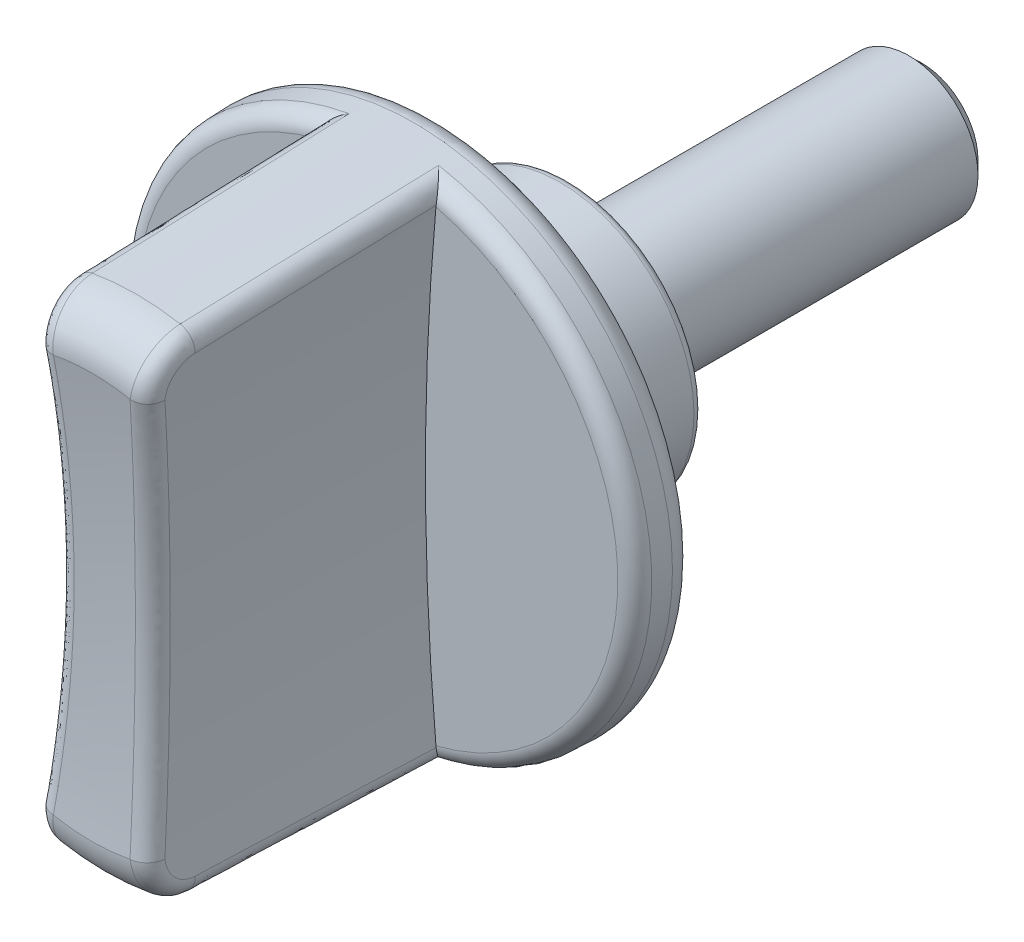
ISO-10303-21;
HEADER;
FILE_DESCRIPTION(('STEP AP214'),'2;1');
FILE_NAME('part.step','',(''),(''),'','','');
FILE_SCHEMA(('AUTOMOTIVE_DESIGN { 1 0 10303 214 1 1 1 1 }'));
ENDSEC;
DATA;
#1=APPLICATION_CONTEXT('core data for automotive mechanical design processes');
#2=APPLICATION_PROTOCOL_DEFINITION('international standard','automotive_design',2000,#1);
#3=PRODUCT_CONTEXT('',#1,'mechanical');
#4=PRODUCT('Part','Part','',(#3));
#5=PRODUCT_RELATED_PRODUCT_CATEGORY('part','',(#4));
#6=PRODUCT_DEFINITION_FORMATION('','',#4);
#7=PRODUCT_DEFINITION_CONTEXT('part definition',#1,'design');
#8=PRODUCT_DEFINITION('design','',#6,#7);
#9=PRODUCT_DEFINITION_SHAPE('','',#8);
#10=(LENGTH_UNIT() NAMED_UNIT(*) SI_UNIT(.MILLI.,.METRE.));
#11=(NAMED_UNIT(*) PLANE_ANGLE_UNIT() SI_UNIT($,.RADIAN.));
#12=(NAMED_UNIT(*) SI_UNIT($,.STERADIAN.) SOLID_ANGLE_UNIT());
#13=UNCERTAINTY_MEASURE_WITH_UNIT(LENGTH_MEASURE(1.E-05),#10,'distance_accuracy_value','');
#14=(GEOMETRIC_REPRESENTATION_CONTEXT(3) GLOBAL_UNCERTAINTY_ASSIGNED_CONTEXT((#13)) GLOBAL_UNIT_ASSIGNED_CONTEXT((#10,
#11,#12)) REPRESENTATION_CONTEXT('',''));
#15=CARTESIAN_POINT('',(0.,0.,0.));
#16=DIRECTION('',(0.,0.,1.));
#17=DIRECTION('',(1.,0.,0.));
#18=AXIS2_PLACEMENT_3D('',#15,#16,#17);
#19=CARTESIAN_POINT('',(0.,0.,9.37986599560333));
#20=DIRECTION('',(0.,0.,-1.));
#21=DIRECTION('',(-1.,0.,0.));
#22=AXIS2_PLACEMENT_3D('',#19,#20,#21);
#23=CONICAL_SURFACE('',#22,14.951814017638,0.0349065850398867);
#24=CARTESIAN_POINT('',(0.,0.,10.5348994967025));
#25=DIRECTION('',(0.,0.,-1.));
#26=DIRECTION('',(-1.,0.,0.));
#27=AXIS2_PLACEMENT_3D('',#24,#25,#26);
#28=CIRCLE('',#27,14.9114793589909);
#29=CARTESIAN_POINT('',(-2.58532278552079,-14.6856502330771,10.5348994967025));
#30=VERTEX_POINT('',#29);
#31=CARTESIAN_POINT('',(-2.58532278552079,14.6856502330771,10.5348994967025));
#32=VERTEX_POINT('',#31);
#33=EDGE_CURVE('E148',#30,#32,#28,.T.);
#34=ORIENTED_EDGE('',*,*,#33,.T.);
#35=CARTESIAN_POINT('',(-2.47226549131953,13.25972440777,51.2913866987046));
#36=CARTESIAN_POINT('',(-3.35907520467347,13.0944948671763,51.2881365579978));
#37=CARTESIAN_POINT('',(-3.28577574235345,12.1959580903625,51.2564872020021));
#38=CARTESIAN_POINT('',(-2.48334722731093,13.4107895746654,46.9805587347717));
#39=CARTESIAN_POINT('',(-3.37237798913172,13.2464409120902,46.9730443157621));
#40=CARTESIAN_POINT('',(-3.29799904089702,12.345796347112,46.9456592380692));
#41=CARTESIAN_POINT('',(-2.49471292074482,13.5617705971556,42.6697289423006));
#42=CARTESIAN_POINT('',(-3.38588966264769,13.3981050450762,42.6624615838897));
#43=CARTESIAN_POINT('',(-3.31044334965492,12.4955646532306,42.6348294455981));
#44=CARTESIAN_POINT('',(-2.51800094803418,13.863577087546,34.0480661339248));
#45=CARTESIAN_POINT('',(-3.41335840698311,13.7012205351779,34.0408916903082));
#46=CARTESIAN_POINT('',(-3.33577398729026,12.7949708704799,34.0131666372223));
#47=CARTESIAN_POINT('',(-2.52992328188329,14.014402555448,29.7372331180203));
#48=CARTESIAN_POINT('',(-3.42731499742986,13.8526566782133,29.7303247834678));
#49=CARTESIAN_POINT('',(-3.34866031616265,12.9446087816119,29.7023336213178));
#50=CARTESIAN_POINT('',(-2.55431331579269,14.3159106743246,21.1155641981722));
#51=CARTESIAN_POINT('',(-3.45567362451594,14.1553354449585,21.1087689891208));
#52=CARTESIAN_POINT('',(-3.37487499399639,13.2437637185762,21.0806647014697));
#53=CARTESIAN_POINT('',(-2.56678101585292,14.4665933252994,16.8047282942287));
#54=CARTESIAN_POINT('',(-3.4700752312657,14.3065643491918,16.7981599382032));
#55=CARTESIAN_POINT('',(-3.38820334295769,13.3932807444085,16.7698287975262));
#56=CARTESIAN_POINT('',(-2.59225257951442,14.767825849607,8.18305386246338));
#57=CARTESIAN_POINT('',(-3.4993237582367,14.6088404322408,8.17660813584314));
#58=CARTESIAN_POINT('',(-3.4153020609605,13.6922014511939,8.14815436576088));
#59=CARTESIAN_POINT('',(-2.60525644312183,14.9183757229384,3.87221533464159));
#60=CARTESIAN_POINT('',(-3.51417028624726,14.7598751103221,3.8660121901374));
#61=CARTESIAN_POINT('',(-3.42907243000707,13.8416051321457,3.83731583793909));
#62=CARTESIAN_POINT('',(-2.61852378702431,15.0688642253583,-0.438624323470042));
#63=CARTESIAN_POINT('',(-3.5292268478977,14.9107009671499,-0.441164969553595));
#64=CARTESIAN_POINT('',(-3.4430638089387,13.9909559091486,-0.473523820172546));
#65=(BOUNDED_SURFACE() B_SPLINE_SURFACE(3,2,((#35,#36,#37),(#38,#39,#40),(#41,#42,#43),(#44,#45,
#46),(#47,#48,#49),(#50,#51,#52),(#53,#54,#55),(#56,#57,#58),(#59,#60,#61),(#62,#63,#64)),
.UNSPECIFIED.,.F.,.F.,.F.) B_SPLINE_SURFACE_WITH_KNOTS((4,2,2,2,4),(3,3),(0.,12.9404508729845,
25.8809015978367,38.8213523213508,51.761803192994),(0.,1.),
.UNSPECIFIED.) GEOMETRIC_REPRESENTATION_ITEM() RATIONAL_B_SPLINE_SURFACE(((1.,0.742526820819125,
1.),(1.,0.741774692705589,1.),(1.,0.741042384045,1.),(1.,0.73961385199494,1.),(1.,
0.738917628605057,1.),(1.,0.737557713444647,1.),(1.,0.736894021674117,1.),(1.,0.735596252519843,
1.),(1.,0.734962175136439,1.),(1.,0.734341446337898,1.))) REPRESENTATION_ITEM('') SURFACE());
#66=CARTESIAN_POINT('',(-2.61852378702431,15.0688642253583,-0.438624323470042));
#67=CARTESIAN_POINT('',(-2.60525644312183,14.9183757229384,3.8722153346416));
#68=CARTESIAN_POINT('',(-2.59225257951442,14.767825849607,8.18305386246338));
#69=CARTESIAN_POINT('',(-2.56678101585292,14.4665933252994,16.8047282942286));
#70=CARTESIAN_POINT('',(-2.55431331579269,14.3159106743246,21.1155641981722));
#71=CARTESIAN_POINT('',(-2.52992328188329,14.0144025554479,29.7372331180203));
#72=CARTESIAN_POINT('',(-2.51800094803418,13.863577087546,34.0480661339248));
#73=CARTESIAN_POINT('',(-2.49471292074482,13.5617705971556,42.6697289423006));
#74=CARTESIAN_POINT('',(-2.48334722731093,13.4107895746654,46.9805587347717));
#75=CARTESIAN_POINT('',(-2.47226549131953,13.25972440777,51.2913866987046));
#76=B_SPLINE_CURVE_WITH_KNOTS('',3,(#66,#67,#68,#69,#70,#71,#72,#73,#74,#75),.UNSPECIFIED.,.F.,
.F.,(4,2,2,2,4),(0.,12.9404508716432,25.8809015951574,38.8213523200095,51.761803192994),.UNSPECIFIED.);
#77=CARTESIAN_POINT('',(-2.54211829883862,14.1651566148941,25.4263986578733));
#78=VERTEX_POINT('',#77);
#79=EDGE_CURVE('E626',#32,#78,#76,.T.);
#80=ORIENTED_EDGE('',*,*,#79,.T.);
#81=CARTESIAN_POINT('',(0.,0.,25.4263986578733));
#82=DIRECTION('',(0.,0.,1.));
#83=DIRECTION('',(1.,0.,0.));
#84=AXIS2_PLACEMENT_3D('',#81,#82,#83);
#85=CIRCLE('',#84,14.3914567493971);
#86=CARTESIAN_POINT('',(2.54211829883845,14.1651566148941,25.4263986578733));
#87=VERTEX_POINT('',#86);
#88=EDGE_CURVE('E165',#87,#78,#85,.T.);
#89=ORIENTED_EDGE('',*,*,#88,.F.);
#90=CARTESIAN_POINT('',(3.28577574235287,12.1959580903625,51.2564872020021));
#91=CARTESIAN_POINT('',(3.35907520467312,13.0944948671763,51.2881365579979));
#92=CARTESIAN_POINT('',(2.47226549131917,13.25972440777,51.2913866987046));
#93=CARTESIAN_POINT('',(3.29799904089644,12.345796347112,46.9456592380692));
#94=CARTESIAN_POINT('',(3.37237798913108,13.2464409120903,46.9730443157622));
#95=CARTESIAN_POINT('',(2.48334722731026,13.4107895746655,46.9805587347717));
#96=CARTESIAN_POINT('',(3.31044334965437,12.4955646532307,42.6348294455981));
#97=CARTESIAN_POINT('',(3.38588966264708,13.3981050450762,42.6624615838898));
#98=CARTESIAN_POINT('',(2.49471292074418,13.5617705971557,42.6697289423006));
#99=CARTESIAN_POINT('',(3.3357739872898,12.7949708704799,34.0131666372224));
#100=CARTESIAN_POINT('',(3.41335840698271,13.701220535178,34.0408916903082));
#101=CARTESIAN_POINT('',(2.51800094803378,13.863577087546,34.0480661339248));
#102=CARTESIAN_POINT('',(3.34866031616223,12.9446087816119,29.7023336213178));
#103=CARTESIAN_POINT('',(3.42731499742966,13.8526566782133,29.7303247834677));
#104=CARTESIAN_POINT('',(2.52992328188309,14.0144025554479,29.7372331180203));
#105=CARTESIAN_POINT('',(3.37487499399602,13.2437637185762,21.0806647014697));
#106=CARTESIAN_POINT('',(3.4556736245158,14.1553354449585,21.1087689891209));
#107=CARTESIAN_POINT('',(2.55431331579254,14.3159106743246,21.1155641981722));
#108=CARTESIAN_POINT('',(3.38820334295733,13.3932807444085,16.7698287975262));
#109=CARTESIAN_POINT('',(3.47007523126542,14.3065643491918,16.7981599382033));
#110=CARTESIAN_POINT('',(2.56678101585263,14.4665933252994,16.8047282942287));
#111=CARTESIAN_POINT('',(3.41530206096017,13.6922014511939,8.14815436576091));
#112=CARTESIAN_POINT('',(3.4993237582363,14.6088404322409,8.17660813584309));
#113=CARTESIAN_POINT('',(2.592252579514,14.7678258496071,8.18305386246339));
#114=CARTESIAN_POINT('',(3.42907243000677,13.8416051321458,3.83731583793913));
#115=CARTESIAN_POINT('',(3.51417028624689,14.7598751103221,3.86601219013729));
#116=CARTESIAN_POINT('',(2.60525644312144,14.9183757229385,3.87221533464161));
#117=CARTESIAN_POINT('',(3.44306380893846,13.9909559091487,-0.473523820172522));
#118=CARTESIAN_POINT('',(3.52922684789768,14.9107009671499,-0.441164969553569));
#119=CARTESIAN_POINT('',(2.61852378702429,15.0688642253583,-0.438624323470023));
#120=(BOUNDED_SURFACE() B_SPLINE_SURFACE(3,2,((#90,#91,#92),(#93,#94,#95),(#96,#97,#98),(#99,
#100,#101),(#102,#103,#104),(#105,#106,#107),(#108,#109,#110),(#111,#112,#113),(#114,#115,#116),
(#117,#118,#119)),.UNSPECIFIED.,.F.,.F.,.F.) B_SPLINE_SURFACE_WITH_KNOTS((4,2,2,2,4),(3,3),(0.,
12.9404508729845,25.8809015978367,38.8213523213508,51.761803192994),(0.,1.),
.UNSPECIFIED.) GEOMETRIC_REPRESENTATION_ITEM() RATIONAL_B_SPLINE_SURFACE(((1.,0.742526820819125,
1.),(1.,0.74177469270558,1.),(1.,0.741042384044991,1.),(1.,0.739613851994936,1.),(1.,
0.738917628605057,1.),(1.,0.737557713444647,1.),(1.,0.736894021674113,1.),(1.,0.735596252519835,
1.),(1.,0.73496217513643,1.),(1.,0.734341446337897,1.))) REPRESENTATION_ITEM('') SURFACE());
#121=CARTESIAN_POINT('',(2.47226549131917,13.25972440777,51.2913866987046));
#122=CARTESIAN_POINT('',(2.48334722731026,13.4107895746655,46.9805587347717));
#123=CARTESIAN_POINT('',(2.49471292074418,13.5617705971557,42.6697289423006));
#124=CARTESIAN_POINT('',(2.51800094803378,13.863577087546,34.0480661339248));
#125=CARTESIAN_POINT('',(2.52992328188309,14.0144025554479,29.7372331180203));
#126=CARTESIAN_POINT('',(2.55431331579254,14.3159106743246,21.1155641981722));
#127=CARTESIAN_POINT('',(2.56678101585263,14.4665933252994,16.8047282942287));
#128=CARTESIAN_POINT('',(2.592252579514,14.7678258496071,8.18305386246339));
#129=CARTESIAN_POINT('',(2.60525644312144,14.9183757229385,3.87221533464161));
#130=CARTESIAN_POINT('',(2.61852378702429,15.0688642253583,-0.438624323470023));
#131=B_SPLINE_CURVE_WITH_KNOTS('',3,(#121,#122,#123,#124,#125,#126,#127,#128,#129,#130),
.UNSPECIFIED.,.F.,.F.,(4,2,2,2,4),(0.,12.9404508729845,25.8809015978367,38.8213523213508,
51.761803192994),.UNSPECIFIED.);
#132=CARTESIAN_POINT('',(2.58532278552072,14.6856502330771,10.5348994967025));
#133=VERTEX_POINT('',#132);
#134=EDGE_CURVE('E149',#87,#133,#131,.T.);
#135=ORIENTED_EDGE('',*,*,#134,.T.);
#136=CARTESIAN_POINT('',(0.,0.,10.5348994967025));
#137=DIRECTION('',(0.,0.,-1.));
#138=DIRECTION('',(-1.,0.,0.));
#139=AXIS2_PLACEMENT_3D('',#136,#137,#138);
#140=CIRCLE('',#139,14.9114793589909);
#141=CARTESIAN_POINT('',(2.58532278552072,-14.6856502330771,10.5348994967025));
#142=VERTEX_POINT('',#141);
#143=EDGE_CURVE('E356',#133,#142,#140,.T.);
#144=ORIENTED_EDGE('',*,*,#143,.T.);
#145=CARTESIAN_POINT('',(2.47226549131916,-13.25972440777,51.2913866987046));
#146=CARTESIAN_POINT('',(3.35907520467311,-13.0944948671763,51.2881365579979));
#147=CARTESIAN_POINT('',(3.28577574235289,-12.1959580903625,51.2564872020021));
#148=CARTESIAN_POINT('',(2.48334722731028,-13.4107895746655,46.9805587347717));
#149=CARTESIAN_POINT('',(3.37237798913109,-13.2464409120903,46.9730443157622));
#150=CARTESIAN_POINT('',(3.29799904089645,-12.345796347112,46.9456592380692));
#151=CARTESIAN_POINT('',(2.4947129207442,-13.5617705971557,42.6697289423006));
#152=CARTESIAN_POINT('',(3.3858896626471,-13.3981050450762,42.6624615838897));
#153=CARTESIAN_POINT('',(3.31044334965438,-12.4955646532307,42.6348294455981));
#154=CARTESIAN_POINT('',(2.51800094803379,-13.863577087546,34.0480661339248));
#155=CARTESIAN_POINT('',(3.41335840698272,-13.701220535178,34.0408916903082));
#156=CARTESIAN_POINT('',(3.33577398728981,-12.7949708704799,34.0131666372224));
#157=CARTESIAN_POINT('',(2.52992328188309,-14.014402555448,29.7372331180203));
#158=CARTESIAN_POINT('',(3.42731499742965,-13.8526566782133,29.7303247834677));
#159=CARTESIAN_POINT('',(3.34866031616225,-12.9446087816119,29.7023336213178));
#160=CARTESIAN_POINT('',(2.55431331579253,-14.3159106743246,21.1155641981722));
#161=CARTESIAN_POINT('',(3.45567362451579,-14.1553354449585,21.1087689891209));
#162=CARTESIAN_POINT('',(3.37487499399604,-13.2437637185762,21.0806647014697));
#163=CARTESIAN_POINT('',(2.56678101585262,-14.4665933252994,16.8047282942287));
#164=CARTESIAN_POINT('',(3.47007523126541,-14.3065643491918,16.7981599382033));
#165=CARTESIAN_POINT('',(3.38820334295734,-13.3932807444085,16.7698287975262));
#166=CARTESIAN_POINT('',(2.59225257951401,-14.7678258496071,8.18305386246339));
#167=CARTESIAN_POINT('',(3.49932375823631,-14.6088404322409,8.1766081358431));
#168=CARTESIAN_POINT('',(3.41530206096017,-13.6922014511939,8.14815436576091));
#169=CARTESIAN_POINT('',(2.60525644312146,-14.9183757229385,3.87221533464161));
#170=CARTESIAN_POINT('',(3.51417028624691,-14.7598751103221,3.86601219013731));
#171=CARTESIAN_POINT('',(3.42907243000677,-13.8416051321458,3.83731583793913));
#172=CARTESIAN_POINT('',(2.61852378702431,-15.0688642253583,-0.438624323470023));
#173=CARTESIAN_POINT('',(3.5292268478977,-14.9107009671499,-0.441164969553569));
#174=CARTESIAN_POINT('',(3.44306380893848,-13.9909559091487,-0.473523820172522));
#175=(BOUNDED_SURFACE() B_SPLINE_SURFACE(3,2,((#145,#146,#147),(#148,#149,#150),(#151,#152,
#153),(#154,#155,#156),(#157,#158,#159),(#160,#161,#162),(#163,#164,#165),(#166,#167,#168),
(#169,#170,#171),(#172,#173,#174)),.UNSPECIFIED.,.F.,.F.,.F.) B_SPLINE_SURFACE_WITH_KNOTS((4,2,
2,2,4),(3,3),(0.,12.9404508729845,25.8809015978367,38.8213523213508,51.761803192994),(0.,1.),
.UNSPECIFIED.) GEOMETRIC_REPRESENTATION_ITEM() RATIONAL_B_SPLINE_SURFACE(((1.,0.742526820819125,
1.),(1.,0.741774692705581,1.),(1.,0.741042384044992,1.),(1.,0.739613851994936,1.),(1.,
0.738917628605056,1.),(1.,0.737557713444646,1.),(1.,0.736894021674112,1.),(1.,0.735596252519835,
1.),(1.,0.734962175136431,1.),(1.,0.734341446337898,1.))) REPRESENTATION_ITEM('') SURFACE());
#176=CARTESIAN_POINT('',(2.61852378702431,-15.0688642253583,-0.438624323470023));
#177=CARTESIAN_POINT('',(2.60525644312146,-14.9183757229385,3.87221533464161));
#178=CARTESIAN_POINT('',(2.59225257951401,-14.7678258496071,8.18305386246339));
#179=CARTESIAN_POINT('',(2.56678101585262,-14.4665933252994,16.8047282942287));
#180=CARTESIAN_POINT('',(2.55431331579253,-14.3159106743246,21.1155641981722));
#181=CARTESIAN_POINT('',(2.52992328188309,-14.014402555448,29.7372331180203));
#182=CARTESIAN_POINT('',(2.51800094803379,-13.863577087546,34.0480661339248));
#183=CARTESIAN_POINT('',(2.4947129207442,-13.5617705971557,42.6697289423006));
#184=CARTESIAN_POINT('',(2.48334722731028,-13.4107895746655,46.9805587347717));
#185=CARTESIAN_POINT('',(2.47226549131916,-13.25972440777,51.2913866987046));
#186=B_SPLINE_CURVE_WITH_KNOTS('',3,(#176,#177,#178,#179,#180,#181,#182,#183,#184,#185),
.UNSPECIFIED.,.F.,.F.,(4,2,2,2,4),(0.,12.9404508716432,25.8809015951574,38.8213523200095,
51.761803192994),.UNSPECIFIED.);
#187=CARTESIAN_POINT('',(2.54211829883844,-14.1651566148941,25.4263986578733));
#188=VERTEX_POINT('',#187);
#189=EDGE_CURVE('E164',#142,#188,#186,.T.);
#190=ORIENTED_EDGE('',*,*,#189,.T.);
#191=CARTESIAN_POINT('',(-2.54211829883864,-14.1651566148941,25.4263986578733));
#192=VERTEX_POINT('',#191);
#193=EDGE_CURVE('E154',#192,#188,#85,.T.);
#194=ORIENTED_EDGE('',*,*,#193,.F.);
#195=CARTESIAN_POINT('',(-3.28577574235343,-12.1959580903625,51.2564872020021));
#196=CARTESIAN_POINT('',(-3.35907520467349,-13.0944948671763,51.2881365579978));
#197=CARTESIAN_POINT('',(-2.47226549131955,-13.25972440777,51.2913866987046));
#198=CARTESIAN_POINT('',(-3.29799904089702,-12.345796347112,46.9456592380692));
#199=CARTESIAN_POINT('',(-3.37237798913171,-13.2464409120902,46.9730443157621));
#200=CARTESIAN_POINT('',(-2.48334722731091,-13.4107895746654,46.9805587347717));
#201=CARTESIAN_POINT('',(-3.31044334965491,-12.4955646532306,42.6348294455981));
#202=CARTESIAN_POINT('',(-3.38588966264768,-13.3981050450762,42.6624615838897));
#203=CARTESIAN_POINT('',(-2.4947129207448,-13.5617705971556,42.6697289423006));
#204=CARTESIAN_POINT('',(-3.33577398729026,-12.7949708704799,34.0131666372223));
#205=CARTESIAN_POINT('',(-3.41335840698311,-13.7012205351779,34.0408916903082));
#206=CARTESIAN_POINT('',(-2.51800094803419,-13.863577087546,34.0480661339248));
#207=CARTESIAN_POINT('',(-3.34866031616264,-12.9446087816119,29.7023336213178));
#208=CARTESIAN_POINT('',(-3.42731499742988,-13.8526566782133,29.7303247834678));
#209=CARTESIAN_POINT('',(-2.52992328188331,-14.0144025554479,29.7372331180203));
#210=CARTESIAN_POINT('',(-3.37487499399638,-13.2437637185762,21.0806647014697));
#211=CARTESIAN_POINT('',(-3.45567362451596,-14.1553354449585,21.1087689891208));
#212=CARTESIAN_POINT('',(-2.5543133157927,-14.3159106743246,21.1155641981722));
#213=CARTESIAN_POINT('',(-3.38820334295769,-13.3932807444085,16.7698287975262));
#214=CARTESIAN_POINT('',(-3.47007523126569,-14.3065643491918,16.7981599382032));
#215=CARTESIAN_POINT('',(-2.56678101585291,-14.4665933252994,16.8047282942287));
#216=CARTESIAN_POINT('',(-3.41530206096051,-13.6922014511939,8.14815436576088));
#217=CARTESIAN_POINT('',(-3.49932375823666,-14.6088404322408,8.17660813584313));
#218=CARTESIAN_POINT('',(-2.59225257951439,-14.767825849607,8.18305386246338));
#219=CARTESIAN_POINT('',(-3.42907243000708,-13.8416051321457,3.83731583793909));
#220=CARTESIAN_POINT('',(-3.51417028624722,-14.7598751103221,3.86601219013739));
#221=CARTESIAN_POINT('',(-2.60525644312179,-14.9183757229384,3.87221533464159));
#222=CARTESIAN_POINT('',(-3.44306380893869,-13.9909559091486,-0.473523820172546));
#223=CARTESIAN_POINT('',(-3.52922684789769,-14.9107009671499,-0.441164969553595));
#224=CARTESIAN_POINT('',(-2.6185237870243,-15.0688642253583,-0.438624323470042));
#225=(BOUNDED_SURFACE() B_SPLINE_SURFACE(3,2,((#195,#196,#197),(#198,#199,#200),(#201,#202,
#203),(#204,#205,#206),(#207,#208,#209),(#210,#211,#212),(#213,#214,#215),(#216,#217,#218),
(#219,#220,#221),(#222,#223,#224)),.UNSPECIFIED.,.F.,.F.,.F.) B_SPLINE_SURFACE_WITH_KNOTS((4,2,
2,2,4),(3,3),(0.,12.9404508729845,25.8809015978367,38.8213523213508,51.761803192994),(0.,1.),
.UNSPECIFIED.) GEOMETRIC_REPRESENTATION_ITEM() RATIONAL_B_SPLINE_SURFACE(((1.,0.742526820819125,
1.),(1.,0.741774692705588,1.),(1.,0.741042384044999,1.),(1.,0.73961385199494,1.),(1.,
0.738917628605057,1.),(1.,0.737557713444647,1.),(1.,0.736894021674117,1.),(1.,0.735596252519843,
1.),(1.,0.734962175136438,1.),(1.,0.734341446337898,1.))) REPRESENTATION_ITEM('') SURFACE());
#226=CARTESIAN_POINT('',(-2.47226549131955,-13.25972440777,51.2913866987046));
#227=CARTESIAN_POINT('',(-2.48334722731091,-13.4107895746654,46.9805587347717));
#228=CARTESIAN_POINT('',(-2.4947129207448,-13.5617705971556,42.6697289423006));
#229=CARTESIAN_POINT('',(-2.51800094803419,-13.863577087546,34.0480661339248));
#230=CARTESIAN_POINT('',(-2.52992328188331,-14.0144025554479,29.7372331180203));
#231=CARTESIAN_POINT('',(-2.5543133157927,-14.3159106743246,21.1155641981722));
#232=CARTESIAN_POINT('',(-2.56678101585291,-14.4665933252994,16.8047282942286));
#233=CARTESIAN_POINT('',(-2.59225257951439,-14.767825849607,8.18305386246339));
#234=CARTESIAN_POINT('',(-2.60525644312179,-14.9183757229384,3.8722153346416));
#235=CARTESIAN_POINT('',(-2.6185237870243,-15.0688642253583,-0.438624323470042));
#236=B_SPLINE_CURVE_WITH_KNOTS('',3,(#226,#227,#228,#229,#230,#231,#232,#233,#234,#235),
.UNSPECIFIED.,.F.,.F.,(4,2,2,2,4),(0.,12.9404508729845,25.8809015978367,38.8213523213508,
51.761803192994),.UNSPECIFIED.);
#237=EDGE_CURVE('E141',#192,#30,#236,.T.);
#238=ORIENTED_EDGE('',*,*,#237,.T.);
#239=EDGE_LOOP('',(#34,#80,#89,#135,#144,#190,#194,#238));
#240=FACE_BOUND('',#239,.T.);
#241=CARTESIAN_POINT('',(0.,0.,9.37986599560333));
#242=DIRECTION('',(0.,0.,1.));
#243=DIRECTION('',(1.,0.,0.));
#244=AXIS2_PLACEMENT_3D('',#241,#242,#243);
#245=CIRCLE('',#244,14.951814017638);
#246=CARTESIAN_POINT('',(14.951814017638,0.,9.37986599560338));
#247=VERTEX_POINT('',#246);
#248=EDGE_CURVE('E169',#247,#247,#245,.T.);
#249=ORIENTED_EDGE('',*,*,#248,.T.);
#250=EDGE_LOOP('',(#249));
#251=FACE_BOUND('',#250,.T.);
#252=ADVANCED_FACE('F14',(#240,#251),#23,.T.);
#253=CARTESIAN_POINT('',(0.,0.,25.3333333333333));
#254=DIRECTION('',(0.,0.,1.));
#255=DIRECTION('',(1.,0.,0.));
#256=AXIS2_PLACEMENT_3D('',#253,#254,#255);
#257=TOROIDAL_SURFACE('',#256,11.7264145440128,2.66666666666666);
#258=CARTESIAN_POINT('',(-5.09660929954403,26.2090390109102,30.2386060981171));
#259=CARTESIAN_POINT('',(-5.04566440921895,25.9219556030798,31.1887265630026));
#260=CARTESIAN_POINT('',(-4.06680563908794,26.0938344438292,31.1945861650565));
#261=CARTESIAN_POINT('',(-4.90775050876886,25.144919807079,29.9047265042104));
#262=CARTESIAN_POINT('',(-4.86064558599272,24.8673892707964,30.8601550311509));
#263=CARTESIAN_POINT('',(-3.87877699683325,25.0343926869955,30.8643755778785));
#264=CARTESIAN_POINT('',(-4.72935205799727,24.0726340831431,29.5912097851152));
#265=CARTESIAN_POINT('',(-4.68612565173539,23.8061708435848,30.5520515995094));
#266=CARTESIAN_POINT('',(-3.7011627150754,23.9668203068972,30.5543040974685));
#267=CARTESIAN_POINT('',(-4.39445096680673,21.9135860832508,29.005414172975));
#268=CARTESIAN_POINT('',(-4.35848164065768,21.6694836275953,29.9763070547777));
#269=CARTESIAN_POINT('',(-3.36773371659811,21.8172626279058,29.9749457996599));
#270=CARTESIAN_POINT('',(-4.23794909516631,20.8268233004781,28.7331367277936));
#271=CARTESIAN_POINT('',(-4.20543787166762,20.5942444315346,29.7088125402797));
#272=CARTESIAN_POINT('',(-3.21191976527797,20.7352768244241,29.7056604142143));
#273=CARTESIAN_POINT('',(-3.9478166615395,18.640654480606,28.2303326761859));
#274=CARTESIAN_POINT('',(-3.92168140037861,18.4313042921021,29.2147619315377));
#275=CARTESIAN_POINT('',(-2.92306263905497,18.558717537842,29.2083816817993));
#276=CARTESIAN_POINT('',(-3.81418815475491,17.5412473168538,27.9998098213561));
#277=CARTESIAN_POINT('',(-3.79104328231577,17.3438567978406,28.9883392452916));
#278=CARTESIAN_POINT('',(-2.79002151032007,17.464142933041,28.9803920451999));
#279=CARTESIAN_POINT('',(-3.57063498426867,15.3320182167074,27.5809917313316));
#280=CARTESIAN_POINT('',(-3.5529068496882,15.1586323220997,28.5769010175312));
#281=CARTESIAN_POINT('',(-2.5475389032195,15.2646247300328,28.5661763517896));
#282=CARTESIAN_POINT('',(-3.46070990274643,14.2221964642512,27.3926957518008));
#283=CARTESIAN_POINT('',(-3.44547160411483,14.0611311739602,28.3919963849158));
#284=CARTESIAN_POINT('',(-2.43809700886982,14.1596813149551,28.3799495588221));
#285=CARTESIAN_POINT('',(-3.17324072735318,10.9448663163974,26.9014345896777));
#286=CARTESIAN_POINT('',(-3.16430251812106,10.8183834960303,27.9092094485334));
#287=CARTESIAN_POINT('',(-2.15189143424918,10.896757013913,27.8940868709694));
#288=CARTESIAN_POINT('',(-3.02946496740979,8.765254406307,26.6574036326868));
#289=CARTESIAN_POINT('',(-3.02394203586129,8.66439004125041,27.6698295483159));
#290=CARTESIAN_POINT('',(-2.00874765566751,8.72672581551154,27.6527375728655));
#291=CARTESIAN_POINT('',(-2.83742503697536,4.39042701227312,26.3318875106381));
#292=CARTESIAN_POINT('',(-2.83626907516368,4.33910628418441,27.3501807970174));
#293=CARTESIAN_POINT('',(-1.81755185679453,4.37112843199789,27.3307985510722));
#294=CARTESIAN_POINT('',(-2.78914896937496,2.19521350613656,26.2503820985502));
#295=CARTESIAN_POINT('',(-2.78914896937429,2.17015132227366,27.2702402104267));
#296=CARTESIAN_POINT('',(-1.76948799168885,2.18556421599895,27.2501888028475));
#297=CARTESIAN_POINT('',(-2.78914896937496,-2.19521350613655,26.2503820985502));
#298=CARTESIAN_POINT('',(-2.78914896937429,-2.17015132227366,27.2702402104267));
#299=CARTESIAN_POINT('',(-1.76948799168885,-2.18556421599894,27.2501888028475));
#300=CARTESIAN_POINT('',(-2.83742503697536,-4.39042701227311,26.3318875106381));
#301=CARTESIAN_POINT('',(-2.83626907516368,-4.33910628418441,27.3501807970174));
#302=CARTESIAN_POINT('',(-1.81755185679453,-4.37112843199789,27.3307985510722));
#303=CARTESIAN_POINT('',(-3.02946496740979,-8.765254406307,26.6574036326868));
#304=CARTESIAN_POINT('',(-3.02394203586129,-8.66439004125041,27.6698295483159));
#305=CARTESIAN_POINT('',(-2.00874765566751,-8.72672581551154,27.6527375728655));
#306=CARTESIAN_POINT('',(-3.17324072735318,-10.9448663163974,26.9014345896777));
#307=CARTESIAN_POINT('',(-3.16430251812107,-10.8183834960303,27.9092094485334));
#308=CARTESIAN_POINT('',(-2.15189143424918,-10.896757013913,27.8940868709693));
#309=CARTESIAN_POINT('',(-3.46070990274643,-14.2221964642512,27.3926957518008));
#310=CARTESIAN_POINT('',(-3.44547160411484,-14.0611311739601,28.3919963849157));
#311=CARTESIAN_POINT('',(-2.43809700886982,-14.1596813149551,28.3799495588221));
#312=CARTESIAN_POINT('',(-3.57063498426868,-15.3320182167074,27.5809917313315));
#313=CARTESIAN_POINT('',(-3.55290684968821,-15.1586323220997,28.5769010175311));
#314=CARTESIAN_POINT('',(-2.5475389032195,-15.2646247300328,28.5661763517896));
#315=CARTESIAN_POINT('',(-3.81418815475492,-17.5412473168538,27.9998098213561));
#316=CARTESIAN_POINT('',(-3.79104328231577,-17.3438567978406,28.9883392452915));
#317=CARTESIAN_POINT('',(-2.79002151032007,-17.464142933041,28.9803920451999));
#318=CARTESIAN_POINT('',(-3.94781666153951,-18.640654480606,28.2303326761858));
#319=CARTESIAN_POINT('',(-3.9216814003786,-18.4313042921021,29.2147619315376));
#320=CARTESIAN_POINT('',(-2.92306263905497,-18.558717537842,29.2083816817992));
#321=CARTESIAN_POINT('',(-4.23794909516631,-20.8268233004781,28.7331367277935));
#322=CARTESIAN_POINT('',(-4.20543787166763,-20.5942444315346,29.7088125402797));
#323=CARTESIAN_POINT('',(-3.21191976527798,-20.7352768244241,29.7056604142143));
#324=CARTESIAN_POINT('',(-4.39445096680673,-21.9135860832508,29.0054141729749));
#325=CARTESIAN_POINT('',(-4.3584816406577,-21.6694836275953,29.9763070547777));
#326=CARTESIAN_POINT('',(-3.36773371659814,-21.8172626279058,29.9749457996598));
#327=CARTESIAN_POINT('',(-4.72935205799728,-24.0726340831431,29.5912097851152));
#328=CARTESIAN_POINT('',(-4.68612565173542,-23.8061708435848,30.5520515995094));
#329=CARTESIAN_POINT('',(-3.70116271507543,-23.9668203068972,30.5543040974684));
#330=CARTESIAN_POINT('',(-4.90775050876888,-25.144919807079,29.9047265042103));
#331=CARTESIAN_POINT('',(-4.86064558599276,-24.8673892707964,30.8601550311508));
#332=CARTESIAN_POINT('',(-3.87877699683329,-25.0343926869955,30.8643755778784));
#333=CARTESIAN_POINT('',(-5.09660929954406,-26.2090390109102,30.238606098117));
#334=CARTESIAN_POINT('',(-5.04566440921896,-25.9219556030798,31.1887265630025));
#335=CARTESIAN_POINT('',(-4.06680563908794,-26.0938344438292,31.1945861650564));
#336=(BOUNDED_SURFACE() B_SPLINE_SURFACE(3,2,((#258,#259,#260),(#261,#262,#263),(#264,#265,
#266),(#267,#268,#269),(#270,#271,#272),(#273,#274,#275),(#276,#277,#278),(#279,#280,#281),
(#282,#283,#284),(#285,#286,#287),(#288,#289,#290),(#291,#292,#293),(#294,#295,#296),(#297,#298,
#299),(#300,#301,#302),(#303,#304,#305),(#306,#307,#308),(#309,#310,#311),(#312,#313,#314),
(#315,#316,#317),(#318,#319,#320),(#321,#322,#323),(#324,#325,#326),(#327,#328,#329),(#330,#331,
#332),(#333,#334,#335)),.UNSPECIFIED.,.F.,.F.,.F.) B_SPLINE_SURFACE_WITH_KNOTS((4,2,2,2,2,2,2,2,
2,2,2,2,4),(3,3),(0.,3.41384072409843,6.82780127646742,10.2420684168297,13.6562753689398,
20.2847522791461,26.9124033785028,33.5400544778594,40.1685313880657,43.5827383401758,
46.9970054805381,50.4109660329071,53.8248067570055),(0.,1.),
.UNSPECIFIED.) GEOMETRIC_REPRESENTATION_ITEM() RATIONAL_B_SPLINE_SURFACE(((1.,0.709283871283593,
1.),(1.,0.708538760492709,1.),(1.,0.707833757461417,1.),(1.,0.706508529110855,1.),(1.,
0.705888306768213,1.),(1.,0.704737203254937,1.),(1.,0.704206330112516,1.),(1.,0.703237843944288,
1.),(1.,0.702800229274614,1.),(1.,0.701654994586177,1.),(1.,0.701081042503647,1.),(1.,
0.700314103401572,1.),(1.,0.700121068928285,1.),(1.,0.700121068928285,1.),(1.,0.700314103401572,
1.),(1.,0.701081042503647,1.),(1.,0.701654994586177,1.),(1.,0.702800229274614,1.),(1.,
0.703237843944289,1.),(1.,0.704206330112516,1.),(1.,0.704737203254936,1.),(1.,0.705888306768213,
1.),(1.,0.706508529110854,1.),(1.,0.707833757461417,1.),(1.,0.70853876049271,1.),(1.,
0.709283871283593,1.))) REPRESENTATION_ITEM('') SURFACE());
#337=CARTESIAN_POINT('',(-2.21412295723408,-11.5154877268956,28.));
#338=CARTESIAN_POINT('',(-2.21653634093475,-11.5149537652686,28.0000000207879));
#339=CARTESIAN_POINT('',(-2.21896356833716,-11.5145229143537,28.00000002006));
#340=CARTESIAN_POINT('',(-2.2238457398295,-11.5138674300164,27.9999999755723));
#341=CARTESIAN_POINT('',(-2.22630068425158,-11.513642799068,27.9999999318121));
#342=CARTESIAN_POINT('',(-2.22876947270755,-11.5135212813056,27.9999998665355));
#343=B_SPLINE_CURVE_WITH_KNOTS('',3,(#337,#338,#339,#340,#341,#342),.UNSPECIFIED.,.F.,.F.,(4,2,
4),(0.,0.007395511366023,0.0147911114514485),.UNSPECIFIED.);
#344=CARTESIAN_POINT('',(-2.21412295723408,-11.5154877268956,28.));
#345=VERTEX_POINT('',#344);
#346=CARTESIAN_POINT('',(-2.22876947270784,-11.5135212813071,27.9999998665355));
#347=VERTEX_POINT('',#346);
#348=EDGE_CURVE('E158',#345,#347,#343,.T.);
#349=ORIENTED_EDGE('',*,*,#348,.T.);
#350=CARTESIAN_POINT('',(-2.53756322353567,-14.1263760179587,24.8697783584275));
#351=CARTESIAN_POINT('',(-3.43812056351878,-13.9671539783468,24.8839842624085));
#352=CARTESIAN_POINT('',(-3.35964859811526,-13.0699815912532,25.0436114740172));
#353=CARTESIAN_POINT('',(-2.53945556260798,-14.1424869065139,24.961485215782));
#354=CARTESIAN_POINT('',(-3.43951590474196,-13.9824035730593,24.9729244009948));
#355=CARTESIAN_POINT('',(-3.36052845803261,-13.0800371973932,25.1009282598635));
#356=CARTESIAN_POINT('',(-2.5407842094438,-14.1537986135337,25.0539897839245));
#357=CARTESIAN_POINT('',(-3.44049634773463,-13.9931090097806,25.0626106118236));
#358=CARTESIAN_POINT('',(-3.36114664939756,-13.0870973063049,25.1587436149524));
#359=CARTESIAN_POINT('',(-2.5423071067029,-14.1667640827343,25.2398323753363));
#360=CARTESIAN_POINT('',(-3.44162036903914,-14.0053770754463,25.2427264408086));
#361=CARTESIAN_POINT('',(-3.36185544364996,-13.0951895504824,25.2748952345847));
#362=CARTESIAN_POINT('',(-2.54249956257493,-14.1684025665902,25.3331714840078));
#363=CARTESIAN_POINT('',(-3.44176288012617,-14.0069280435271,25.3331775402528));
#364=CARTESIAN_POINT('',(-3.36194521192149,-13.0962121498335,25.3332321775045));
#365=CARTESIAN_POINT('',(-2.54150770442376,-14.1599582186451,25.5757021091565));
#366=CARTESIAN_POINT('',(-3.44103017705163,-13.9989373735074,25.5682109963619));
#367=CARTESIAN_POINT('',(-3.36148329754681,-13.0909417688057,25.4848138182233));
#368=CARTESIAN_POINT('',(-2.53942563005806,-14.1422321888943,25.7247184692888));
#369=CARTESIAN_POINT('',(-3.43949073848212,-13.9821569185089,25.7126879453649));
#370=CARTESIAN_POINT('',(-3.36051330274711,-13.0798784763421,25.577949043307));
#371=CARTESIAN_POINT('',(-2.53414691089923,-14.0972902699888,25.9442104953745));
#372=CARTESIAN_POINT('',(-3.43560374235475,-13.9396148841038,25.9256387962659));
#373=CARTESIAN_POINT('',(-3.35806158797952,-13.0518274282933,25.7151315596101));
#374=CARTESIAN_POINT('',(-2.53202637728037,-14.0792364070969,26.0167397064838));
#375=CARTESIAN_POINT('',(-3.43404297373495,-13.9225156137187,25.9960653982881));
#376=CARTESIAN_POINT('',(-3.35707744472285,-13.0405587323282,25.7604623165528));
#377=CARTESIAN_POINT('',(-2.52708065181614,-14.0371295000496,26.1600760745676));
#378=CARTESIAN_POINT('',(-3.43041017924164,-13.8826243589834,26.135353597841));
#379=CARTESIAN_POINT('',(-3.3547861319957,-13.0142759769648,25.8500475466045));
#380=CARTESIAN_POINT('',(-2.52425485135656,-14.013071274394,26.2308816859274));
#381=CARTESIAN_POINT('',(-3.42833717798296,-13.8598215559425,26.2042235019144));
#382=CARTESIAN_POINT('',(-3.35347868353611,-12.9992586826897,25.8943010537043));
#383=CARTESIAN_POINT('',(-2.5147544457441,-13.9321880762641,26.4396972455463));
#384=CARTESIAN_POINT('',(-3.42138196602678,-13.7831022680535,26.4076122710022));
#385=CARTESIAN_POINT('',(-3.34909230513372,-12.9487689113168,26.0248107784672));
#386=CARTESIAN_POINT('',(-2.5070505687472,-13.8666012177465,26.574365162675));
#387=CARTESIAN_POINT('',(-3.41575924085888,-13.7208277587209,26.5390822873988));
#388=CARTESIAN_POINT('',(-3.34554640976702,-12.9078252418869,26.1089782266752));
#389=CARTESIAN_POINT('',(-2.48912622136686,-13.7140289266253,26.8306433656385));
#390=CARTESIAN_POINT('',(-3.40277307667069,-13.5757954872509,26.790105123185));
#391=CARTESIAN_POINT('',(-3.33734947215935,-12.8125680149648,26.2691521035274));
#392=CARTESIAN_POINT('',(-2.47890549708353,-13.6270413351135,26.9522523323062));
#393=CARTESIAN_POINT('',(-3.39540181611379,-13.4929482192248,26.9097150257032));
#394=CARTESIAN_POINT('',(-3.33269831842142,-12.7582531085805,26.3451577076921));
#395=CARTESIAN_POINT('',(-2.45621321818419,-13.433994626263,27.1792653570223));
#396=CARTESIAN_POINT('',(-3.37918280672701,-13.3087642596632,27.1341622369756));
#397=CARTESIAN_POINT('',(-3.32245607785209,-12.6376964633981,26.4870408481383));
#398=CARTESIAN_POINT('',(-2.44373810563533,-13.3279053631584,27.2846433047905));
#399=CARTESIAN_POINT('',(-3.37032328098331,-13.207286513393,27.2390129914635));
#400=CARTESIAN_POINT('',(-3.31686350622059,-12.571435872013,26.5529020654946));
#401=CARTESIAN_POINT('',(-2.41689201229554,-13.0997976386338,27.4760108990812));
#402=CARTESIAN_POINT('',(-3.35145697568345,-12.9885437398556,27.4309753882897));
#403=CARTESIAN_POINT('',(-3.3049471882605,-12.4289388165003,26.6725068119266));
#404=CARTESIAN_POINT('',(-2.40252090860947,-12.9777781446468,27.5619992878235));
#405=CARTESIAN_POINT('',(-3.34143946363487,-12.8711457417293,27.5180952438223));
#406=CARTESIAN_POINT('',(-3.29862339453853,-12.3527017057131,26.7262495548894));
#407=CARTESIAN_POINT('',(-2.37220769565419,-12.7207587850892,27.7125382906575));
#408=CARTESIAN_POINT('',(-3.32055633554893,-12.6230171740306,27.6726466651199));
#409=CARTESIAN_POINT('',(-3.28543778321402,-12.1920815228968,26.8203364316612));
#410=CARTESIAN_POINT('',(-2.356259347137,-12.5857074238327,27.776998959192));
#411=CARTESIAN_POINT('',(-3.30967644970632,-12.4920900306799,27.7399683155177));
#412=CARTESIAN_POINT('',(-3.27857385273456,-12.1076661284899,26.8606243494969));
#413=CARTESIAN_POINT('',(-2.32326712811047,-12.3069063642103,27.8822386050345));
#414=CARTESIAN_POINT('',(-3.28745588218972,-12.2206041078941,27.8526203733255));
#415=CARTESIAN_POINT('',(-3.26455995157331,-11.9333532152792,26.9263991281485));
#416=CARTESIAN_POINT('',(-2.30622327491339,-12.1631568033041,27.923017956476));
#417=CARTESIAN_POINT('',(-3.27610477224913,-12.0798983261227,27.8978845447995));
#418=CARTESIAN_POINT('',(-3.25740998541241,-11.8434557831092,26.9518862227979));
#419=CARTESIAN_POINT('',(-2.27139424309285,-11.8702365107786,27.9799670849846));
#420=CARTESIAN_POINT('',(-3.25321887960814,-11.7915800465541,27.9652733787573));
#421=CARTESIAN_POINT('',(-3.24300953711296,-11.6602171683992,26.9874794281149));
#422=CARTESIAN_POINT('',(-2.25360564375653,-11.7210412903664,27.9960066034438));
#423=CARTESIAN_POINT('',(-3.24167508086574,-11.6438034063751,27.9871639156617));
#424=CARTESIAN_POINT('',(-3.23575872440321,-11.5668603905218,26.9975041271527));
#425=CARTESIAN_POINT('',(-2.2178401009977,-11.422160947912,28.0026795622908));
#426=CARTESIAN_POINT('',(-3.21878249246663,-11.3457481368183,28.0065355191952));
#427=CARTESIAN_POINT('',(-3.2214070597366,-11.3797798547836,27.0016747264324));
#428=CARTESIAN_POINT('',(-2.19986311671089,-11.2724757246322,27.9933073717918));
#429=CARTESIAN_POINT('',(-3.20742812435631,-11.1953634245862,28.0038604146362));
#430=CARTESIAN_POINT('',(-3.21430624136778,-11.2860560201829,26.99581710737));
#431=CARTESIAN_POINT('',(-2.16411553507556,-10.9761278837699,27.9493060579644));
#432=CARTESIAN_POINT('',(-3.18515316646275,-10.8952366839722,27.9736176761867));
#433=CARTESIAN_POINT('',(-3.2004161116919,-11.100436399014,26.9683162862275));
#434=CARTESIAN_POINT('',(-2.14634614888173,-10.8294809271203,27.9145691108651));
#435=CARTESIAN_POINT('',(-3.17423327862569,-10.7454449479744,27.9457611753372));
#436=CARTESIAN_POINT('',(-3.19362826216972,-11.0085501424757,26.9466056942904));
#437=CARTESIAN_POINT('',(-2.12029212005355,-10.615531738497,27.844239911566));
#438=CARTESIAN_POINT('',(-3.15845358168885,-10.525309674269,27.8854736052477));
#439=CARTESIAN_POINT('',(-3.18383998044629,-10.8744449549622,26.9026499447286));
#440=CARTESIAN_POINT('',(-2.11170110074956,-10.5451672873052,27.8177322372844));
#441=CARTESIAN_POINT('',(-3.15327602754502,-10.4524343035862,27.8621771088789));
#442=CARTESIAN_POINT('',(-3.18064050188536,-10.8303315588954,26.8860826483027));
#443=CARTESIAN_POINT('',(-2.0947764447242,-10.4069078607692,27.7588173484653));
#444=CARTESIAN_POINT('',(-3.14313827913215,-10.3085447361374,27.8094131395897));
#445=CARTESIAN_POINT('',(-3.17438982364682,-10.7436369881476,26.8492608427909));
#446=CARTESIAN_POINT('',(-2.08644282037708,-10.3390130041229,27.7264098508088));
#447=CARTESIAN_POINT('',(-3.13817881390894,-10.2375362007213,27.7799215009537));
#448=CARTESIAN_POINT('',(-3.17133863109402,-10.7010558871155,26.8290061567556));
#449=CARTESIAN_POINT('',(-2.07826445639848,-10.2725661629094,27.6911445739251));
#450=CARTESIAN_POINT('',(-3.13334993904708,-10.1678249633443,27.747442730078));
#451=CARTESIAN_POINT('',(-3.16836925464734,-10.6593751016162,26.8069653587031));
#452=(BOUNDED_SURFACE() B_SPLINE_SURFACE(3,2,((#350,#351,#352),(#353,#354,#355),(#356,#357,
#358),(#359,#360,#361),(#362,#363,#364),(#365,#366,#367),(#368,#369,#370),(#371,#372,#373),
(#374,#375,#376),(#377,#378,#379),(#380,#381,#382),(#383,#384,#385),(#386,#387,#388),(#389,#390,
#391),(#392,#393,#394),(#395,#396,#397),(#398,#399,#400),(#401,#402,#403),(#404,#405,#406),
(#407,#408,#409),(#410,#411,#412),(#413,#414,#415),(#416,#417,#418),(#419,#420,#421),(#422,#423,
#424),(#425,#426,#427),(#428,#429,#430),(#431,#432,#433),(#434,#435,#436),(#437,#438,#439),
(#440,#441,#442),(#443,#444,#445),(#446,#447,#448),(#449,#450,#451)),.UNSPECIFIED.,.F.,.F.,
.F.) B_SPLINE_SURFACE_WITH_KNOTS((4,2,2,2,2,2,2,2,2,2,2,2,2,2,2,2,4),(3,3),(0.,
0.174477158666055,0.349229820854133,0.629096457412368,0.769178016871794,0.909380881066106,
1.18929649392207,1.46924035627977,1.74962995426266,2.0300377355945,2.31160285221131,
2.59316352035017,2.87620164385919,3.1593024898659,3.44361383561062,3.58598783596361,
3.72836867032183),(0.,1.),
.UNSPECIFIED.) GEOMETRIC_REPRESENTATION_ITEM() RATIONAL_B_SPLINE_SURFACE(((1.,0.737900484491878,
1.),(1.,0.738040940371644,1.),(1.,0.738139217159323,1.),(1.,0.738251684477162,1.),(1.,
0.738265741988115,1.),(1.,0.738192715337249,1.),(1.,0.738039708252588,1.),(1.,0.737645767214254,
1.),(1.,0.737486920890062,1.),(1.,0.737113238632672,1.),(1.,0.736898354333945,1.),(1.,
0.736168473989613,1.),(1.,0.735567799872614,1.),(1.,0.734127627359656,1.),(1.,0.733288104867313,
1.),(1.,0.731356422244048,1.),(1.,0.73026386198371,1.),(1.,0.727816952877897,1.),(1.,
0.726462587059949,1.),(1.,0.723481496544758,1.),(1.,0.721853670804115,1.),(1.,0.718334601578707,
1.),(1.,0.716443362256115,1.),(1.,0.712404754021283,1.),(1.,0.710256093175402,1.),(1.,
0.70574618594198,1.),(1.,0.703384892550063,1.),(1.,0.698493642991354,1.),(1.,0.695963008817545,
1.),(1.,0.692109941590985,1.),(1.,0.690815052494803,1.),(1.,0.68821809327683,1.),(1.,
0.68691602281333,1.),(1.,0.685616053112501,1.))) REPRESENTATION_ITEM('') SURFACE());
#453=CARTESIAN_POINT('',(-2.07826445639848,-10.2725661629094,27.6911445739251));
#454=CARTESIAN_POINT('',(-2.08644282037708,-10.3390130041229,27.7264098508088));
#455=CARTESIAN_POINT('',(-2.0947764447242,-10.4069078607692,27.7588173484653));
#456=CARTESIAN_POINT('',(-2.11170110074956,-10.5451672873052,27.8177322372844));
#457=CARTESIAN_POINT('',(-2.12029212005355,-10.615531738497,27.844239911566));
#458=CARTESIAN_POINT('',(-2.14634614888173,-10.8294809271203,27.9145691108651));
#459=CARTESIAN_POINT('',(-2.16411553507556,-10.9761278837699,27.9493060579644));
#460=CARTESIAN_POINT('',(-2.19986311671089,-11.2724757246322,27.9933073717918));
#461=CARTESIAN_POINT('',(-2.2178401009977,-11.422160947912,28.0026795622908));
#462=CARTESIAN_POINT('',(-2.25360564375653,-11.7210412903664,27.9960066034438));
#463=CARTESIAN_POINT('',(-2.27139424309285,-11.8702365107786,27.9799670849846));
#464=CARTESIAN_POINT('',(-2.30622327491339,-12.1631568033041,27.923017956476));
#465=CARTESIAN_POINT('',(-2.32326712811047,-12.3069063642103,27.8822386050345));
#466=CARTESIAN_POINT('',(-2.356259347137,-12.5857074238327,27.776998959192));
#467=CARTESIAN_POINT('',(-2.37220769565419,-12.7207587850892,27.7125382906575));
#468=CARTESIAN_POINT('',(-2.40252090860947,-12.9777781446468,27.5619992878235));
#469=CARTESIAN_POINT('',(-2.41689201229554,-13.0997976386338,27.4760108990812));
#470=CARTESIAN_POINT('',(-2.44373810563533,-13.3279053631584,27.2846433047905));
#471=CARTESIAN_POINT('',(-2.45621321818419,-13.433994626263,27.1792653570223));
#472=CARTESIAN_POINT('',(-2.47890549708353,-13.6270413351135,26.9522523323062));
#473=CARTESIAN_POINT('',(-2.48912622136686,-13.7140289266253,26.8306433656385));
#474=CARTESIAN_POINT('',(-2.5070505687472,-13.8666012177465,26.574365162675));
#475=CARTESIAN_POINT('',(-2.5147544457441,-13.9321880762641,26.4396972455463));
#476=CARTESIAN_POINT('',(-2.52425485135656,-14.013071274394,26.2308816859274));
#477=CARTESIAN_POINT('',(-2.52708065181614,-14.0371295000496,26.1600760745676));
#478=CARTESIAN_POINT('',(-2.53202637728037,-14.0792364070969,26.0167397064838));
#479=CARTESIAN_POINT('',(-2.53414691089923,-14.0972902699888,25.9442104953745));
#480=CARTESIAN_POINT('',(-2.53942563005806,-14.1422321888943,25.7247184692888));
#481=CARTESIAN_POINT('',(-2.54150770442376,-14.1599582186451,25.5757021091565));
#482=CARTESIAN_POINT('',(-2.54249956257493,-14.1684025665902,25.3331714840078));
#483=CARTESIAN_POINT('',(-2.5423071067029,-14.1667640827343,25.2398323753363));
#484=CARTESIAN_POINT('',(-2.5407842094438,-14.1537986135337,25.0539897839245));
#485=CARTESIAN_POINT('',(-2.53945556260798,-14.1424869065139,24.961485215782));
#486=CARTESIAN_POINT('',(-2.53756322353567,-14.1263760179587,24.8697783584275));
#487=B_SPLINE_CURVE_WITH_KNOTS('',3,(#453,#454,#455,#456,#457,#458,#459,#460,#461,#462,#463,
#464,#465,#466,#467,#468,#469,#470,#471,#472,#473,#474,#475,#476,#477,#478,#479,#480,#481,#482,
#483,#484,#485,#486),.UNSPECIFIED.,.F.,.F.,(4,2,2,2,2,2,2,2,2,2,2,2,2,2,2,2,4),(0.,
0.142380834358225,0.284754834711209,0.569066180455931,0.852167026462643,1.13520514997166,
1.41676581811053,1.69833093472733,1.97873871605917,2.25912831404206,2.53907217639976,
2.81898778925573,2.95919065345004,3.09927221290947,3.3791388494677,3.55389151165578,
3.72836867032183),.UNSPECIFIED.);
#488=EDGE_CURVE('E133',#347,#192,#487,.T.);
#489=ORIENTED_EDGE('',*,*,#488,.T.);
#490=ORIENTED_EDGE('',*,*,#193,.T.);
#491=CARTESIAN_POINT('',(3.35964859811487,-13.0699815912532,25.0436114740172));
#492=CARTESIAN_POINT('',(3.43812056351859,-13.9671539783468,24.8839842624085));
#493=CARTESIAN_POINT('',(2.53756322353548,-14.1263760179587,24.8697783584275));
#494=CARTESIAN_POINT('',(3.36052845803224,-13.0800371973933,25.1009282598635));
#495=CARTESIAN_POINT('',(3.4395159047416,-13.9824035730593,24.9729244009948));
#496=CARTESIAN_POINT('',(2.53945556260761,-14.1424869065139,24.961485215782));
#497=CARTESIAN_POINT('',(3.36114664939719,-13.0870973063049,25.1587436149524));
#498=CARTESIAN_POINT('',(3.44049634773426,-13.9931090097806,25.0626106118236));
#499=CARTESIAN_POINT('',(2.54078420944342,-14.1537986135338,25.0539897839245));
#500=CARTESIAN_POINT('',(3.36185544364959,-13.0951895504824,25.2748952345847));
#501=CARTESIAN_POINT('',(3.44162036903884,-14.0053770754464,25.2427264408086));
#502=CARTESIAN_POINT('',(2.54230710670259,-14.1667640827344,25.2398323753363));
#503=CARTESIAN_POINT('',(3.36194521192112,-13.0962121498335,25.3332321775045));
#504=CARTESIAN_POINT('',(3.44176288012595,-14.0069280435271,25.3331775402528));
#505=CARTESIAN_POINT('',(2.5424995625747,-14.1684025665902,25.3331714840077));
#506=CARTESIAN_POINT('',(3.36148329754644,-13.0909417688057,25.4848138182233));
#507=CARTESIAN_POINT('',(3.44103017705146,-13.9989373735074,25.5682109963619));
#508=CARTESIAN_POINT('',(2.54150770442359,-14.1599582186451,25.5757021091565));
#509=CARTESIAN_POINT('',(3.36051330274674,-13.0798784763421,25.577949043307));
#510=CARTESIAN_POINT('',(3.43949073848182,-13.982156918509,25.7126879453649));
#511=CARTESIAN_POINT('',(2.53942563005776,-14.1422321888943,25.7247184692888));
#512=CARTESIAN_POINT('',(3.35806158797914,-13.0518274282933,25.7151315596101));
#513=CARTESIAN_POINT('',(3.43560374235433,-13.9396148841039,25.9256387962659));
#514=CARTESIAN_POINT('',(2.5341469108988,-14.0972902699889,25.9442104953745));
#515=CARTESIAN_POINT('',(3.35707744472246,-13.0405587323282,25.7604623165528));
#516=CARTESIAN_POINT('',(3.4340429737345,-13.9225156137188,25.9960653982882));
#517=CARTESIAN_POINT('',(2.5320263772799,-14.0792364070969,26.0167397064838));
#518=CARTESIAN_POINT('',(3.35478613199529,-13.0142759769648,25.8500475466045));
#519=CARTESIAN_POINT('',(3.4304101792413,-13.8826243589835,26.135353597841));
#520=CARTESIAN_POINT('',(2.52708065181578,-14.0371295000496,26.1600760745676));
#521=CARTESIAN_POINT('',(3.35347868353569,-12.9992586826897,25.8943010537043));
#522=CARTESIAN_POINT('',(3.42833717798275,-13.8598215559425,26.2042235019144));
#523=CARTESIAN_POINT('',(2.52425485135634,-14.013071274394,26.2308816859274));
#524=CARTESIAN_POINT('',(3.34909230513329,-12.9487689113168,26.0248107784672));
#525=CARTESIAN_POINT('',(3.42138196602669,-13.7831022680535,26.4076122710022));
#526=CARTESIAN_POINT('',(2.51475444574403,-13.9321880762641,26.4396972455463));
#527=CARTESIAN_POINT('',(3.34554640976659,-12.9078252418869,26.1089782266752));
#528=CARTESIAN_POINT('',(3.41575924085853,-13.720827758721,26.5390822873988));
#529=CARTESIAN_POINT('',(2.50705056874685,-13.8666012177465,26.574365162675));
#530=CARTESIAN_POINT('',(3.33734947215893,-12.8125680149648,26.2691521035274));
#531=CARTESIAN_POINT('',(3.4027730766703,-13.575795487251,26.790105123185));
#532=CARTESIAN_POINT('',(2.48912622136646,-13.7140289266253,26.8306433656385));
#533=CARTESIAN_POINT('',(3.33269831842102,-12.7582531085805,26.3451577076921));
#534=CARTESIAN_POINT('',(3.39540181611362,-13.4929482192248,26.9097150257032));
#535=CARTESIAN_POINT('',(2.47890549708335,-13.6270413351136,26.9522523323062));
#536=CARTESIAN_POINT('',(3.3224560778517,-12.6376964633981,26.4870408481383));
#537=CARTESIAN_POINT('',(3.37918280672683,-13.3087642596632,27.1341622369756));
#538=CARTESIAN_POINT('',(2.45621321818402,-13.433994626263,27.1792653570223));
#539=CARTESIAN_POINT('',(3.3168635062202,-12.571435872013,26.5529020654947));
#540=CARTESIAN_POINT('',(3.37032328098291,-13.2072865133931,27.2390129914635));
#541=CARTESIAN_POINT('',(2.44373810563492,-13.3279053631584,27.2846433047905));
#542=CARTESIAN_POINT('',(3.3049471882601,-12.4289388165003,26.6725068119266));
#543=CARTESIAN_POINT('',(3.35145697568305,-12.9885437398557,27.4309753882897));
#544=CARTESIAN_POINT('',(2.41689201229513,-13.0997976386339,27.4760108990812));
#545=CARTESIAN_POINT('',(3.29862339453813,-12.3527017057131,26.7262495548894));
#546=CARTESIAN_POINT('',(3.34143946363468,-12.8711457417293,27.5180952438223));
#547=CARTESIAN_POINT('',(2.40252090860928,-12.9777781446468,27.5619992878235));
#548=CARTESIAN_POINT('',(3.28543778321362,-12.1920815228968,26.8203364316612));
#549=CARTESIAN_POINT('',(3.32055633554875,-12.6230171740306,27.6726466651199));
#550=CARTESIAN_POINT('',(2.37220769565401,-12.7207587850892,27.7125382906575));
#551=CARTESIAN_POINT('',(3.27857385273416,-12.1076661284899,26.8606243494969));
#552=CARTESIAN_POINT('',(3.30967644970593,-12.4920900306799,27.7399683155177));
#553=CARTESIAN_POINT('',(2.3562593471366,-12.5857074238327,27.776998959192));
#554=CARTESIAN_POINT('',(3.26455995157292,-11.9333532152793,26.9263991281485));
#555=CARTESIAN_POINT('',(3.2874558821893,-12.2206041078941,27.8526203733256));
#556=CARTESIAN_POINT('',(2.32326712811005,-12.3069063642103,27.8822386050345));
#557=CARTESIAN_POINT('',(3.25740998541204,-11.8434557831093,26.9518862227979));
#558=CARTESIAN_POINT('',(3.27610477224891,-12.0798983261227,27.8978845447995));
#559=CARTESIAN_POINT('',(2.30622327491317,-12.1631568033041,27.923017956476));
#560=CARTESIAN_POINT('',(3.24300953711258,-11.6602171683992,26.9874794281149));
#561=CARTESIAN_POINT('',(3.25321887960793,-11.7915800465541,27.9652733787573));
#562=CARTESIAN_POINT('',(2.27139424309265,-11.8702365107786,27.9799670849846));
#563=CARTESIAN_POINT('',(3.23575872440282,-11.5668603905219,26.9975041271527));
#564=CARTESIAN_POINT('',(3.24167508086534,-11.6438034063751,27.9871639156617));
#565=CARTESIAN_POINT('',(2.25360564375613,-11.7210412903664,27.9960066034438));
#566=CARTESIAN_POINT('',(3.22140705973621,-11.3797798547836,27.0016747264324));
#567=CARTESIAN_POINT('',(3.21878249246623,-11.3457481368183,28.0065355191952));
#568=CARTESIAN_POINT('',(2.2178401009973,-11.422160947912,28.0026795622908));
#569=CARTESIAN_POINT('',(3.21430624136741,-11.2860560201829,26.9958171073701));
#570=CARTESIAN_POINT('',(3.20742812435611,-11.1953634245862,28.0038604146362));
#571=CARTESIAN_POINT('',(2.19986311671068,-11.2724757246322,27.9933073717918));
#572=CARTESIAN_POINT('',(3.20041611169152,-11.1004363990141,26.9683162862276));
#573=CARTESIAN_POINT('',(3.18515316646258,-10.8952366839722,27.9736176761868));
#574=CARTESIAN_POINT('',(2.16411553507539,-10.9761278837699,27.9493060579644));
#575=CARTESIAN_POINT('',(3.19362826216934,-11.0085501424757,26.9466056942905));
#576=CARTESIAN_POINT('',(3.17423327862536,-10.7454449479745,27.9457611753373));
#577=CARTESIAN_POINT('',(2.1463461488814,-10.8294809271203,27.9145691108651));
#578=CARTESIAN_POINT('',(3.1838399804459,-10.8744449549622,26.9026499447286));
#579=CARTESIAN_POINT('',(3.15845358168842,-10.525309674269,27.8854736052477));
#580=CARTESIAN_POINT('',(2.12029212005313,-10.6155317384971,27.844239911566));
#581=CARTESIAN_POINT('',(3.18064050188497,-10.8303315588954,26.8860826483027));
#582=CARTESIAN_POINT('',(3.15327602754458,-10.4524343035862,27.8621771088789));
#583=CARTESIAN_POINT('',(2.11170110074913,-10.5451672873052,27.8177322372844));
#584=CARTESIAN_POINT('',(3.17438982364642,-10.7436369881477,26.8492608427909));
#585=CARTESIAN_POINT('',(3.14313827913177,-10.3085447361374,27.8094131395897));
#586=CARTESIAN_POINT('',(2.09477644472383,-10.4069078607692,27.7588173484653));
#587=CARTESIAN_POINT('',(3.17133863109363,-10.7010558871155,26.8290061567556));
#588=CARTESIAN_POINT('',(3.13817881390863,-10.2375362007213,27.7799215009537));
#589=CARTESIAN_POINT('',(2.08644282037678,-10.3390130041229,27.7264098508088));
#590=CARTESIAN_POINT('',(3.16836925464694,-10.6593751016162,26.8069653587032));
#591=CARTESIAN_POINT('',(3.1333499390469,-10.1678249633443,27.747442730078));
#592=CARTESIAN_POINT('',(2.07826445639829,-10.2725661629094,27.6911445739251));
#593=(BOUNDED_SURFACE() B_SPLINE_SURFACE(3,2,((#491,#492,#493),(#494,#495,#496),(#497,#498,
#499),(#500,#501,#502),(#503,#504,#505),(#506,#507,#508),(#509,#510,#511),(#512,#513,#514),
(#515,#516,#517),(#518,#519,#520),(#521,#522,#523),(#524,#525,#526),(#527,#528,#529),(#530,#531,
#532),(#533,#534,#535),(#536,#537,#538),(#539,#540,#541),(#542,#543,#544),(#545,#546,#547),
(#548,#549,#550),(#551,#552,#553),(#554,#555,#556),(#557,#558,#559),(#560,#561,#562),(#563,#564,
#565),(#566,#567,#568),(#569,#570,#571),(#572,#573,#574),(#575,#576,#577),(#578,#579,#580),
(#581,#582,#583),(#584,#585,#586),(#587,#588,#589),(#590,#591,#592)),.UNSPECIFIED.,.F.,.F.,
.F.) B_SPLINE_SURFACE_WITH_KNOTS((4,2,2,2,2,2,2,2,2,2,2,2,2,2,2,2,4),(3,3),(0.,
0.174477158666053,0.349229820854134,0.629096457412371,0.769178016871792,0.909380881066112,
1.18929649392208,1.46924035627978,1.74962995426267,2.03003773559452,2.31160285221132,
2.59316352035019,2.87620164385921,3.15930248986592,3.44361383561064,3.58598783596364,
3.72836867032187),(0.,1.),
.UNSPECIFIED.) GEOMETRIC_REPRESENTATION_ITEM() RATIONAL_B_SPLINE_SURFACE(((1.,0.737900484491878,
1.),(1.,0.738040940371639,1.),(1.,0.738139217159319,1.),(1.,0.738251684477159,1.),(1.,
0.738265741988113,1.),(1.,0.738192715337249,1.),(1.,0.738039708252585,1.),(1.,0.737645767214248,
1.),(1.,0.737486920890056,1.),(1.,0.737113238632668,1.),(1.,0.736898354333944,1.),(1.,
0.736168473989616,1.),(1.,0.735567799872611,1.),(1.,0.734127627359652,1.),(1.,0.733288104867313,
1.),(1.,0.731356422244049,1.),(1.,0.730263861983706,1.),(1.,0.727816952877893,1.),(1.,
0.726462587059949,1.),(1.,0.723481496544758,1.),(1.,0.721853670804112,1.),(1.,0.718334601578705,
1.),(1.,0.716443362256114,1.),(1.,0.712404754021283,1.),(1.,0.710256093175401,1.),(1.,
0.705746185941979,1.),(1.,0.703384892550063,1.),(1.,0.698493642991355,1.),(1.,0.695963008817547,
1.),(1.,0.692109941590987,1.),(1.,0.690815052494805,1.),(1.,0.688218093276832,1.),(1.,
0.686916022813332,1.),(1.,0.685616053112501,1.))) REPRESENTATION_ITEM('') SURFACE());
#594=CARTESIAN_POINT('',(2.53756322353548,-14.1263760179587,24.8697783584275));
#595=CARTESIAN_POINT('',(2.53945556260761,-14.1424869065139,24.961485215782));
#596=CARTESIAN_POINT('',(2.54078420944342,-14.1537986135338,25.0539897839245));
#597=CARTESIAN_POINT('',(2.54230710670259,-14.1667640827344,25.2398323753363));
#598=CARTESIAN_POINT('',(2.5424995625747,-14.1684025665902,25.3331714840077));
#599=CARTESIAN_POINT('',(2.54150770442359,-14.1599582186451,25.5757021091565));
#600=CARTESIAN_POINT('',(2.53942563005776,-14.1422321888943,25.7247184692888));
#601=CARTESIAN_POINT('',(2.5341469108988,-14.0972902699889,25.9442104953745));
#602=CARTESIAN_POINT('',(2.5320263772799,-14.0792364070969,26.0167397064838));
#603=CARTESIAN_POINT('',(2.52708065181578,-14.0371295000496,26.1600760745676));
#604=CARTESIAN_POINT('',(2.52425485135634,-14.013071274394,26.2308816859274));
#605=CARTESIAN_POINT('',(2.51475444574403,-13.9321880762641,26.4396972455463));
#606=CARTESIAN_POINT('',(2.50705056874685,-13.8666012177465,26.574365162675));
#607=CARTESIAN_POINT('',(2.48912622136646,-13.7140289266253,26.8306433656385));
#608=CARTESIAN_POINT('',(2.47890549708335,-13.6270413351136,26.9522523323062));
#609=CARTESIAN_POINT('',(2.45621321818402,-13.433994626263,27.1792653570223));
#610=CARTESIAN_POINT('',(2.44373810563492,-13.3279053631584,27.2846433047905));
#611=CARTESIAN_POINT('',(2.41689201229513,-13.0997976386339,27.4760108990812));
#612=CARTESIAN_POINT('',(2.40252090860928,-12.9777781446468,27.5619992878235));
#613=CARTESIAN_POINT('',(2.37220769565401,-12.7207587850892,27.7125382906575));
#614=CARTESIAN_POINT('',(2.3562593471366,-12.5857074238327,27.776998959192));
#615=CARTESIAN_POINT('',(2.32326712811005,-12.3069063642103,27.8822386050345));
#616=CARTESIAN_POINT('',(2.30622327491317,-12.1631568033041,27.923017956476));
#617=CARTESIAN_POINT('',(2.27139424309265,-11.8702365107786,27.9799670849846));
#618=CARTESIAN_POINT('',(2.25360564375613,-11.7210412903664,27.9960066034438));
#619=CARTESIAN_POINT('',(2.2178401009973,-11.422160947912,28.0026795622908));
#620=CARTESIAN_POINT('',(2.19986311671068,-11.2724757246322,27.9933073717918));
#621=CARTESIAN_POINT('',(2.16411553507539,-10.9761278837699,27.9493060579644));
#622=CARTESIAN_POINT('',(2.1463461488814,-10.8294809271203,27.9145691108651));
#623=CARTESIAN_POINT('',(2.12029212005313,-10.6155317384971,27.844239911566));
#624=CARTESIAN_POINT('',(2.11170110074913,-10.5451672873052,27.8177322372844));
#625=CARTESIAN_POINT('',(2.09477644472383,-10.4069078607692,27.7588173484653));
#626=CARTESIAN_POINT('',(2.08644282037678,-10.3390130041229,27.7264098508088));
#627=CARTESIAN_POINT('',(2.07826445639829,-10.2725661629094,27.6911445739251));
#628=B_SPLINE_CURVE_WITH_KNOTS('',3,(#594,#595,#596,#597,#598,#599,#600,#601,#602,#603,#604,
#605,#606,#607,#608,#609,#610,#611,#612,#613,#614,#615,#616,#617,#618,#619,#620,#621,#622,#623,
#624,#625,#626,#627),.UNSPECIFIED.,.F.,.F.,(4,2,2,2,2,2,2,2,2,2,2,2,2,2,2,2,4),(0.,
0.174477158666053,0.349229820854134,0.629096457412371,0.769178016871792,0.909380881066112,
1.18929649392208,1.46924035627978,1.74962995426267,2.03003773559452,2.31160285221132,
2.59316352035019,2.87620164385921,3.15930248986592,3.44361383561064,3.58598783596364,
3.72836867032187),.UNSPECIFIED.);
#629=CARTESIAN_POINT('',(2.22876947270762,-11.513521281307,27.9999998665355));
#630=VERTEX_POINT('',#629);
#631=EDGE_CURVE('E198',#188,#630,#628,.T.);
#632=ORIENTED_EDGE('',*,*,#631,.T.);
#633=CARTESIAN_POINT('',(5.09660929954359,-26.2090390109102,30.2386060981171));
#634=CARTESIAN_POINT('',(5.04566440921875,-25.9219556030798,31.1887265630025));
#635=CARTESIAN_POINT('',(4.06680563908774,-26.0938344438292,31.1945861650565));
#636=CARTESIAN_POINT('',(4.90775050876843,-25.144919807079,29.9047265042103));
#637=CARTESIAN_POINT('',(4.86064558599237,-24.8673892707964,30.8601550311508));
#638=CARTESIAN_POINT('',(3.8787769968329,-25.0343926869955,30.8643755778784));
#639=CARTESIAN_POINT('',(4.72935205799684,-24.0726340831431,29.5912097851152));
#640=CARTESIAN_POINT('',(4.68612565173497,-23.8061708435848,30.5520515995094));
#641=CARTESIAN_POINT('',(3.70116271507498,-23.9668203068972,30.5543040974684));
#642=CARTESIAN_POINT('',(4.39445096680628,-21.9135860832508,29.005414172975));
#643=CARTESIAN_POINT('',(4.3584816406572,-21.6694836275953,29.9763070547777));
#644=CARTESIAN_POINT('',(3.36773371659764,-21.8172626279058,29.9749457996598));
#645=CARTESIAN_POINT('',(4.23794909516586,-20.826823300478,28.7331367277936));
#646=CARTESIAN_POINT('',(4.20543787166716,-20.5942444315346,29.7088125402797));
#647=CARTESIAN_POINT('',(3.2119197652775,-20.7352768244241,29.7056604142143));
#648=CARTESIAN_POINT('',(3.94781666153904,-18.6406544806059,28.2303326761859));
#649=CARTESIAN_POINT('',(3.92168140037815,-18.4313042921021,29.2147619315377));
#650=CARTESIAN_POINT('',(2.92306263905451,-18.5587175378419,29.2083816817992));
#651=CARTESIAN_POINT('',(3.81418815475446,-17.5412473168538,27.9998098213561));
#652=CARTESIAN_POINT('',(3.7910432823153,-17.3438567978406,28.9883392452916));
#653=CARTESIAN_POINT('',(2.7900215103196,-17.464142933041,28.9803920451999));
#654=CARTESIAN_POINT('',(3.57063498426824,-15.3320182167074,27.5809917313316));
#655=CARTESIAN_POINT('',(3.55290684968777,-15.1586323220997,28.5769010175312));
#656=CARTESIAN_POINT('',(2.54753890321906,-15.2646247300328,28.5661763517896));
#657=CARTESIAN_POINT('',(3.46070990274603,-14.2221964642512,27.3926957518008));
#658=CARTESIAN_POINT('',(3.44547160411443,-14.0611311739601,28.3919963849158));
#659=CARTESIAN_POINT('',(2.43809700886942,-14.1596813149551,28.3799495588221));
#660=CARTESIAN_POINT('',(3.17324072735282,-10.9448663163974,26.9014345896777));
#661=CARTESIAN_POINT('',(3.16430251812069,-10.8183834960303,27.9092094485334));
#662=CARTESIAN_POINT('',(2.1518914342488,-10.896757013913,27.8940868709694));
#663=CARTESIAN_POINT('',(3.02946496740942,-8.76525440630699,26.6574036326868));
#664=CARTESIAN_POINT('',(3.02394203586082,-8.6643900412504,27.6698295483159));
#665=CARTESIAN_POINT('',(2.00874765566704,-8.72672581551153,27.6527375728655));
#666=CARTESIAN_POINT('',(2.83742503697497,-4.39042701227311,26.3318875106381));
#667=CARTESIAN_POINT('',(2.83626907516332,-4.33910628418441,27.3501807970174));
#668=CARTESIAN_POINT('',(1.81755185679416,-4.37112843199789,27.3307985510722));
#669=CARTESIAN_POINT('',(2.78914896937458,-2.19521350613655,26.2503820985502));
#670=CARTESIAN_POINT('',(2.78914896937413,-2.17015132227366,27.2702402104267));
#671=CARTESIAN_POINT('',(1.76948799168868,-2.18556421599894,27.2501888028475));
#672=CARTESIAN_POINT('',(2.78914896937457,2.19521350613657,26.2503820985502));
#673=CARTESIAN_POINT('',(2.78914896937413,2.17015132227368,27.2702402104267));
#674=CARTESIAN_POINT('',(1.76948799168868,2.18556421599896,27.2501888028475));
#675=CARTESIAN_POINT('',(2.83742503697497,4.39042701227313,26.3318875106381));
#676=CARTESIAN_POINT('',(2.83626907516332,4.33910628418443,27.3501807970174));
#677=CARTESIAN_POINT('',(1.81755185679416,4.37112843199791,27.3307985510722));
#678=CARTESIAN_POINT('',(3.02946496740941,8.76525440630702,26.6574036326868));
#679=CARTESIAN_POINT('',(3.02394203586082,8.66439004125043,27.6698295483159));
#680=CARTESIAN_POINT('',(2.00874765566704,8.72672581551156,27.6527375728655));
#681=CARTESIAN_POINT('',(3.17324072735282,10.9448663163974,26.9014345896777));
#682=CARTESIAN_POINT('',(3.16430251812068,10.8183834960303,27.9092094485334));
#683=CARTESIAN_POINT('',(2.1518914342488,10.896757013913,27.8940868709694));
#684=CARTESIAN_POINT('',(3.46070990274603,14.2221964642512,27.3926957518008));
#685=CARTESIAN_POINT('',(3.44547160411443,14.0611311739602,28.3919963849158));
#686=CARTESIAN_POINT('',(2.43809700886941,14.1596813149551,28.3799495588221));
#687=CARTESIAN_POINT('',(3.57063498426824,15.3320182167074,27.5809917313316));
#688=CARTESIAN_POINT('',(3.55290684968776,15.1586323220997,28.5769010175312));
#689=CARTESIAN_POINT('',(2.54753890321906,15.2646247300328,28.5661763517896));
#690=CARTESIAN_POINT('',(3.81418815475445,17.5412473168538,27.9998098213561));
#691=CARTESIAN_POINT('',(3.7910432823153,17.3438567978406,28.9883392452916));
#692=CARTESIAN_POINT('',(2.7900215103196,17.464142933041,28.9803920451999));
#693=CARTESIAN_POINT('',(3.94781666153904,18.640654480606,28.2303326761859));
#694=CARTESIAN_POINT('',(3.92168140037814,18.4313042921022,29.2147619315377));
#695=CARTESIAN_POINT('',(2.92306263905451,18.558717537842,29.2083816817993));
#696=CARTESIAN_POINT('',(4.23794909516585,20.8268233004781,28.7331367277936));
#697=CARTESIAN_POINT('',(4.20543787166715,20.5942444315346,29.7088125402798));
#698=CARTESIAN_POINT('',(3.2119197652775,20.7352768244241,29.7056604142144));
#699=CARTESIAN_POINT('',(4.39445096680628,21.9135860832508,29.005414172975));
#700=CARTESIAN_POINT('',(4.3584816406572,21.6694836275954,29.9763070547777));
#701=CARTESIAN_POINT('',(3.36773371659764,21.8172626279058,29.9749457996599));
#702=CARTESIAN_POINT('',(4.72935205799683,24.0726340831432,29.5912097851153));
#703=CARTESIAN_POINT('',(4.68612565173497,23.8061708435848,30.5520515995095));
#704=CARTESIAN_POINT('',(3.70116271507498,23.9668203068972,30.5543040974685));
#705=CARTESIAN_POINT('',(4.90775050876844,25.144919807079,29.9047265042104));
#706=CARTESIAN_POINT('',(4.86064558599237,24.8673892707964,30.8601550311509));
#707=CARTESIAN_POINT('',(3.8787769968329,25.0343926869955,30.8643755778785));
#708=CARTESIAN_POINT('',(5.09660929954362,26.2090390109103,30.2386060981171));
#709=CARTESIAN_POINT('',(5.04566440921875,25.9219556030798,31.1887265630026));
#710=CARTESIAN_POINT('',(4.06680563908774,26.0938344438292,31.1945861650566));
#711=(BOUNDED_SURFACE() B_SPLINE_SURFACE(3,2,((#633,#634,#635),(#636,#637,#638),(#639,#640,
#641),(#642,#643,#644),(#645,#646,#647),(#648,#649,#650),(#651,#652,#653),(#654,#655,#656),
(#657,#658,#659),(#660,#661,#662),(#663,#664,#665),(#666,#667,#668),(#669,#670,#671),(#672,#673,
#674),(#675,#676,#677),(#678,#679,#680),(#681,#682,#683),(#684,#685,#686),(#687,#688,#689),
(#690,#691,#692),(#693,#694,#695),(#696,#697,#698),(#699,#700,#701),(#702,#703,#704),(#705,#706,
#707),(#708,#709,#710)),.UNSPECIFIED.,.F.,.F.,.F.) B_SPLINE_SURFACE_WITH_KNOTS((4,2,2,2,2,2,2,2,
2,2,2,2,4),(3,3),(0.,3.41384072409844,6.82780127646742,10.2420684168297,13.6562753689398,
20.2847522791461,26.9124033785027,33.5400544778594,40.1685313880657,43.5827383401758,
46.9970054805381,50.4109660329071,53.8248067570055),(0.,1.),
.UNSPECIFIED.) GEOMETRIC_REPRESENTATION_ITEM() RATIONAL_B_SPLINE_SURFACE(((1.,0.709283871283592,
1.),(1.,0.70853876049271,1.),(1.,0.707833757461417,1.),(1.,0.706508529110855,1.),(1.,
0.705888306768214,1.),(1.,0.704737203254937,1.),(1.,0.704206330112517,1.),(1.,0.703237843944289,
1.),(1.,0.702800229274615,1.),(1.,0.701654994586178,1.),(1.,0.701081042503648,1.),(1.,
0.700314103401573,1.),(1.,0.700121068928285,1.),(1.,0.700121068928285,1.),(1.,0.700314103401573,
1.),(1.,0.701081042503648,1.),(1.,0.701654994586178,1.),(1.,0.702800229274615,1.),(1.,
0.703237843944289,1.),(1.,0.704206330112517,1.),(1.,0.704737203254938,1.),(1.,0.705888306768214,
1.),(1.,0.706508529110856,1.),(1.,0.707833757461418,1.),(1.,0.70853876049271,1.),(1.,
0.709283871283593,1.))) REPRESENTATION_ITEM('') SURFACE());
#712=CARTESIAN_POINT('',(2.22876947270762,-11.513521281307,27.9999998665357));
#713=CARTESIAN_POINT('',(2.22630068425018,-11.5136427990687,27.9999999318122));
#714=CARTESIAN_POINT('',(2.22384573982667,-11.5138674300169,27.9999999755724));
#715=CARTESIAN_POINT('',(2.21896356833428,-11.514522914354,28.00000002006));
#716=CARTESIAN_POINT('',(2.21653634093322,-11.5149537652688,28.0000000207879));
#717=CARTESIAN_POINT('',(2.21412295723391,-11.5154877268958,28.));
#718=B_SPLINE_CURVE_WITH_KNOTS('',3,(#712,#713,#714,#715,#716,#717),.UNSPECIFIED.,.F.,.F.,(4,2,
4),(0.,0.00739560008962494,0.0147911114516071),.UNSPECIFIED.);
#719=CARTESIAN_POINT('',(2.2141229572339,-11.5154877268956,28.));
#720=VERTEX_POINT('',#719);
#721=EDGE_CURVE('E206',#630,#720,#718,.T.);
#722=ORIENTED_EDGE('',*,*,#721,.T.);
#723=CARTESIAN_POINT('',(0.,0.,28.));
#724=DIRECTION('',(0.,0.,1.));
#725=DIRECTION('',(1.,0.,0.));
#726=AXIS2_PLACEMENT_3D('',#723,#724,#725);
#727=CIRCLE('',#726,11.7264145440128);
#728=EDGE_CURVE('E171',#345,#720,#727,.T.);
#729=ORIENTED_EDGE('',*,*,#728,.F.);
#730=EDGE_LOOP('',(#349,#489,#490,#632,#722,#729));
#731=FACE_BOUND('',#730,.T.);
#732=ADVANCED_FACE('F153',(#731),#257,.T.);
#733=ORIENTED_EDGE('',*,*,#88,.T.);
#734=CARTESIAN_POINT('',(-3.35964859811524,13.0699815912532,25.0436114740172));
#735=CARTESIAN_POINT('',(-3.43812056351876,13.9671539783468,24.8839842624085));
#736=CARTESIAN_POINT('',(-2.53756322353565,14.1263760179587,24.8697783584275));
#737=CARTESIAN_POINT('',(-3.36052845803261,13.0800371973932,25.1009282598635));
#738=CARTESIAN_POINT('',(-3.43951590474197,13.9824035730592,24.9729244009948));
#739=CARTESIAN_POINT('',(-2.539455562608,14.1424869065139,24.961485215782));
#740=CARTESIAN_POINT('',(-3.36114664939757,13.0870973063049,25.1587436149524));
#741=CARTESIAN_POINT('',(-3.44049634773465,13.9931090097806,25.0626106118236));
#742=CARTESIAN_POINT('',(-2.54078420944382,14.1537986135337,25.0539897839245));
#743=CARTESIAN_POINT('',(-3.36185544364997,13.0951895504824,25.2748952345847));
#744=CARTESIAN_POINT('',(-3.44162036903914,14.0053770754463,25.2427264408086));
#745=CARTESIAN_POINT('',(-2.54230710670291,14.1667640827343,25.2398323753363));
#746=CARTESIAN_POINT('',(-3.3619452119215,13.0962121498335,25.3332321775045));
#747=CARTESIAN_POINT('',(-3.44176288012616,14.0069280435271,25.3331775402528));
#748=CARTESIAN_POINT('',(-2.54249956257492,14.1684025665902,25.3331714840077));
#749=CARTESIAN_POINT('',(-3.36148329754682,13.0909417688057,25.4848138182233));
#750=CARTESIAN_POINT('',(-3.4410301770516,13.9989373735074,25.5682109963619));
#751=CARTESIAN_POINT('',(-2.54150770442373,14.1599582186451,25.5757021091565));
#752=CARTESIAN_POINT('',(-3.3605133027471,13.0798784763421,25.577949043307));
#753=CARTESIAN_POINT('',(-3.43949073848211,13.9821569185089,25.7126879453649));
#754=CARTESIAN_POINT('',(-2.53942563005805,14.1422321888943,25.7247184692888));
#755=CARTESIAN_POINT('',(-3.35806158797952,13.0518274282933,25.7151315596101));
#756=CARTESIAN_POINT('',(-3.43560374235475,13.9396148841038,25.9256387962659));
#757=CARTESIAN_POINT('',(-2.53414691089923,14.0972902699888,25.9442104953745));
#758=CARTESIAN_POINT('',(-3.35707744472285,13.0405587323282,25.7604623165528));
#759=CARTESIAN_POINT('',(-3.43404297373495,13.9225156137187,25.9960653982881));
#760=CARTESIAN_POINT('',(-2.53202637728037,14.0792364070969,26.0167397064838));
#761=CARTESIAN_POINT('',(-3.35478613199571,13.0142759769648,25.8500475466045));
#762=CARTESIAN_POINT('',(-3.43041017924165,13.8826243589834,26.135353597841));
#763=CARTESIAN_POINT('',(-2.52708065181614,14.0371295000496,26.1600760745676));
#764=CARTESIAN_POINT('',(-3.35347868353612,12.9992586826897,25.8943010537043));
#765=CARTESIAN_POINT('',(-3.42833717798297,13.8598215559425,26.2042235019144));
#766=CARTESIAN_POINT('',(-2.52425485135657,14.013071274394,26.2308816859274));
#767=CARTESIAN_POINT('',(-3.34909230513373,12.9487689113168,26.0248107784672));
#768=CARTESIAN_POINT('',(-3.42138196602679,13.7831022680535,26.4076122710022));
#769=CARTESIAN_POINT('',(-2.51475444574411,13.9321880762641,26.4396972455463));
#770=CARTESIAN_POINT('',(-3.34554640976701,12.9078252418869,26.1089782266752));
#771=CARTESIAN_POINT('',(-3.41575924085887,13.7208277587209,26.5390822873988));
#772=CARTESIAN_POINT('',(-2.50705056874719,13.8666012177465,26.574365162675));
#773=CARTESIAN_POINT('',(-3.33734947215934,12.8125680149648,26.2691521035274));
#774=CARTESIAN_POINT('',(-3.40277307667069,13.5757954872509,26.790105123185));
#775=CARTESIAN_POINT('',(-2.48912622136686,13.7140289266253,26.8306433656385));
#776=CARTESIAN_POINT('',(-3.33269831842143,12.7582531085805,26.3451577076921));
#777=CARTESIAN_POINT('',(-3.3954018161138,13.4929482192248,26.9097150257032));
#778=CARTESIAN_POINT('',(-2.47890549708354,13.6270413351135,26.9522523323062));
#779=CARTESIAN_POINT('',(-3.32245607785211,12.6376964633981,26.4870408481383));
#780=CARTESIAN_POINT('',(-3.37918280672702,13.3087642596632,27.1341622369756));
#781=CARTESIAN_POINT('',(-2.4562132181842,13.433994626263,27.1792653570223));
#782=CARTESIAN_POINT('',(-3.31686350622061,12.571435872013,26.5529020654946));
#783=CARTESIAN_POINT('',(-3.3703232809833,13.207286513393,27.2390129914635));
#784=CARTESIAN_POINT('',(-2.44373810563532,13.3279053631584,27.2846433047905));
#785=CARTESIAN_POINT('',(-3.3049471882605,12.4289388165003,26.6725068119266));
#786=CARTESIAN_POINT('',(-3.35145697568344,12.9885437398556,27.4309753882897));
#787=CARTESIAN_POINT('',(-2.41689201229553,13.0997976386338,27.4760108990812));
#788=CARTESIAN_POINT('',(-3.29862339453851,12.3527017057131,26.7262495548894));
#789=CARTESIAN_POINT('',(-3.34143946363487,12.8711457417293,27.5180952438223));
#790=CARTESIAN_POINT('',(-2.40252090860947,12.9777781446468,27.5619992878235));
#791=CARTESIAN_POINT('',(-3.285437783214,12.1920815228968,26.8203364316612));
#792=CARTESIAN_POINT('',(-3.32055633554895,12.6230171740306,27.6726466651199));
#793=CARTESIAN_POINT('',(-2.37220769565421,12.7207587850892,27.7125382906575));
#794=CARTESIAN_POINT('',(-3.27857385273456,12.1076661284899,26.8606243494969));
#795=CARTESIAN_POINT('',(-3.30967644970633,12.4920900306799,27.7399683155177));
#796=CARTESIAN_POINT('',(-2.35625934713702,12.5857074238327,27.776998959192));
#797=CARTESIAN_POINT('',(-3.26455995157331,11.9333532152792,26.9263991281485));
#798=CARTESIAN_POINT('',(-3.28745588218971,12.2206041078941,27.8526203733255));
#799=CARTESIAN_POINT('',(-2.32326712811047,12.3069063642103,27.8822386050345));
#800=CARTESIAN_POINT('',(-3.2574099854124,11.8434557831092,26.9518862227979));
#801=CARTESIAN_POINT('',(-3.27610477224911,12.0798983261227,27.8978845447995));
#802=CARTESIAN_POINT('',(-2.30622327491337,12.1631568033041,27.923017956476));
#803=CARTESIAN_POINT('',(-3.24300953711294,11.6602171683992,26.9874794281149));
#804=CARTESIAN_POINT('',(-3.25321887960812,11.7915800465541,27.9652733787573));
#805=CARTESIAN_POINT('',(-2.27139424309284,11.8702365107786,27.9799670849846));
#806=CARTESIAN_POINT('',(-3.23575872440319,11.5668603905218,26.9975041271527));
#807=CARTESIAN_POINT('',(-3.24167508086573,11.6438034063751,27.9871639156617));
#808=CARTESIAN_POINT('',(-2.25360564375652,11.7210412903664,27.9960066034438));
#809=CARTESIAN_POINT('',(-3.2214070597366,11.3797798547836,27.0016747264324));
#810=CARTESIAN_POINT('',(-3.21878249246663,11.3457481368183,28.0065355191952));
#811=CARTESIAN_POINT('',(-2.2178401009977,11.422160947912,28.0026795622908));
#812=CARTESIAN_POINT('',(-3.21430624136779,11.2860560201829,26.9958171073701));
#813=CARTESIAN_POINT('',(-3.20742812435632,11.1953634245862,28.0038604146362));
#814=CARTESIAN_POINT('',(-2.1998631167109,11.2724757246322,27.9933073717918));
#815=CARTESIAN_POINT('',(-3.20041611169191,11.100436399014,26.9683162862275));
#816=CARTESIAN_POINT('',(-3.18515316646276,10.8952366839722,27.9736176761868));
#817=CARTESIAN_POINT('',(-2.16411553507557,10.9761278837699,27.9493060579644));
#818=CARTESIAN_POINT('',(-3.19362826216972,11.0085501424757,26.9466056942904));
#819=CARTESIAN_POINT('',(-3.17423327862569,10.7454449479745,27.9457611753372));
#820=CARTESIAN_POINT('',(-2.14634614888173,10.8294809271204,27.9145691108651));
#821=CARTESIAN_POINT('',(-3.18383998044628,10.8744449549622,26.9026499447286));
#822=CARTESIAN_POINT('',(-3.15845358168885,10.525309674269,27.8854736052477));
#823=CARTESIAN_POINT('',(-2.12029212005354,10.6155317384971,27.844239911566));
#824=CARTESIAN_POINT('',(-3.18064050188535,10.8303315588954,26.8860826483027));
#825=CARTESIAN_POINT('',(-3.15327602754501,10.4524343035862,27.8621771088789));
#826=CARTESIAN_POINT('',(-2.11170110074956,10.5451672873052,27.8177322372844));
#827=CARTESIAN_POINT('',(-3.17438982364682,10.7436369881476,26.8492608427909));
#828=CARTESIAN_POINT('',(-3.14313827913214,10.3085447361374,27.8094131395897));
#829=CARTESIAN_POINT('',(-2.0947764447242,10.4069078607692,27.7588173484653));
#830=CARTESIAN_POINT('',(-3.17133863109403,10.7010558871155,26.8290061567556));
#831=CARTESIAN_POINT('',(-3.13817881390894,10.2375362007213,27.7799215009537));
#832=CARTESIAN_POINT('',(-2.08644282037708,10.3390130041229,27.7264098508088));
#833=CARTESIAN_POINT('',(-3.16836925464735,10.6593751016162,26.8069653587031));
#834=CARTESIAN_POINT('',(-3.13334993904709,10.1678249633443,27.747442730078));
#835=CARTESIAN_POINT('',(-2.07826445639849,10.2725661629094,27.6911445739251));
#836=(BOUNDED_SURFACE() B_SPLINE_SURFACE(3,2,((#734,#735,#736),(#737,#738,#739),(#740,#741,
#742),(#743,#744,#745),(#746,#747,#748),(#749,#750,#751),(#752,#753,#754),(#755,#756,#757),
(#758,#759,#760),(#761,#762,#763),(#764,#765,#766),(#767,#768,#769),(#770,#771,#772),(#773,#774,
#775),(#776,#777,#778),(#779,#780,#781),(#782,#783,#784),(#785,#786,#787),(#788,#789,#790),
(#791,#792,#793),(#794,#795,#796),(#797,#798,#799),(#800,#801,#802),(#803,#804,#805),(#806,#807,
#808),(#809,#810,#811),(#812,#813,#814),(#815,#816,#817),(#818,#819,#820),(#821,#822,#823),
(#824,#825,#826),(#827,#828,#829),(#830,#831,#832),(#833,#834,#835)),.UNSPECIFIED.,.F.,.F.,
.F.) B_SPLINE_SURFACE_WITH_KNOTS((4,2,2,2,2,2,2,2,2,2,2,2,2,2,2,2,4),(3,3),(0.,
0.174477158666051,0.349229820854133,0.629096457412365,0.76917801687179,0.909380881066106,
1.18929649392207,1.46924035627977,1.74962995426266,2.0300377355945,2.3116028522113,
2.59316352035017,2.87620164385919,3.1593024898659,3.44361383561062,3.58598783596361,
3.72836867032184),(0.,1.),
.UNSPECIFIED.) GEOMETRIC_REPRESENTATION_ITEM() RATIONAL_B_SPLINE_SURFACE(((1.,0.737900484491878,
1.),(1.,0.738040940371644,1.),(1.,0.738139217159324,1.),(1.,0.738251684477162,1.),(1.,
0.738265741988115,1.),(1.,0.738192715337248,1.),(1.,0.738039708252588,1.),(1.,0.737645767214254,
1.),(1.,0.737486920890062,1.),(1.,0.737113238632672,1.),(1.,0.736898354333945,1.),(1.,
0.736168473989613,1.),(1.,0.735567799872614,1.),(1.,0.734127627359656,1.),(1.,0.733288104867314,
1.),(1.,0.731356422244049,1.),(1.,0.730263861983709,1.),(1.,0.727816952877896,1.),(1.,
0.726462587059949,1.),(1.,0.723481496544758,1.),(1.,0.721853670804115,1.),(1.,0.718334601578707,
1.),(1.,0.716443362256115,1.),(1.,0.712404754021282,1.),(1.,0.710256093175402,1.),(1.,
0.70574618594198,1.),(1.,0.703384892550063,1.),(1.,0.698493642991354,1.),(1.,0.695963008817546,
1.),(1.,0.692109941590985,1.),(1.,0.690815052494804,1.),(1.,0.68821809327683,1.),(1.,
0.686916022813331,1.),(1.,0.685616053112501,1.))) REPRESENTATION_ITEM('') SURFACE());
#837=CARTESIAN_POINT('',(-2.53756322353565,14.1263760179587,24.8697783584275));
#838=CARTESIAN_POINT('',(-2.539455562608,14.1424869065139,24.961485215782));
#839=CARTESIAN_POINT('',(-2.54078420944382,14.1537986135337,25.0539897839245));
#840=CARTESIAN_POINT('',(-2.54230710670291,14.1667640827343,25.2398323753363));
#841=CARTESIAN_POINT('',(-2.54249956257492,14.1684025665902,25.3331714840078));
#842=CARTESIAN_POINT('',(-2.54150770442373,14.1599582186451,25.5757021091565));
#843=CARTESIAN_POINT('',(-2.53942563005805,14.1422321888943,25.7247184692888));
#844=CARTESIAN_POINT('',(-2.53414691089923,14.0972902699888,25.9442104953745));
#845=CARTESIAN_POINT('',(-2.53202637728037,14.0792364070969,26.0167397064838));
#846=CARTESIAN_POINT('',(-2.52708065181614,14.0371295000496,26.1600760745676));
#847=CARTESIAN_POINT('',(-2.52425485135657,14.013071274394,26.2308816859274));
#848=CARTESIAN_POINT('',(-2.51475444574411,13.9321880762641,26.4396972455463));
#849=CARTESIAN_POINT('',(-2.5070505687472,13.8666012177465,26.574365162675));
#850=CARTESIAN_POINT('',(-2.48912622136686,13.7140289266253,26.8306433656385));
#851=CARTESIAN_POINT('',(-2.47890549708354,13.6270413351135,26.9522523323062));
#852=CARTESIAN_POINT('',(-2.4562132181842,13.433994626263,27.1792653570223));
#853=CARTESIAN_POINT('',(-2.44373810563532,13.3279053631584,27.2846433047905));
#854=CARTESIAN_POINT('',(-2.41689201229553,13.0997976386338,27.4760108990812));
#855=CARTESIAN_POINT('',(-2.40252090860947,12.9777781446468,27.5619992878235));
#856=CARTESIAN_POINT('',(-2.37220769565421,12.7207587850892,27.7125382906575));
#857=CARTESIAN_POINT('',(-2.35625934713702,12.5857074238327,27.776998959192));
#858=CARTESIAN_POINT('',(-2.32326712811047,12.3069063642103,27.8822386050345));
#859=CARTESIAN_POINT('',(-2.30622327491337,12.1631568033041,27.923017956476));
#860=CARTESIAN_POINT('',(-2.27139424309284,11.8702365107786,27.9799670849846));
#861=CARTESIAN_POINT('',(-2.25360564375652,11.7210412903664,27.9960066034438));
#862=CARTESIAN_POINT('',(-2.2178401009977,11.422160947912,28.0026795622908));
#863=CARTESIAN_POINT('',(-2.1998631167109,11.2724757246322,27.9933073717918));
#864=CARTESIAN_POINT('',(-2.16411553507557,10.9761278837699,27.9493060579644));
#865=CARTESIAN_POINT('',(-2.14634614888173,10.8294809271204,27.9145691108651));
#866=CARTESIAN_POINT('',(-2.12029212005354,10.6155317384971,27.844239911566));
#867=CARTESIAN_POINT('',(-2.11170110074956,10.5451672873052,27.8177322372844));
#868=CARTESIAN_POINT('',(-2.0947764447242,10.4069078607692,27.7588173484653));
#869=CARTESIAN_POINT('',(-2.08644282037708,10.3390130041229,27.7264098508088));
#870=CARTESIAN_POINT('',(-2.07826445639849,10.2725661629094,27.6911445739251));
#871=B_SPLINE_CURVE_WITH_KNOTS('',3,(#837,#838,#839,#840,#841,#842,#843,#844,#845,#846,#847,
#848,#849,#850,#851,#852,#853,#854,#855,#856,#857,#858,#859,#860,#861,#862,#863,#864,#865,#866,
#867,#868,#869,#870),.UNSPECIFIED.,.F.,.F.,(4,2,2,2,2,2,2,2,2,2,2,2,2,2,2,2,4),(0.,
0.174477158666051,0.349229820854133,0.629096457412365,0.76917801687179,0.909380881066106,
1.18929649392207,1.46924035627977,1.74962995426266,2.0300377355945,2.3116028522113,
2.59316352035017,2.87620164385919,3.1593024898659,3.44361383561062,3.58598783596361,
3.72836867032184),.UNSPECIFIED.);
#872=CARTESIAN_POINT('',(-2.2287694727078,11.5135212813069,27.9999998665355));
#873=VERTEX_POINT('',#872);
#874=EDGE_CURVE('E577',#78,#873,#871,.T.);
#875=ORIENTED_EDGE('',*,*,#874,.T.);
#876=CARTESIAN_POINT('',(-2.2287694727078,11.5135212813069,27.9999998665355));
#877=CARTESIAN_POINT('',(-2.22630068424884,11.5136427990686,27.9999999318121));
#878=CARTESIAN_POINT('',(-2.22384573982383,11.5138674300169,27.9999999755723));
#879=CARTESIAN_POINT('',(-2.21896356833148,11.5145229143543,28.00000002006));
#880=CARTESIAN_POINT('',(-2.21653634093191,11.5149537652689,28.0000000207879));
#881=CARTESIAN_POINT('',(-2.21412295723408,11.5154877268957,28.));
#882=B_SPLINE_CURVE_WITH_KNOTS('',3,(#876,#877,#878,#879,#880,#881),.UNSPECIFIED.,.F.,.F.,(4,2,
4),(0.,0.00739560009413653,0.0147911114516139),.UNSPECIFIED.);
#883=CARTESIAN_POINT('',(-2.21412295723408,11.5154877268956,28.));
#884=VERTEX_POINT('',#883);
#885=EDGE_CURVE('E565',#873,#884,#882,.T.);
#886=ORIENTED_EDGE('',*,*,#885,.T.);
#887=CARTESIAN_POINT('',(2.2141229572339,11.5154877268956,28.));
#888=VERTEX_POINT('',#887);
#889=EDGE_CURVE('E166',#888,#884,#727,.T.);
#890=ORIENTED_EDGE('',*,*,#889,.F.);
#891=CARTESIAN_POINT('',(2.2141229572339,11.5154877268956,28.));
#892=CARTESIAN_POINT('',(2.21653634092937,11.5149537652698,28.0000000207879));
#893=CARTESIAN_POINT('',(2.21896356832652,11.5145229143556,28.00000002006));
#894=CARTESIAN_POINT('',(2.22384573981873,11.5138674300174,27.9999999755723));
#895=CARTESIAN_POINT('',(2.22630068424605,11.5136427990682,27.9999999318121));
#896=CARTESIAN_POINT('',(2.22876947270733,11.5135212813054,27.9999998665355));
#897=B_SPLINE_CURVE_WITH_KNOTS('',3,(#891,#892,#893,#894,#895,#896),.UNSPECIFIED.,.F.,.F.,(4,2,
4),(0.,0.00739551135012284,0.0147911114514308),.UNSPECIFIED.);
#898=CARTESIAN_POINT('',(2.22876947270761,11.5135212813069,27.9999998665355));
#899=VERTEX_POINT('',#898);
#900=EDGE_CURVE('E552',#888,#899,#897,.T.);
#901=ORIENTED_EDGE('',*,*,#900,.T.);
#902=CARTESIAN_POINT('',(2.53756322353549,14.1263760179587,24.8697783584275));
#903=CARTESIAN_POINT('',(3.4381205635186,13.9671539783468,24.8839842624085));
#904=CARTESIAN_POINT('',(3.35964859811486,13.0699815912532,25.0436114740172));
#905=CARTESIAN_POINT('',(2.53945556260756,14.1424869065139,24.961485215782));
#906=CARTESIAN_POINT('',(3.43951590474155,13.9824035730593,24.9729244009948));
#907=CARTESIAN_POINT('',(3.36052845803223,13.0800371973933,25.1009282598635));
#908=CARTESIAN_POINT('',(2.54078420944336,14.1537986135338,25.0539897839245));
#909=CARTESIAN_POINT('',(3.44049634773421,13.9931090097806,25.0626106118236));
#910=CARTESIAN_POINT('',(3.36114664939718,13.0870973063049,25.1587436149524));
#911=CARTESIAN_POINT('',(2.54230710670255,14.1667640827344,25.2398323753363));
#912=CARTESIAN_POINT('',(3.4416203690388,14.0053770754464,25.2427264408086));
#913=CARTESIAN_POINT('',(3.36185544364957,13.0951895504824,25.2748952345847));
#914=CARTESIAN_POINT('',(2.5424995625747,14.1684025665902,25.3331714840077));
#915=CARTESIAN_POINT('',(3.44176288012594,14.0069280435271,25.3331775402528));
#916=CARTESIAN_POINT('',(3.3619452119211,13.0962121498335,25.3332321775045));
#917=CARTESIAN_POINT('',(2.54150770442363,14.1599582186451,25.5757021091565));
#918=CARTESIAN_POINT('',(3.44103017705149,13.9989373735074,25.5682109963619));
#919=CARTESIAN_POINT('',(3.36148329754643,13.0909417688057,25.4848138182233));
#920=CARTESIAN_POINT('',(2.53942563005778,14.1422321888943,25.7247184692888));
#921=CARTESIAN_POINT('',(3.43949073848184,13.982156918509,25.7126879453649));
#922=CARTESIAN_POINT('',(3.36051330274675,13.0798784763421,25.577949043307));
#923=CARTESIAN_POINT('',(2.5341469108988,14.0972902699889,25.9442104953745));
#924=CARTESIAN_POINT('',(3.43560374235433,13.9396148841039,25.9256387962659));
#925=CARTESIAN_POINT('',(3.35806158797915,13.0518274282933,25.7151315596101));
#926=CARTESIAN_POINT('',(2.5320263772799,14.0792364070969,26.0167397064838));
#927=CARTESIAN_POINT('',(3.43404297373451,13.9225156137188,25.9960653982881));
#928=CARTESIAN_POINT('',(3.35707744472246,13.0405587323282,25.7604623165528));
#929=CARTESIAN_POINT('',(2.52708065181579,14.0371295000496,26.1600760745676));
#930=CARTESIAN_POINT('',(3.4304101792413,13.8826243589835,26.135353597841));
#931=CARTESIAN_POINT('',(3.3547861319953,13.0142759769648,25.8500475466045));
#932=CARTESIAN_POINT('',(2.52425485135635,14.013071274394,26.2308816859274));
#933=CARTESIAN_POINT('',(3.42833717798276,13.8598215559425,26.2042235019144));
#934=CARTESIAN_POINT('',(3.35347868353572,12.9992586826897,25.8943010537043));
#935=CARTESIAN_POINT('',(2.51475444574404,13.9321880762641,26.4396972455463));
#936=CARTESIAN_POINT('',(3.4213819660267,13.7831022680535,26.4076122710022));
#937=CARTESIAN_POINT('',(3.34909230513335,12.9487689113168,26.0248107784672));
#938=CARTESIAN_POINT('',(2.50705056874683,13.8666012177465,26.574365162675));
#939=CARTESIAN_POINT('',(3.41575924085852,13.720827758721,26.5390822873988));
#940=CARTESIAN_POINT('',(3.34554640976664,12.9078252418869,26.1089782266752));
#941=CARTESIAN_POINT('',(2.48912622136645,13.7140289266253,26.8306433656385));
#942=CARTESIAN_POINT('',(3.40277307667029,13.575795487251,26.790105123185));
#943=CARTESIAN_POINT('',(3.33734947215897,12.8125680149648,26.2691521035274));
#944=CARTESIAN_POINT('',(2.47890549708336,13.6270413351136,26.9522523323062));
#945=CARTESIAN_POINT('',(3.39540181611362,13.4929482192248,26.9097150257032));
#946=CARTESIAN_POINT('',(3.33269831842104,12.7582531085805,26.3451577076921));
#947=CARTESIAN_POINT('',(2.45621321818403,13.433994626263,27.1792653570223));
#948=CARTESIAN_POINT('',(3.37918280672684,13.3087642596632,27.1341622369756));
#949=CARTESIAN_POINT('',(3.32245607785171,12.6376964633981,26.4870408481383));
#950=CARTESIAN_POINT('',(2.44373810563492,13.3279053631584,27.2846433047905));
#951=CARTESIAN_POINT('',(3.37032328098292,13.2072865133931,27.2390129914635));
#952=CARTESIAN_POINT('',(3.31686350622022,12.571435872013,26.5529020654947));
#953=CARTESIAN_POINT('',(2.41689201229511,13.0997976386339,27.4760108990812));
#954=CARTESIAN_POINT('',(3.35145697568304,12.9885437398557,27.4309753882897));
#955=CARTESIAN_POINT('',(3.30494718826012,12.4289388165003,26.6725068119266));
#956=CARTESIAN_POINT('',(2.40252090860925,12.9777781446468,27.5619992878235));
#957=CARTESIAN_POINT('',(3.34143946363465,12.8711457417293,27.5180952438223));
#958=CARTESIAN_POINT('',(3.29862339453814,12.3527017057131,26.7262495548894));
#959=CARTESIAN_POINT('',(2.372207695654,12.7207587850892,27.7125382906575));
#960=CARTESIAN_POINT('',(3.32055633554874,12.6230171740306,27.6726466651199));
#961=CARTESIAN_POINT('',(3.28543778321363,12.1920815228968,26.8203364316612));
#962=CARTESIAN_POINT('',(2.35625934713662,12.5857074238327,27.776998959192));
#963=CARTESIAN_POINT('',(3.30967644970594,12.4920900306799,27.7399683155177));
#964=CARTESIAN_POINT('',(3.27857385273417,12.1076661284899,26.8606243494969));
#965=CARTESIAN_POINT('',(2.32326712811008,12.3069063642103,27.8822386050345));
#966=CARTESIAN_POINT('',(3.28745588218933,12.2206041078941,27.8526203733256));
#967=CARTESIAN_POINT('',(3.26455995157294,11.9333532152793,26.9263991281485));
#968=CARTESIAN_POINT('',(2.30622327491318,12.1631568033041,27.923017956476));
#969=CARTESIAN_POINT('',(3.27610477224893,12.0798983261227,27.8978845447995));
#970=CARTESIAN_POINT('',(3.25740998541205,11.8434557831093,26.9518862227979));
#971=CARTESIAN_POINT('',(2.27139424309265,11.8702365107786,27.9799670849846));
#972=CARTESIAN_POINT('',(3.25321887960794,11.7915800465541,27.9652733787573));
#973=CARTESIAN_POINT('',(3.24300953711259,11.6602171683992,26.9874794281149));
#974=CARTESIAN_POINT('',(2.25360564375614,11.7210412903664,27.9960066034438));
#975=CARTESIAN_POINT('',(3.24167508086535,11.6438034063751,27.9871639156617));
#976=CARTESIAN_POINT('',(3.23575872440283,11.5668603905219,26.9975041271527));
#977=CARTESIAN_POINT('',(2.2178401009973,11.422160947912,28.0026795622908));
#978=CARTESIAN_POINT('',(3.21878249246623,11.3457481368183,28.0065355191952));
#979=CARTESIAN_POINT('',(3.22140705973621,11.3797798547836,27.0016747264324));
#980=CARTESIAN_POINT('',(2.19986311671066,11.2724757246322,27.9933073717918));
#981=CARTESIAN_POINT('',(3.20742812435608,11.1953634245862,28.0038604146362));
#982=CARTESIAN_POINT('',(3.21430624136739,11.2860560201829,26.9958171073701));
#983=CARTESIAN_POINT('',(2.16411553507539,10.9761278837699,27.9493060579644));
#984=CARTESIAN_POINT('',(3.18515316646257,10.8952366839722,27.9736176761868));
#985=CARTESIAN_POINT('',(3.20041611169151,11.100436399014,26.9683162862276));
#986=CARTESIAN_POINT('',(2.14634614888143,10.8294809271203,27.9145691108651));
#987=CARTESIAN_POINT('',(3.17423327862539,10.7454449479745,27.9457611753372));
#988=CARTESIAN_POINT('',(3.19362826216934,11.0085501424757,26.9466056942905));
#989=CARTESIAN_POINT('',(2.12029212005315,10.6155317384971,27.844239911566));
#990=CARTESIAN_POINT('',(3.15845358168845,10.525309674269,27.8854736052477));
#991=CARTESIAN_POINT('',(3.1838399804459,10.8744449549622,26.9026499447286));
#992=CARTESIAN_POINT('',(2.11170110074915,10.5451672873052,27.8177322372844));
#993=CARTESIAN_POINT('',(3.1532760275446,10.4524343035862,27.8621771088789));
#994=CARTESIAN_POINT('',(3.18064050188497,10.8303315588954,26.8860826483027));
#995=CARTESIAN_POINT('',(2.09477644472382,10.4069078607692,27.7588173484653));
#996=CARTESIAN_POINT('',(3.14313827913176,10.3085447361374,27.8094131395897));
#997=CARTESIAN_POINT('',(3.17438982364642,10.7436369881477,26.8492608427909));
#998=CARTESIAN_POINT('',(2.08644282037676,10.3390130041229,27.7264098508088));
#999=CARTESIAN_POINT('',(3.13817881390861,10.2375362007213,27.7799215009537));
#1000=CARTESIAN_POINT('',(3.17133863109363,10.7010558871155,26.8290061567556));
#1001=CARTESIAN_POINT('',(2.07826445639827,10.2725661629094,27.6911445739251));
#1002=CARTESIAN_POINT('',(3.13334993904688,10.1678249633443,27.747442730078));
#1003=CARTESIAN_POINT('',(3.16836925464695,10.6593751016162,26.8069653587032));
#1004=(BOUNDED_SURFACE() B_SPLINE_SURFACE(3,2,((#902,#903,#904),(#905,#906,#907),(#908,#909,
#910),(#911,#912,#913),(#914,#915,#916),(#917,#918,#919),(#920,#921,#922),(#923,#924,#925),
(#926,#927,#928),(#929,#930,#931),(#932,#933,#934),(#935,#936,#937),(#938,#939,#940),(#941,#942,
#943),(#944,#945,#946),(#947,#948,#949),(#950,#951,#952),(#953,#954,#955),(#956,#957,#958),
(#959,#960,#961),(#962,#963,#964),(#965,#966,#967),(#968,#969,#970),(#971,#972,#973),(#974,#975,
#976),(#977,#978,#979),(#980,#981,#982),(#983,#984,#985),(#986,#987,#988),(#989,#990,#991),
(#992,#993,#994),(#995,#996,#997),(#998,#999,#1000),(#1001,#1002,#1003)),.UNSPECIFIED.,.F.,.F.,
.F.) B_SPLINE_SURFACE_WITH_KNOTS((4,2,2,2,2,2,2,2,2,2,2,2,2,2,2,2,4),(3,3),(0.,
0.174477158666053,0.349229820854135,0.629096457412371,0.769178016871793,0.909380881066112,
1.18929649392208,1.46924035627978,1.74962995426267,2.03003773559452,2.31160285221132,
2.59316352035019,2.87620164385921,3.15930248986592,3.44361383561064,3.58598783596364,
3.72836867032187),(0.,1.),
.UNSPECIFIED.) GEOMETRIC_REPRESENTATION_ITEM() RATIONAL_B_SPLINE_SURFACE(((1.,0.737900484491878,
1.),(1.,0.738040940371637,1.),(1.,0.738139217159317,1.),(1.,0.738251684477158,1.),(1.,
0.738265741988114,1.),(1.,0.73819271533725,1.),(1.,0.738039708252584,1.),(1.,0.737645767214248,
1.),(1.,0.737486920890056,1.),(1.,0.737113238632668,1.),(1.,0.736898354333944,1.),(1.,
0.736168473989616,1.),(1.,0.73556779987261,1.),(1.,0.734127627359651,1.),(1.,0.733288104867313,
1.),(1.,0.731356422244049,1.),(1.,0.730263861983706,1.),(1.,0.727816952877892,1.),(1.,
0.726462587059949,1.),(1.,0.723481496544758,1.),(1.,0.721853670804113,1.),(1.,0.718334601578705,
1.),(1.,0.716443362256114,1.),(1.,0.712404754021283,1.),(1.,0.710256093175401,1.),(1.,
0.705746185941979,1.),(1.,0.703384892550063,1.),(1.,0.698493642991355,1.),(1.,0.695963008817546,
1.),(1.,0.692109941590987,1.),(1.,0.690815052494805,1.),(1.,0.688218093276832,1.),(1.,
0.686916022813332,1.),(1.,0.685616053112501,1.))) REPRESENTATION_ITEM('') SURFACE());
#1005=CARTESIAN_POINT('',(2.07826445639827,10.2725661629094,27.6911445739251));
#1006=CARTESIAN_POINT('',(2.08644282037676,10.3390130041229,27.7264098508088));
#1007=CARTESIAN_POINT('',(2.09477644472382,10.4069078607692,27.7588173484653));
#1008=CARTESIAN_POINT('',(2.11170110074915,10.5451672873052,27.8177322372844));
#1009=CARTESIAN_POINT('',(2.12029212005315,10.6155317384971,27.844239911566));
#1010=CARTESIAN_POINT('',(2.14634614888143,10.8294809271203,27.9145691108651));
#1011=CARTESIAN_POINT('',(2.16411553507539,10.9761278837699,27.9493060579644));
#1012=CARTESIAN_POINT('',(2.19986311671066,11.2724757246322,27.9933073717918));
#1013=CARTESIAN_POINT('',(2.2178401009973,11.422160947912,28.0026795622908));
#1014=CARTESIAN_POINT('',(2.25360564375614,11.7210412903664,27.9960066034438));
#1015=CARTESIAN_POINT('',(2.27139424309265,11.8702365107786,27.9799670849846));
#1016=CARTESIAN_POINT('',(2.30622327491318,12.1631568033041,27.923017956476));
#1017=CARTESIAN_POINT('',(2.32326712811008,12.3069063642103,27.8822386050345));
#1018=CARTESIAN_POINT('',(2.35625934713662,12.5857074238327,27.776998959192));
#1019=CARTESIAN_POINT('',(2.372207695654,12.7207587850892,27.7125382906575));
#1020=CARTESIAN_POINT('',(2.40252090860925,12.9777781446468,27.5619992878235));
#1021=CARTESIAN_POINT('',(2.41689201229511,13.0997976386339,27.4760108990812));
#1022=CARTESIAN_POINT('',(2.44373810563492,13.3279053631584,27.2846433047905));
#1023=CARTESIAN_POINT('',(2.45621321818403,13.433994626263,27.1792653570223));
#1024=CARTESIAN_POINT('',(2.47890549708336,13.6270413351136,26.9522523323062));
#1025=CARTESIAN_POINT('',(2.48912622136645,13.7140289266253,26.8306433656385));
#1026=CARTESIAN_POINT('',(2.50705056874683,13.8666012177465,26.574365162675));
#1027=CARTESIAN_POINT('',(2.51475444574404,13.9321880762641,26.4396972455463));
#1028=CARTESIAN_POINT('',(2.52425485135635,14.013071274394,26.2308816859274));
#1029=CARTESIAN_POINT('',(2.52708065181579,14.0371295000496,26.1600760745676));
#1030=CARTESIAN_POINT('',(2.5320263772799,14.0792364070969,26.0167397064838));
#1031=CARTESIAN_POINT('',(2.5341469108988,14.0972902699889,25.9442104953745));
#1032=CARTESIAN_POINT('',(2.53942563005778,14.1422321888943,25.7247184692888));
#1033=CARTESIAN_POINT('',(2.54150770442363,14.1599582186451,25.5757021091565));
#1034=CARTESIAN_POINT('',(2.5424995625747,14.1684025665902,25.3331714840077));
#1035=CARTESIAN_POINT('',(2.54230710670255,14.1667640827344,25.2398323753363));
#1036=CARTESIAN_POINT('',(2.54078420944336,14.1537986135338,25.0539897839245));
#1037=CARTESIAN_POINT('',(2.53945556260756,14.1424869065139,24.961485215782));
#1038=CARTESIAN_POINT('',(2.53756322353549,14.1263760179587,24.8697783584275));
#1039=B_SPLINE_CURVE_WITH_KNOTS('',3,(#1005,#1006,#1007,#1008,#1009,#1010,#1011,#1012,#1013,
#1014,#1015,#1016,#1017,#1018,#1019,#1020,#1021,#1022,#1023,#1024,#1025,#1026,#1027,#1028,#1029,
#1030,#1031,#1032,#1033,#1034,#1035,#1036,#1037,#1038),.UNSPECIFIED.,.F.,.F.,(4,2,2,2,2,2,2,2,2,
2,2,2,2,2,2,2,4),(0.,0.142380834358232,0.284754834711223,0.569066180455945,0.852167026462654,
1.13520514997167,1.41676581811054,1.69833093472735,1.97873871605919,2.25912831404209,
2.53907217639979,2.81898778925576,2.95919065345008,3.0992722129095,3.37913884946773,
3.55389151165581,3.72836867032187),.UNSPECIFIED.);
#1040=EDGE_CURVE('E558',#899,#87,#1039,.T.);
#1041=ORIENTED_EDGE('',*,*,#1040,.T.);
#1042=EDGE_LOOP('',(#733,#875,#886,#890,#901,#1041));
#1043=FACE_BOUND('',#1042,.T.);
#1044=ADVANCED_FACE('F478',(#1043),#257,.T.);
#1045=CARTESIAN_POINT('',(-4.09316106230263E-13,0.,117.232792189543));
#1046=DIRECTION('',(0.,0.,1.));
#1047=DIRECTION('',(0.,1.,0.));
#1048=AXIS2_PLACEMENT_3D('',#1045,#1046,#1047);
#1049=SPHERICAL_SURFACE('',#1048,90.);
#1050=ORIENTED_EDGE('',*,*,#889,.T.);
#1051=CARTESIAN_POINT('',(-4.06680563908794,26.0938344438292,31.1945861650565));
#1052=CARTESIAN_POINT('',(-3.87877699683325,25.0343926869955,30.8643755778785));
#1053=CARTESIAN_POINT('',(-3.7011627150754,23.9668203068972,30.5543040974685));
#1054=CARTESIAN_POINT('',(-3.36773371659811,21.8172626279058,29.9749457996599));
#1055=CARTESIAN_POINT('',(-3.21191976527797,20.7352768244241,29.7056604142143));
#1056=CARTESIAN_POINT('',(-2.92306263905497,18.558717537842,29.2083816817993));
#1057=CARTESIAN_POINT('',(-2.79002151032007,17.464142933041,28.9803920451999));
#1058=CARTESIAN_POINT('',(-2.5475389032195,15.2646247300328,28.5661763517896));
#1059=CARTESIAN_POINT('',(-2.43809700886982,14.1596813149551,28.3799495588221));
#1060=CARTESIAN_POINT('',(-2.15189143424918,10.896757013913,27.8940868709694));
#1061=CARTESIAN_POINT('',(-2.00874765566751,8.72672581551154,27.6527375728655));
#1062=CARTESIAN_POINT('',(-1.81755185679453,4.37112843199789,27.3307985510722));
#1063=CARTESIAN_POINT('',(-1.76948799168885,2.18556421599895,27.2501888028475));
#1064=CARTESIAN_POINT('',(-1.76948799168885,-2.18556421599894,27.2501888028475));
#1065=CARTESIAN_POINT('',(-1.81755185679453,-4.37112843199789,27.3307985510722));
#1066=CARTESIAN_POINT('',(-2.00874765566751,-8.72672581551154,27.6527375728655));
#1067=CARTESIAN_POINT('',(-2.15189143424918,-10.896757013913,27.8940868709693));
#1068=CARTESIAN_POINT('',(-2.43809700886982,-14.1596813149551,28.3799495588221));
#1069=CARTESIAN_POINT('',(-2.5475389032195,-15.2646247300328,28.5661763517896));
#1070=CARTESIAN_POINT('',(-2.79002151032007,-17.464142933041,28.9803920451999));
#1071=CARTESIAN_POINT('',(-2.92306263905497,-18.558717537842,29.2083816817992));
#1072=CARTESIAN_POINT('',(-3.21191976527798,-20.7352768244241,29.7056604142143));
#1073=CARTESIAN_POINT('',(-3.36773371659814,-21.8172626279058,29.9749457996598));
#1074=CARTESIAN_POINT('',(-3.70116271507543,-23.9668203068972,30.5543040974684));
#1075=CARTESIAN_POINT('',(-3.87877699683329,-25.0343926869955,30.8643755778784));
#1076=CARTESIAN_POINT('',(-4.06680563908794,-26.0938344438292,31.1945861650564));
#1077=B_SPLINE_CURVE_WITH_KNOTS('',3,(#1051,#1052,#1053,#1054,#1055,#1056,#1057,#1058,#1059,
#1060,#1061,#1062,#1063,#1064,#1065,#1066,#1067,#1068,#1069,#1070,#1071,#1072,#1073,#1074,#1075,
#1076),.UNSPECIFIED.,.F.,.F.,(4,2,2,2,2,2,2,2,2,2,2,2,4),(0.,3.41384072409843,6.82780127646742,
10.2420684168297,13.6562753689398,20.2847522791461,26.9124033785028,33.5400544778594,
40.1685313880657,43.5827383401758,46.9970054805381,50.4109660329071,53.8248067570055),.UNSPECIFIED.);
#1078=EDGE_CURVE('E483',#884,#345,#1077,.T.);
#1079=ORIENTED_EDGE('',*,*,#1078,.T.);
#1080=ORIENTED_EDGE('',*,*,#728,.T.);
#1081=CARTESIAN_POINT('',(4.06680563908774,-26.0938344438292,31.1945861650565));
#1082=CARTESIAN_POINT('',(3.8787769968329,-25.0343926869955,30.8643755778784));
#1083=CARTESIAN_POINT('',(3.70116271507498,-23.9668203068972,30.5543040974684));
#1084=CARTESIAN_POINT('',(3.36773371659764,-21.8172626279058,29.9749457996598));
#1085=CARTESIAN_POINT('',(3.2119197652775,-20.7352768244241,29.7056604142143));
#1086=CARTESIAN_POINT('',(2.92306263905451,-18.5587175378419,29.2083816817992));
#1087=CARTESIAN_POINT('',(2.7900215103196,-17.464142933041,28.9803920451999));
#1088=CARTESIAN_POINT('',(2.54753890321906,-15.2646247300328,28.5661763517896));
#1089=CARTESIAN_POINT('',(2.43809700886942,-14.1596813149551,28.3799495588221));
#1090=CARTESIAN_POINT('',(2.1518914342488,-10.896757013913,27.8940868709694));
#1091=CARTESIAN_POINT('',(2.00874765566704,-8.72672581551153,27.6527375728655));
#1092=CARTESIAN_POINT('',(1.81755185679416,-4.37112843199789,27.3307985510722));
#1093=CARTESIAN_POINT('',(1.76948799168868,-2.18556421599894,27.2501888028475));
#1094=CARTESIAN_POINT('',(1.76948799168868,2.18556421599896,27.2501888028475));
#1095=CARTESIAN_POINT('',(1.81755185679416,4.37112843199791,27.3307985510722));
#1096=CARTESIAN_POINT('',(2.00874765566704,8.72672581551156,27.6527375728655));
#1097=CARTESIAN_POINT('',(2.1518914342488,10.896757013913,27.8940868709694));
#1098=CARTESIAN_POINT('',(2.43809700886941,14.1596813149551,28.3799495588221));
#1099=CARTESIAN_POINT('',(2.54753890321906,15.2646247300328,28.5661763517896));
#1100=CARTESIAN_POINT('',(2.7900215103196,17.464142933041,28.9803920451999));
#1101=CARTESIAN_POINT('',(2.92306263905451,18.558717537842,29.2083816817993));
#1102=CARTESIAN_POINT('',(3.2119197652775,20.7352768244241,29.7056604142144));
#1103=CARTESIAN_POINT('',(3.36773371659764,21.8172626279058,29.9749457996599));
#1104=CARTESIAN_POINT('',(3.70116271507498,23.9668203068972,30.5543040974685));
#1105=CARTESIAN_POINT('',(3.8787769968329,25.0343926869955,30.8643755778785));
#1106=CARTESIAN_POINT('',(4.06680563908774,26.0938344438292,31.1945861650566));
#1107=B_SPLINE_CURVE_WITH_KNOTS('',3,(#1081,#1082,#1083,#1084,#1085,#1086,#1087,#1088,#1089,
#1090,#1091,#1092,#1093,#1094,#1095,#1096,#1097,#1098,#1099,#1100,#1101,#1102,#1103,#1104,#1105,
#1106),.UNSPECIFIED.,.F.,.F.,(4,2,2,2,2,2,2,2,2,2,2,2,4),(0.,3.41384072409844,6.82780127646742,
10.2420684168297,13.6562753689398,20.2847522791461,26.9124033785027,33.5400544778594,
40.1685313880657,43.5827383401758,46.9970054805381,50.4109660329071,53.8248067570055),.UNSPECIFIED.);
#1108=EDGE_CURVE('E622',#720,#888,#1107,.T.);
#1109=ORIENTED_EDGE('',*,*,#1108,.T.);
#1110=EDGE_LOOP('',(#1050,#1079,#1080,#1109));
#1111=FACE_BOUND('',#1110,.T.);
#1112=ADVANCED_FACE('F475',(#1111),#1049,.F.);
#1113=CARTESIAN_POINT('',(0.,0.,0.));
#1114=DIRECTION('',(0.,0.,1.));
#1115=DIRECTION('',(1.,0.,0.));
#1116=AXIS2_PLACEMENT_3D('',#1113,#1114,#1115);
#1117=PLANE('',#1116);
#1118=CARTESIAN_POINT('',(0.,0.,0.));
#1119=DIRECTION('',(0.,0.,1.));
#1120=DIRECTION('',(1.,0.,0.));
#1121=AXIS2_PLACEMENT_3D('',#1118,#1119,#1120);
#1122=CIRCLE('',#1121,4.);
#1123=CARTESIAN_POINT('',(4.,0.,0.));
#1124=VERTEX_POINT('',#1123);
#1125=EDGE_CURVE('E9',#1124,#1124,#1122,.F.);
#1126=ORIENTED_EDGE('',*,*,#1125,.F.);
#1127=EDGE_LOOP('',(#1126));
#1128=FACE_BOUND('',#1127,.T.);
#1129=CARTESIAN_POINT('',(0.,0.,0.));
#1130=DIRECTION('',(0.,0.,1.));
#1131=DIRECTION('',(1.,0.,0.));
#1132=AXIS2_PLACEMENT_3D('',#1129,#1130,#1131);
#1133=CIRCLE('',#1132,5.);
#1134=CARTESIAN_POINT('',(5.,0.,0.));
#1135=VERTEX_POINT('',#1134);
#1136=EDGE_CURVE('E195',#1135,#1135,#1133,.T.);
#1137=ORIENTED_EDGE('',*,*,#1136,.F.);
#1138=EDGE_LOOP('',(#1137));
#1139=FACE_BOUND('',#1138,.T.);
#1140=ADVANCED_FACE('F220',(#1128,#1139),#1117,.F.);
#1141=CARTESIAN_POINT('',(0.,0.,27.2327921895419));
#1142=DIRECTION('',(0.,0.,1.));
#1143=DIRECTION('',(1.,0.,0.));
#1144=AXIS2_PLACEMENT_3D('',#1141,#1142,#1143);
#1145=CYLINDRICAL_SURFACE('',#1144,5.);
#1146=CARTESIAN_POINT('',(0.,0.,0.4));
#1147=DIRECTION('',(0.,0.,1.));
#1148=DIRECTION('',(1.,0.,0.));
#1149=AXIS2_PLACEMENT_3D('',#1146,#1147,#1148);
#1150=CIRCLE('',#1149,5.);
#1151=CARTESIAN_POINT('',(5.,0.,0.400000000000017));
#1152=VERTEX_POINT('',#1151);
#1153=EDGE_CURVE('E192',#1152,#1152,#1150,.T.);
#1154=ORIENTED_EDGE('',*,*,#1153,.F.);
#1155=EDGE_LOOP('',(#1154));
#1156=FACE_BOUND('',#1155,.T.);
#1157=ORIENTED_EDGE('',*,*,#1136,.T.);
#1158=EDGE_LOOP('',(#1157));
#1159=FACE_BOUND('',#1158,.T.);
#1160=ADVANCED_FACE('F743',(#1156,#1159),#1145,.T.);
#1161=CARTESIAN_POINT('',(0.,5.,0.4));
#1162=DIRECTION('',(0.,0.,1.));
#1163=DIRECTION('',(1.,0.,0.));
#1164=AXIS2_PLACEMENT_3D('',#1161,#1162,#1163);
#1165=PLANE('',#1164);
#1166=CARTESIAN_POINT('',(0.,0.,0.4));
#1167=DIRECTION('',(0.,0.,1.));
#1168=DIRECTION('',(1.,0.,0.));
#1169=AXIS2_PLACEMENT_3D('',#1166,#1167,#1168);
#1170=CIRCLE('',#1169,7.23223484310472);
#1171=CARTESIAN_POINT('',(7.23223484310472,0.,0.400000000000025));
#1172=VERTEX_POINT('',#1171);
#1173=EDGE_CURVE('E189',#1172,#1172,#1170,.T.);
#1174=ORIENTED_EDGE('',*,*,#1173,.F.);
#1175=EDGE_LOOP('',(#1174));
#1176=FACE_BOUND('',#1175,.T.);
#1177=ORIENTED_EDGE('',*,*,#1153,.T.);
#1178=EDGE_LOOP('',(#1177));
#1179=FACE_BOUND('',#1178,.T.);
#1180=ADVANCED_FACE('F751',(#1176,#1179),#1165,.F.);
#1181=CARTESIAN_POINT('',(0.,0.,0.9));
#1182=DIRECTION('',(0.,0.,1.));
#1183=DIRECTION('',(1.,0.,0.));
#1184=AXIS2_PLACEMENT_3D('',#1181,#1182,#1183);
#1185=TOROIDAL_SURFACE('',#1184,7.23223484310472,0.5);
#1186=ORIENTED_EDGE('',*,*,#1173,.T.);
#1187=EDGE_LOOP('',(#1186));
#1188=FACE_BOUND('',#1187,.T.);
#1189=CARTESIAN_POINT('',(0.,0.,0.91744974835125));
#1190=DIRECTION('',(0.,0.,1.));
#1191=DIRECTION('',(1.,0.,0.));
#1192=AXIS2_PLACEMENT_3D('',#1189,#1190,#1191);
#1193=CIRCLE('',#1192,7.73193025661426);
#1194=CARTESIAN_POINT('',(7.73193025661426,0.,0.917449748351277));
#1195=VERTEX_POINT('',#1194);
#1196=EDGE_CURVE('E186',#1195,#1195,#1193,.T.);
#1197=ORIENTED_EDGE('',*,*,#1196,.F.);
#1198=EDGE_LOOP('',(#1197));
#1199=FACE_BOUND('',#1198,.T.);
#1200=ADVANCED_FACE('F759',(#1188,#1199),#1185,.T.);
#1201=CARTESIAN_POINT('',(0.,0.,0.91744974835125));
#1202=DIRECTION('',(0.,0.,-1.));
#1203=DIRECTION('',(-1.,0.,0.));
#1204=AXIS2_PLACEMENT_3D('',#1201,#1202,#1203);
#1205=CONICAL_SURFACE('',#1204,7.73193025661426,0.0349065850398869);
#1206=CARTESIAN_POINT('',(0.,0.,5.24026800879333));
#1207=DIRECTION('',(0.,0.,1.));
#1208=DIRECTION('',(1.,0.,0.));
#1209=AXIS2_PLACEMENT_3D('',#1206,#1207,#1208);
#1210=CIRCLE('',#1209,7.58097411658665);
#1211=CARTESIAN_POINT('',(7.58097411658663,0.,5.24026800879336));
#1212=VERTEX_POINT('',#1211);
#1213=EDGE_CURVE('E183',#1212,#1212,#1210,.T.);
#1214=ORIENTED_EDGE('',*,*,#1213,.F.);
#1215=EDGE_LOOP('',(#1214));
#1216=FACE_BOUND('',#1215,.T.);
#1217=ORIENTED_EDGE('',*,*,#1196,.T.);
#1218=EDGE_LOOP('',(#1217));
#1219=FACE_BOUND('',#1218,.T.);
#1220=ADVANCED_FACE('F768',(#1216,#1219),#1205,.T.);
#1221=CARTESIAN_POINT('',(0.,0.,5.33333333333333));
#1222=DIRECTION('',(0.,0.,1.));
#1223=DIRECTION('',(1.,0.,0.));
#1224=AXIS2_PLACEMENT_3D('',#1221,#1222,#1223);
#1225=TOROIDAL_SURFACE('',#1224,10.2460163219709,2.66666666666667);
#1226=CARTESIAN_POINT('',(0.,0.,8.));
#1227=DIRECTION('',(0.,0.,1.));
#1228=DIRECTION('',(1.,0.,0.));
#1229=AXIS2_PLACEMENT_3D('',#1226,#1227,#1228);
#1230=CIRCLE('',#1229,10.2460163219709);
#1231=CARTESIAN_POINT('',(10.2460163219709,0.,8.00000000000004));
#1232=VERTEX_POINT('',#1231);
#1233=EDGE_CURVE('E180',#1232,#1232,#1230,.T.);
#1234=ORIENTED_EDGE('',*,*,#1233,.F.);
#1235=EDGE_LOOP('',(#1234));
#1236=FACE_BOUND('',#1235,.T.);
#1237=ORIENTED_EDGE('',*,*,#1213,.T.);
#1238=EDGE_LOOP('',(#1237));
#1239=FACE_BOUND('',#1238,.T.);
#1240=ADVANCED_FACE('F777',(#1236,#1239),#1225,.F.);
#1241=CARTESIAN_POINT('',(0.,10.2460163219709,8.));
#1242=DIRECTION('',(0.,0.,1.));
#1243=DIRECTION('',(1.,0.,0.));
#1244=AXIS2_PLACEMENT_3D('',#1241,#1242,#1243);
#1245=PLANE('',#1244);
#1246=CARTESIAN_POINT('',(0.,0.,8.));
#1247=DIRECTION('',(0.,0.,1.));
#1248=DIRECTION('',(1.,0.,0.));
#1249=AXIS2_PLACEMENT_3D('',#1246,#1247,#1248);
#1250=CIRCLE('',#1249,13.6192929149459);
#1251=CARTESIAN_POINT('',(13.6192929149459,0.,8.00000000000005));
#1252=VERTEX_POINT('',#1251);
#1253=EDGE_CURVE('E177',#1252,#1252,#1250,.T.);
#1254=ORIENTED_EDGE('',*,*,#1253,.F.);
#1255=EDGE_LOOP('',(#1254));
#1256=FACE_BOUND('',#1255,.T.);
#1257=ORIENTED_EDGE('',*,*,#1233,.T.);
#1258=EDGE_LOOP('',(#1257));
#1259=FACE_BOUND('',#1258,.T.);
#1260=ADVANCED_FACE('F786',(#1256,#1259),#1245,.F.);
#1261=CARTESIAN_POINT('',(0.,0.,9.33333333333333));
#1262=DIRECTION('',(0.,0.,1.));
#1263=DIRECTION('',(1.,0.,0.));
#1264=AXIS2_PLACEMENT_3D('',#1261,#1262,#1263);
#1265=TOROIDAL_SURFACE('',#1264,13.6192929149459,1.33333333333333);
#1266=ORIENTED_EDGE('',*,*,#1253,.T.);
#1267=EDGE_LOOP('',(#1266));
#1268=FACE_BOUND('',#1267,.T.);
#1269=ORIENTED_EDGE('',*,*,#248,.F.);
#1270=EDGE_LOOP('',(#1269));
#1271=FACE_BOUND('',#1270,.T.);
#1272=ADVANCED_FACE('F795',(#1268,#1271),#1265,.T.);
#1273=CARTESIAN_POINT('',(-152.789148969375,0.,39.4999999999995));
#1274=DIRECTION('',(0.,0.,-1.));
#1275=DIRECTION('',(-1.,0.,0.));
#1276=AXIS2_PLACEMENT_3D('',#1273,#1274,#1275);
#1277=CYLINDRICAL_SURFACE('',#1276,150.);
#1278=CARTESIAN_POINT('',(-3.39706797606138,-13.4909649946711,11.5));
#1279=CARTESIAN_POINT('',(-3.39835181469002,-13.5051814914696,11.4999998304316));
#1280=CARTESIAN_POINT('',(-3.39963655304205,-13.519385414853,11.499701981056));
#1281=CARTESIAN_POINT('',(-3.40220782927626,-13.5477681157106,11.4985109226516));
#1282=CARTESIAN_POINT('',(-3.40349436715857,-13.5619468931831,11.4976177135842));
#1283=CARTESIAN_POINT('',(-3.40478180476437,-13.5761130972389,11.4964268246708));
#1284=B_SPLINE_CURVE_WITH_KNOTS('',3,(#1278,#1279,#1280,#1281,#1282,#1283),.UNSPECIFIED.,.F.,
.F.,(4,2,4),(0.,0.0427950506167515,0.0855901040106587),.UNSPECIFIED.);
#1285=CARTESIAN_POINT('',(-3.39706797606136,-13.4909649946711,11.5));
#1286=VERTEX_POINT('',#1285);
#1287=CARTESIAN_POINT('',(-3.40478180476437,-13.5761130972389,11.4964268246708));
#1288=VERTEX_POINT('',#1287);
#1289=EDGE_CURVE('E661',#1286,#1288,#1284,.T.);
#1290=ORIENTED_EDGE('',*,*,#1289,.T.);
#1291=CARTESIAN_POINT('',(-3.44306380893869,-13.9909559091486,-0.473523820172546));
#1292=CARTESIAN_POINT('',(-3.42907243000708,-13.8416051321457,3.83731583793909));
#1293=CARTESIAN_POINT('',(-3.41530206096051,-13.6922014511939,8.14815436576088));
#1294=CARTESIAN_POINT('',(-3.38820334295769,-13.3932807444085,16.7698287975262));
#1295=CARTESIAN_POINT('',(-3.37487499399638,-13.2437637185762,21.0806647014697));
#1296=CARTESIAN_POINT('',(-3.34866031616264,-12.9446087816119,29.7023336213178));
#1297=CARTESIAN_POINT('',(-3.33577398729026,-12.7949708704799,34.0131666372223));
#1298=CARTESIAN_POINT('',(-3.31044334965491,-12.4955646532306,42.6348294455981));
#1299=CARTESIAN_POINT('',(-3.29799904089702,-12.345796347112,46.9456592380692));
#1300=CARTESIAN_POINT('',(-3.28577574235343,-12.1959580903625,51.2564872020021));
#1301=B_SPLINE_CURVE_WITH_KNOTS('',3,(#1291,#1292,#1293,#1294,#1295,#1296,#1297,#1298,#1299,
#1300),.UNSPECIFIED.,.F.,.F.,(4,2,2,2,4),(0.,12.9404508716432,25.8809015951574,38.8213523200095,
51.761803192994),.UNSPECIFIED.);
#1302=CARTESIAN_POINT('',(-3.36176765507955,-13.0941862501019,25.3914991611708));
#1303=VERTEX_POINT('',#1302);
#1304=EDGE_CURVE('E540',#1288,#1303,#1301,.T.);
#1305=ORIENTED_EDGE('',*,*,#1304,.T.);
#1306=CARTESIAN_POINT('',(-3.35964859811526,-13.0699815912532,25.0436114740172));
#1307=CARTESIAN_POINT('',(-3.36052845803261,-13.0800371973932,25.1009282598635));
#1308=CARTESIAN_POINT('',(-3.36114664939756,-13.0870973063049,25.1587436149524));
#1309=CARTESIAN_POINT('',(-3.36185544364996,-13.0951895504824,25.2748952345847));
#1310=CARTESIAN_POINT('',(-3.36194521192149,-13.0962121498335,25.3332321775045));
#1311=CARTESIAN_POINT('',(-3.36148329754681,-13.0909417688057,25.4848138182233));
#1312=CARTESIAN_POINT('',(-3.36051330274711,-13.0798784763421,25.577949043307));
#1313=CARTESIAN_POINT('',(-3.35806158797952,-13.0518274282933,25.7151315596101));
#1314=CARTESIAN_POINT('',(-3.35707744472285,-13.0405587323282,25.7604623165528));
#1315=CARTESIAN_POINT('',(-3.3547861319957,-13.0142759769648,25.8500475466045));
#1316=CARTESIAN_POINT('',(-3.35347868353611,-12.9992586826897,25.8943010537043));
#1317=CARTESIAN_POINT('',(-3.34909230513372,-12.9487689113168,26.0248107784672));
#1318=CARTESIAN_POINT('',(-3.34554640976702,-12.9078252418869,26.1089782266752));
#1319=CARTESIAN_POINT('',(-3.33734947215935,-12.8125680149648,26.2691521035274));
#1320=CARTESIAN_POINT('',(-3.33269831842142,-12.7582531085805,26.3451577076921));
#1321=CARTESIAN_POINT('',(-3.32245607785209,-12.6376964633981,26.4870408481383));
#1322=CARTESIAN_POINT('',(-3.31686350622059,-12.571435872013,26.5529020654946));
#1323=CARTESIAN_POINT('',(-3.3049471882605,-12.4289388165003,26.6725068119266));
#1324=CARTESIAN_POINT('',(-3.29862339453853,-12.3527017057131,26.7262495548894));
#1325=CARTESIAN_POINT('',(-3.28543778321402,-12.1920815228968,26.8203364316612));
#1326=CARTESIAN_POINT('',(-3.27857385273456,-12.1076661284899,26.8606243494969));
#1327=CARTESIAN_POINT('',(-3.26455995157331,-11.9333532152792,26.9263991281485));
#1328=CARTESIAN_POINT('',(-3.25740998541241,-11.8434557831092,26.9518862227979));
#1329=CARTESIAN_POINT('',(-3.24300953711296,-11.6602171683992,26.9874794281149));
#1330=CARTESIAN_POINT('',(-3.23575872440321,-11.5668603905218,26.9975041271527));
#1331=CARTESIAN_POINT('',(-3.2214070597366,-11.3797798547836,27.0016747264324));
#1332=CARTESIAN_POINT('',(-3.21430624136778,-11.2860560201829,26.99581710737));
#1333=CARTESIAN_POINT('',(-3.2004161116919,-11.100436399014,26.9683162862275));
#1334=CARTESIAN_POINT('',(-3.19362826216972,-11.0085501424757,26.9466056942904));
#1335=CARTESIAN_POINT('',(-3.18383998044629,-10.8744449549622,26.9026499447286));
#1336=CARTESIAN_POINT('',(-3.18064050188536,-10.8303315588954,26.8860826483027));
#1337=CARTESIAN_POINT('',(-3.17438982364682,-10.7436369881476,26.8492608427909));
#1338=CARTESIAN_POINT('',(-3.17133863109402,-10.7010558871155,26.8290061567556));
#1339=CARTESIAN_POINT('',(-3.16836925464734,-10.6593751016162,26.8069653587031));
#1340=B_SPLINE_CURVE_WITH_KNOTS('',3,(#1306,#1307,#1308,#1309,#1310,#1311,#1312,#1313,#1314,
#1315,#1316,#1317,#1318,#1319,#1320,#1321,#1322,#1323,#1324,#1325,#1326,#1327,#1328,#1329,#1330,
#1331,#1332,#1333,#1334,#1335,#1336,#1337,#1338,#1339),.UNSPECIFIED.,.F.,.F.,(4,2,2,2,2,2,2,2,2,
2,2,2,2,2,2,2,4),(0.,0.174477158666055,0.349229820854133,0.629096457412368,0.769178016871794,
0.909380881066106,1.18929649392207,1.46924035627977,1.74962995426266,2.0300377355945,
2.31160285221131,2.59316352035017,2.87620164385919,3.1593024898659,3.44361383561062,
3.58598783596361,3.72836867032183),.UNSPECIFIED.);
#1341=CARTESIAN_POINT('',(-3.2301617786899,-11.4938831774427,26.9990037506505));
#1342=VERTEX_POINT('',#1341);
#1343=EDGE_CURVE('E135',#1303,#1342,#1340,.T.);
#1344=ORIENTED_EDGE('',*,*,#1343,.T.);
#1345=CARTESIAN_POINT('',(-5.09660929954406,-26.2090390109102,30.238606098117));
#1346=CARTESIAN_POINT('',(-4.90775050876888,-25.144919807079,29.9047265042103));
#1347=CARTESIAN_POINT('',(-4.72935205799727,-24.0726340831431,29.5912097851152));
#1348=CARTESIAN_POINT('',(-4.39445096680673,-21.9135860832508,29.0054141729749));
#1349=CARTESIAN_POINT('',(-4.23794909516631,-20.8268233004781,28.7331367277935));
#1350=CARTESIAN_POINT('',(-3.94781666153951,-18.640654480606,28.2303326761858));
#1351=CARTESIAN_POINT('',(-3.81418815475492,-17.5412473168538,27.9998098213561));
#1352=CARTESIAN_POINT('',(-3.57063498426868,-15.3320182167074,27.5809917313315));
#1353=CARTESIAN_POINT('',(-3.46070990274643,-14.2221964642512,27.3926957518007));
#1354=CARTESIAN_POINT('',(-3.17324072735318,-10.9448663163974,26.9014345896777));
#1355=CARTESIAN_POINT('',(-3.02946496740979,-8.765254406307,26.6574036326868));
#1356=CARTESIAN_POINT('',(-2.83742503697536,-4.39042701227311,26.3318875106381));
#1357=CARTESIAN_POINT('',(-2.78914896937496,-2.19521350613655,26.2503820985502));
#1358=CARTESIAN_POINT('',(-2.78914896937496,2.19521350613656,26.2503820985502));
#1359=CARTESIAN_POINT('',(-2.83742503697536,4.39042701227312,26.3318875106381));
#1360=CARTESIAN_POINT('',(-3.02946496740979,8.765254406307,26.6574036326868));
#1361=CARTESIAN_POINT('',(-3.17324072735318,10.9448663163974,26.9014345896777));
#1362=CARTESIAN_POINT('',(-3.46070990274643,14.2221964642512,27.3926957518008));
#1363=CARTESIAN_POINT('',(-3.57063498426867,15.3320182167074,27.5809917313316));
#1364=CARTESIAN_POINT('',(-3.81418815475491,17.5412473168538,27.9998098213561));
#1365=CARTESIAN_POINT('',(-3.9478166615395,18.640654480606,28.2303326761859));
#1366=CARTESIAN_POINT('',(-4.23794909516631,20.8268233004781,28.7331367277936));
#1367=CARTESIAN_POINT('',(-4.39445096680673,21.9135860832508,29.005414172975));
#1368=CARTESIAN_POINT('',(-4.72935205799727,24.0726340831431,29.5912097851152));
#1369=CARTESIAN_POINT('',(-4.90775050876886,25.144919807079,29.9047265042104));
#1370=CARTESIAN_POINT('',(-5.09660929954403,26.2090390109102,30.2386060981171));
#1371=B_SPLINE_CURVE_WITH_KNOTS('',3,(#1345,#1346,#1347,#1348,#1349,#1350,#1351,#1352,#1353,
#1354,#1355,#1356,#1357,#1358,#1359,#1360,#1361,#1362,#1363,#1364,#1365,#1366,#1367,#1368,#1369,
#1370),.UNSPECIFIED.,.F.,.F.,(4,2,2,2,2,2,2,2,2,2,2,2,4),(0.,3.41384072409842,6.82780127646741,
10.2420684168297,13.6562753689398,20.2847522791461,26.9124033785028,33.5400544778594,
40.1685313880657,43.5827383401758,46.9970054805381,50.4109660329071,53.8248067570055),.UNSPECIFIED.);
#1372=CARTESIAN_POINT('',(-3.23016177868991,11.4938831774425,26.9990037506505));
#1373=VERTEX_POINT('',#1372);
#1374=EDGE_CURVE('E160',#1342,#1373,#1371,.T.);
#1375=ORIENTED_EDGE('',*,*,#1374,.T.);
#1376=CARTESIAN_POINT('',(-3.16836925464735,10.6593751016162,26.8069653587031));
#1377=CARTESIAN_POINT('',(-3.17133863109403,10.7010558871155,26.8290061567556));
#1378=CARTESIAN_POINT('',(-3.17438982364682,10.7436369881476,26.8492608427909));
#1379=CARTESIAN_POINT('',(-3.18064050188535,10.8303315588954,26.8860826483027));
#1380=CARTESIAN_POINT('',(-3.18383998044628,10.8744449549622,26.9026499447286));
#1381=CARTESIAN_POINT('',(-3.19362826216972,11.0085501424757,26.9466056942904));
#1382=CARTESIAN_POINT('',(-3.20041611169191,11.100436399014,26.9683162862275));
#1383=CARTESIAN_POINT('',(-3.21430624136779,11.2860560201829,26.9958171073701));
#1384=CARTESIAN_POINT('',(-3.2214070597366,11.3797798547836,27.0016747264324));
#1385=CARTESIAN_POINT('',(-3.23575872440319,11.5668603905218,26.9975041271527));
#1386=CARTESIAN_POINT('',(-3.24300953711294,11.6602171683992,26.9874794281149));
#1387=CARTESIAN_POINT('',(-3.2574099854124,11.8434557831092,26.9518862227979));
#1388=CARTESIAN_POINT('',(-3.26455995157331,11.9333532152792,26.9263991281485));
#1389=CARTESIAN_POINT('',(-3.27857385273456,12.1076661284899,26.8606243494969));
#1390=CARTESIAN_POINT('',(-3.285437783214,12.1920815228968,26.8203364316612));
#1391=CARTESIAN_POINT('',(-3.29862339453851,12.3527017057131,26.7262495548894));
#1392=CARTESIAN_POINT('',(-3.3049471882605,12.4289388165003,26.6725068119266));
#1393=CARTESIAN_POINT('',(-3.31686350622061,12.571435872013,26.5529020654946));
#1394=CARTESIAN_POINT('',(-3.32245607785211,12.6376964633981,26.4870408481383));
#1395=CARTESIAN_POINT('',(-3.33269831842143,12.7582531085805,26.3451577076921));
#1396=CARTESIAN_POINT('',(-3.33734947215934,12.8125680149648,26.2691521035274));
#1397=CARTESIAN_POINT('',(-3.34554640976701,12.9078252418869,26.1089782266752));
#1398=CARTESIAN_POINT('',(-3.34909230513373,12.9487689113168,26.0248107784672));
#1399=CARTESIAN_POINT('',(-3.35347868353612,12.9992586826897,25.8943010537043));
#1400=CARTESIAN_POINT('',(-3.35478613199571,13.0142759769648,25.8500475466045));
#1401=CARTESIAN_POINT('',(-3.35707744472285,13.0405587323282,25.7604623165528));
#1402=CARTESIAN_POINT('',(-3.35806158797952,13.0518274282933,25.7151315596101));
#1403=CARTESIAN_POINT('',(-3.3605133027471,13.0798784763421,25.577949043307));
#1404=CARTESIAN_POINT('',(-3.36148329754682,13.0909417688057,25.4848138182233));
#1405=CARTESIAN_POINT('',(-3.3619452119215,13.0962121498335,25.3332321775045));
#1406=CARTESIAN_POINT('',(-3.36185544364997,13.0951895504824,25.2748952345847));
#1407=CARTESIAN_POINT('',(-3.36114664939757,13.0870973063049,25.1587436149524));
#1408=CARTESIAN_POINT('',(-3.36052845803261,13.0800371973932,25.1009282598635));
#1409=CARTESIAN_POINT('',(-3.35964859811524,13.0699815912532,25.0436114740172));
#1410=B_SPLINE_CURVE_WITH_KNOTS('',3,(#1376,#1377,#1378,#1379,#1380,#1381,#1382,#1383,#1384,
#1385,#1386,#1387,#1388,#1389,#1390,#1391,#1392,#1393,#1394,#1395,#1396,#1397,#1398,#1399,#1400,
#1401,#1402,#1403,#1404,#1405,#1406,#1407,#1408,#1409),.UNSPECIFIED.,.F.,.F.,(4,2,2,2,2,2,2,2,2,
2,2,2,2,2,2,2,4),(0.,0.14238083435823,0.284754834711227,0.569066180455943,0.85216702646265,
1.13520514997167,1.41676581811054,1.69833093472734,1.97873871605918,2.25912831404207,
2.53907217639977,2.81898778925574,2.95919065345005,3.09927221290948,3.37913884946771,
3.55389151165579,3.72836867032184),.UNSPECIFIED.);
#1411=CARTESIAN_POINT('',(-3.36176765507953,13.0941862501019,25.3914991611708));
#1412=VERTEX_POINT('',#1411);
#1413=EDGE_CURVE('E656',#1373,#1412,#1410,.T.);
#1414=ORIENTED_EDGE('',*,*,#1413,.T.);
#1415=CARTESIAN_POINT('',(-3.28577574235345,12.1959580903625,51.2564872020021));
#1416=CARTESIAN_POINT('',(-3.29799904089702,12.345796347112,46.9456592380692));
#1417=CARTESIAN_POINT('',(-3.31044334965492,12.4955646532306,42.6348294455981));
#1418=CARTESIAN_POINT('',(-3.33577398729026,12.7949708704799,34.0131666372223));
#1419=CARTESIAN_POINT('',(-3.34866031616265,12.9446087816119,29.7023336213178));
#1420=CARTESIAN_POINT('',(-3.37487499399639,13.2437637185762,21.0806647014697));
#1421=CARTESIAN_POINT('',(-3.38820334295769,13.3932807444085,16.7698287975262));
#1422=CARTESIAN_POINT('',(-3.4153020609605,13.6922014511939,8.14815436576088));
#1423=CARTESIAN_POINT('',(-3.42907243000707,13.8416051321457,3.83731583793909));
#1424=CARTESIAN_POINT('',(-3.4430638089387,13.9909559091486,-0.473523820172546));
#1425=B_SPLINE_CURVE_WITH_KNOTS('',3,(#1415,#1416,#1417,#1418,#1419,#1420,#1421,#1422,#1423,
#1424),.UNSPECIFIED.,.F.,.F.,(4,2,2,2,4),(0.,12.9404508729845,25.8809015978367,38.8213523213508,
51.761803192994),.UNSPECIFIED.);
#1426=CARTESIAN_POINT('',(-3.40478180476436,13.5761130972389,11.4964268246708));
#1427=VERTEX_POINT('',#1426);
#1428=EDGE_CURVE('E541',#1412,#1427,#1425,.T.);
#1429=ORIENTED_EDGE('',*,*,#1428,.T.);
#1430=CARTESIAN_POINT('',(-3.40478180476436,13.5761130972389,11.4964268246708));
#1431=CARTESIAN_POINT('',(-3.40349436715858,13.5619468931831,11.4976177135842));
#1432=CARTESIAN_POINT('',(-3.40220782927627,13.5477681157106,11.4985109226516));
#1433=CARTESIAN_POINT('',(-3.39963655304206,13.519385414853,11.499701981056));
#1434=CARTESIAN_POINT('',(-3.39835181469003,13.5051814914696,11.4999998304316));
#1435=CARTESIAN_POINT('',(-3.39706797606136,13.4909649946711,11.5));
#1436=B_SPLINE_CURVE_WITH_KNOTS('',3,(#1430,#1431,#1432,#1433,#1434,#1435),.UNSPECIFIED.,.F.,
.F.,(4,2,4),(0.,0.0427950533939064,0.0855901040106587),.UNSPECIFIED.);
#1437=CARTESIAN_POINT('',(-3.39706797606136,13.4909649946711,11.5));
#1438=VERTEX_POINT('',#1437);
#1439=EDGE_CURVE('E649',#1427,#1438,#1436,.T.);
#1440=ORIENTED_EDGE('',*,*,#1439,.T.);
#1441=CARTESIAN_POINT('',(-152.789148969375,0.,11.4999999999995));
#1442=DIRECTION('',(0.,0.,1.));
#1443=DIRECTION('',(1.,0.,0.));
#1444=AXIS2_PLACEMENT_3D('',#1441,#1442,#1443);
#1445=CIRCLE('',#1444,150.);
#1446=EDGE_CURVE('E613',#1286,#1438,#1445,.T.);
#1447=ORIENTED_EDGE('',*,*,#1446,.F.);
#1448=EDGE_LOOP('',(#1290,#1305,#1344,#1375,#1414,#1429,#1440,#1447));
#1449=FACE_BOUND('',#1448,.T.);
#1450=ADVANCED_FACE('F389',(#1449),#1277,.F.);
#1451=CARTESIAN_POINT('',(0.,0.,11.5));
#1452=DIRECTION('',(0.,0.,1.));
#1453=DIRECTION('',(1.,0.,0.));
#1454=AXIS2_PLACEMENT_3D('',#1451,#1452,#1453);
#1455=PLANE('',#1454);
#1456=ORIENTED_EDGE('',*,*,#1446,.T.);
#1457=CARTESIAN_POINT('',(0.,0.,11.5));
#1458=DIRECTION('',(0.,0.,1.));
#1459=DIRECTION('',(1.,0.,0.));
#1460=AXIS2_PLACEMENT_3D('',#1457,#1458,#1459);
#1461=CIRCLE('',#1460,13.9120885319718);
#1462=EDGE_CURVE('E343',#1438,#1286,#1461,.T.);
#1463=ORIENTED_EDGE('',*,*,#1462,.T.);
#1464=EDGE_LOOP('',(#1456,#1463));
#1465=FACE_BOUND('',#1464,.T.);
#1466=ADVANCED_FACE('F686',(#1465),#1455,.T.);
#1467=CARTESIAN_POINT('',(152.789148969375,0.,11.5000000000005));
#1468=DIRECTION('',(0.,0.,1.));
#1469=DIRECTION('',(1.,0.,0.));
#1470=AXIS2_PLACEMENT_3D('',#1467,#1468,#1469);
#1471=CIRCLE('',#1470,150.);
#1472=CARTESIAN_POINT('',(3.39706797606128,13.4909649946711,11.5));
#1473=VERTEX_POINT('',#1472);
#1474=CARTESIAN_POINT('',(3.39706797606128,-13.4909649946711,11.5));
#1475=VERTEX_POINT('',#1474);
#1476=EDGE_CURVE('E615',#1473,#1475,#1471,.T.);
#1477=ORIENTED_EDGE('',*,*,#1476,.T.);
#1478=CARTESIAN_POINT('',(0.,0.,11.5));
#1479=DIRECTION('',(0.,0.,1.));
#1480=DIRECTION('',(1.,0.,0.));
#1481=AXIS2_PLACEMENT_3D('',#1478,#1479,#1480);
#1482=CIRCLE('',#1481,13.9120885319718);
#1483=EDGE_CURVE('E627',#1475,#1473,#1482,.T.);
#1484=ORIENTED_EDGE('',*,*,#1483,.T.);
#1485=EDGE_LOOP('',(#1477,#1484));
#1486=FACE_BOUND('',#1485,.T.);
#1487=ADVANCED_FACE('F684',(#1486),#1455,.T.);
#1488=CARTESIAN_POINT('',(152.789148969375,0.,39.5000000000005));
#1489=DIRECTION('',(0.,0.,-1.));
#1490=DIRECTION('',(-1.,0.,0.));
#1491=AXIS2_PLACEMENT_3D('',#1488,#1489,#1490);
#1492=CYLINDRICAL_SURFACE('',#1491,150.);
#1493=CARTESIAN_POINT('',(3.39706797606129,13.4909649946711,11.5));
#1494=CARTESIAN_POINT('',(3.3983518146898,13.5051814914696,11.4999998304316));
#1495=CARTESIAN_POINT('',(3.39963655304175,13.519385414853,11.499701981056));
#1496=CARTESIAN_POINT('',(3.40220782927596,13.5477681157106,11.4985109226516));
#1497=CARTESIAN_POINT('',(3.40349436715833,13.5619468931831,11.4976177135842));
#1498=CARTESIAN_POINT('',(3.40478180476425,13.5761130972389,11.4964268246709));
#1499=B_SPLINE_CURVE_WITH_KNOTS('',3,(#1493,#1494,#1495,#1496,#1497,#1498),.UNSPECIFIED.,.F.,
.F.,(4,2,4),(0.,0.0427950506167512,0.0855901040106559),.UNSPECIFIED.);
#1500=CARTESIAN_POINT('',(3.40478180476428,13.5761130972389,11.4964268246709));
#1501=VERTEX_POINT('',#1500);
#1502=EDGE_CURVE('E663',#1473,#1501,#1499,.T.);
#1503=ORIENTED_EDGE('',*,*,#1502,.T.);
#1504=CARTESIAN_POINT('',(3.44306380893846,13.9909559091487,-0.473523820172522));
#1505=CARTESIAN_POINT('',(3.42907243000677,13.8416051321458,3.83731583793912));
#1506=CARTESIAN_POINT('',(3.41530206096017,13.6922014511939,8.14815436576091));
#1507=CARTESIAN_POINT('',(3.38820334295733,13.3932807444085,16.7698287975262));
#1508=CARTESIAN_POINT('',(3.37487499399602,13.2437637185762,21.0806647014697));
#1509=CARTESIAN_POINT('',(3.34866031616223,12.9446087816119,29.7023336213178));
#1510=CARTESIAN_POINT('',(3.3357739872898,12.7949708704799,34.0131666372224));
#1511=CARTESIAN_POINT('',(3.31044334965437,12.4955646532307,42.6348294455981));
#1512=CARTESIAN_POINT('',(3.29799904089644,12.345796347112,46.9456592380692));
#1513=CARTESIAN_POINT('',(3.28577574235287,12.1959580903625,51.2564872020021));
#1514=B_SPLINE_CURVE_WITH_KNOTS('',3,(#1504,#1505,#1506,#1507,#1508,#1509,#1510,#1511,#1512,
#1513),.UNSPECIFIED.,.F.,.F.,(4,2,2,2,4),(0.,12.9404508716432,25.8809015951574,38.8213523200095,
51.761803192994),.UNSPECIFIED.);
#1515=CARTESIAN_POINT('',(3.36176765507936,13.0941862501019,25.3914991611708));
#1516=VERTEX_POINT('',#1515);
#1517=EDGE_CURVE('E37',#1501,#1516,#1514,.T.);
#1518=ORIENTED_EDGE('',*,*,#1517,.T.);
#1519=CARTESIAN_POINT('',(3.35964859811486,13.0699815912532,25.0436114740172));
#1520=CARTESIAN_POINT('',(3.36052845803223,13.0800371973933,25.1009282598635));
#1521=CARTESIAN_POINT('',(3.36114664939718,13.0870973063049,25.1587436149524));
#1522=CARTESIAN_POINT('',(3.36185544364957,13.0951895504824,25.2748952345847));
#1523=CARTESIAN_POINT('',(3.3619452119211,13.0962121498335,25.3332321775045));
#1524=CARTESIAN_POINT('',(3.36148329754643,13.0909417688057,25.4848138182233));
#1525=CARTESIAN_POINT('',(3.36051330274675,13.0798784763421,25.577949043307));
#1526=CARTESIAN_POINT('',(3.35806158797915,13.0518274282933,25.7151315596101));
#1527=CARTESIAN_POINT('',(3.35707744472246,13.0405587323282,25.7604623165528));
#1528=CARTESIAN_POINT('',(3.3547861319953,13.0142759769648,25.8500475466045));
#1529=CARTESIAN_POINT('',(3.35347868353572,12.9992586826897,25.8943010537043));
#1530=CARTESIAN_POINT('',(3.34909230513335,12.9487689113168,26.0248107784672));
#1531=CARTESIAN_POINT('',(3.34554640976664,12.9078252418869,26.1089782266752));
#1532=CARTESIAN_POINT('',(3.33734947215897,12.8125680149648,26.2691521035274));
#1533=CARTESIAN_POINT('',(3.33269831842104,12.7582531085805,26.3451577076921));
#1534=CARTESIAN_POINT('',(3.32245607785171,12.6376964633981,26.4870408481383));
#1535=CARTESIAN_POINT('',(3.31686350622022,12.571435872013,26.5529020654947));
#1536=CARTESIAN_POINT('',(3.30494718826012,12.4289388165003,26.6725068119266));
#1537=CARTESIAN_POINT('',(3.29862339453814,12.3527017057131,26.7262495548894));
#1538=CARTESIAN_POINT('',(3.28543778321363,12.1920815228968,26.8203364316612));
#1539=CARTESIAN_POINT('',(3.27857385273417,12.1076661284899,26.8606243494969));
#1540=CARTESIAN_POINT('',(3.26455995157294,11.9333532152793,26.9263991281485));
#1541=CARTESIAN_POINT('',(3.25740998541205,11.8434557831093,26.9518862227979));
#1542=CARTESIAN_POINT('',(3.24300953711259,11.6602171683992,26.9874794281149));
#1543=CARTESIAN_POINT('',(3.23575872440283,11.5668603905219,26.9975041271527));
#1544=CARTESIAN_POINT('',(3.22140705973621,11.3797798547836,27.0016747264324));
#1545=CARTESIAN_POINT('',(3.21430624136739,11.2860560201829,26.9958171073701));
#1546=CARTESIAN_POINT('',(3.20041611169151,11.100436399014,26.9683162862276));
#1547=CARTESIAN_POINT('',(3.19362826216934,11.0085501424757,26.9466056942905));
#1548=CARTESIAN_POINT('',(3.1838399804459,10.8744449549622,26.9026499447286));
#1549=CARTESIAN_POINT('',(3.18064050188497,10.8303315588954,26.8860826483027));
#1550=CARTESIAN_POINT('',(3.17438982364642,10.7436369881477,26.8492608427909));
#1551=CARTESIAN_POINT('',(3.17133863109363,10.7010558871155,26.8290061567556));
#1552=CARTESIAN_POINT('',(3.16836925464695,10.6593751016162,26.8069653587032));
#1553=B_SPLINE_CURVE_WITH_KNOTS('',3,(#1519,#1520,#1521,#1522,#1523,#1524,#1525,#1526,#1527,
#1528,#1529,#1530,#1531,#1532,#1533,#1534,#1535,#1536,#1537,#1538,#1539,#1540,#1541,#1542,#1543,
#1544,#1545,#1546,#1547,#1548,#1549,#1550,#1551,#1552),.UNSPECIFIED.,.F.,.F.,(4,2,2,2,2,2,2,2,2,
2,2,2,2,2,2,2,4),(0.,0.174477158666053,0.349229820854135,0.629096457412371,0.769178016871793,
0.909380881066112,1.18929649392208,1.46924035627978,1.74962995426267,2.03003773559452,
2.31160285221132,2.59316352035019,2.87620164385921,3.15930248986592,3.44361383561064,
3.58598783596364,3.72836867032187),.UNSPECIFIED.);
#1554=CARTESIAN_POINT('',(3.23016177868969,11.4938831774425,26.9990037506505));
#1555=VERTEX_POINT('',#1554);
#1556=EDGE_CURVE('E344',#1516,#1555,#1553,.T.);
#1557=ORIENTED_EDGE('',*,*,#1556,.T.);
#1558=CARTESIAN_POINT('',(5.09660929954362,26.2090390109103,30.2386060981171));
#1559=CARTESIAN_POINT('',(4.90775050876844,25.144919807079,29.9047265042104));
#1560=CARTESIAN_POINT('',(4.72935205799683,24.0726340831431,29.5912097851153));
#1561=CARTESIAN_POINT('',(4.39445096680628,21.9135860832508,29.005414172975));
#1562=CARTESIAN_POINT('',(4.23794909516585,20.8268233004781,28.7331367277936));
#1563=CARTESIAN_POINT('',(3.94781666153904,18.640654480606,28.2303326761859));
#1564=CARTESIAN_POINT('',(3.81418815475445,17.5412473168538,27.9998098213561));
#1565=CARTESIAN_POINT('',(3.57063498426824,15.3320182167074,27.5809917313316));
#1566=CARTESIAN_POINT('',(3.46070990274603,14.2221964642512,27.3926957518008));
#1567=CARTESIAN_POINT('',(3.17324072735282,10.9448663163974,26.9014345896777));
#1568=CARTESIAN_POINT('',(3.02946496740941,8.76525440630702,26.6574036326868));
#1569=CARTESIAN_POINT('',(2.83742503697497,4.39042701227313,26.3318875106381));
#1570=CARTESIAN_POINT('',(2.78914896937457,2.19521350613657,26.2503820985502));
#1571=CARTESIAN_POINT('',(2.78914896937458,-2.19521350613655,26.2503820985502));
#1572=CARTESIAN_POINT('',(2.83742503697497,-4.39042701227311,26.3318875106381));
#1573=CARTESIAN_POINT('',(3.02946496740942,-8.76525440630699,26.6574036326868));
#1574=CARTESIAN_POINT('',(3.17324072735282,-10.9448663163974,26.9014345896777));
#1575=CARTESIAN_POINT('',(3.46070990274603,-14.2221964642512,27.3926957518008));
#1576=CARTESIAN_POINT('',(3.57063498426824,-15.3320182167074,27.5809917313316));
#1577=CARTESIAN_POINT('',(3.81418815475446,-17.5412473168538,27.9998098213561));
#1578=CARTESIAN_POINT('',(3.94781666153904,-18.6406544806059,28.2303326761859));
#1579=CARTESIAN_POINT('',(4.23794909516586,-20.826823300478,28.7331367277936));
#1580=CARTESIAN_POINT('',(4.39445096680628,-21.9135860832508,29.005414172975));
#1581=CARTESIAN_POINT('',(4.72935205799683,-24.0726340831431,29.5912097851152));
#1582=CARTESIAN_POINT('',(4.90775050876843,-25.1449198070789,29.9047265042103));
#1583=CARTESIAN_POINT('',(5.09660929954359,-26.2090390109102,30.2386060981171));
#1584=B_SPLINE_CURVE_WITH_KNOTS('',3,(#1558,#1559,#1560,#1561,#1562,#1563,#1564,#1565,#1566,
#1567,#1568,#1569,#1570,#1571,#1572,#1573,#1574,#1575,#1576,#1577,#1578,#1579,#1580,#1581,#1582,
#1583),.UNSPECIFIED.,.F.,.F.,(4,2,2,2,2,2,2,2,2,2,2,2,4),(0.,3.41384072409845,6.82780127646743,
10.2420684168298,13.6562753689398,20.2847522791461,26.9124033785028,33.5400544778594,
40.1685313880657,43.5827383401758,46.9970054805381,50.4109660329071,53.8248067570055),.UNSPECIFIED.);
#1585=CARTESIAN_POINT('',(3.23016177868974,-11.4938831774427,26.9990037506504));
#1586=VERTEX_POINT('',#1585);
#1587=EDGE_CURVE('E593',#1555,#1586,#1584,.T.);
#1588=ORIENTED_EDGE('',*,*,#1587,.T.);
#1589=CARTESIAN_POINT('',(3.16836925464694,-10.6593751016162,26.8069653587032));
#1590=CARTESIAN_POINT('',(3.17133863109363,-10.7010558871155,26.8290061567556));
#1591=CARTESIAN_POINT('',(3.17438982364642,-10.7436369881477,26.8492608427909));
#1592=CARTESIAN_POINT('',(3.18064050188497,-10.8303315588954,26.8860826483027));
#1593=CARTESIAN_POINT('',(3.1838399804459,-10.8744449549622,26.9026499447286));
#1594=CARTESIAN_POINT('',(3.19362826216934,-11.0085501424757,26.9466056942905));
#1595=CARTESIAN_POINT('',(3.20041611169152,-11.1004363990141,26.9683162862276));
#1596=CARTESIAN_POINT('',(3.21430624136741,-11.2860560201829,26.9958171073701));
#1597=CARTESIAN_POINT('',(3.22140705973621,-11.3797798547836,27.0016747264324));
#1598=CARTESIAN_POINT('',(3.23575872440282,-11.5668603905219,26.9975041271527));
#1599=CARTESIAN_POINT('',(3.24300953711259,-11.6602171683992,26.9874794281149));
#1600=CARTESIAN_POINT('',(3.25740998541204,-11.8434557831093,26.9518862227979));
#1601=CARTESIAN_POINT('',(3.26455995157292,-11.9333532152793,26.9263991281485));
#1602=CARTESIAN_POINT('',(3.27857385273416,-12.1076661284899,26.8606243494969));
#1603=CARTESIAN_POINT('',(3.28543778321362,-12.1920815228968,26.8203364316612));
#1604=CARTESIAN_POINT('',(3.29862339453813,-12.3527017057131,26.7262495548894));
#1605=CARTESIAN_POINT('',(3.3049471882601,-12.4289388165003,26.6725068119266));
#1606=CARTESIAN_POINT('',(3.3168635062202,-12.571435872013,26.5529020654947));
#1607=CARTESIAN_POINT('',(3.3224560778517,-12.6376964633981,26.4870408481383));
#1608=CARTESIAN_POINT('',(3.33269831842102,-12.7582531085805,26.3451577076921));
#1609=CARTESIAN_POINT('',(3.33734947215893,-12.8125680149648,26.2691521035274));
#1610=CARTESIAN_POINT('',(3.34554640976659,-12.9078252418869,26.1089782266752));
#1611=CARTESIAN_POINT('',(3.34909230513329,-12.9487689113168,26.0248107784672));
#1612=CARTESIAN_POINT('',(3.35347868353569,-12.9992586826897,25.8943010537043));
#1613=CARTESIAN_POINT('',(3.35478613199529,-13.0142759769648,25.8500475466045));
#1614=CARTESIAN_POINT('',(3.35707744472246,-13.0405587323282,25.7604623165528));
#1615=CARTESIAN_POINT('',(3.35806158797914,-13.0518274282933,25.7151315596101));
#1616=CARTESIAN_POINT('',(3.36051330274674,-13.0798784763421,25.577949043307));
#1617=CARTESIAN_POINT('',(3.36148329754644,-13.0909417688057,25.4848138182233));
#1618=CARTESIAN_POINT('',(3.36194521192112,-13.0962121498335,25.3332321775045));
#1619=CARTESIAN_POINT('',(3.36185544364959,-13.0951895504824,25.2748952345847));
#1620=CARTESIAN_POINT('',(3.36114664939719,-13.0870973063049,25.1587436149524));
#1621=CARTESIAN_POINT('',(3.36052845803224,-13.0800371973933,25.1009282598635));
#1622=CARTESIAN_POINT('',(3.35964859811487,-13.0699815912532,25.0436114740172));
#1623=B_SPLINE_CURVE_WITH_KNOTS('',3,(#1589,#1590,#1591,#1592,#1593,#1594,#1595,#1596,#1597,
#1598,#1599,#1600,#1601,#1602,#1603,#1604,#1605,#1606,#1607,#1608,#1609,#1610,#1611,#1612,#1613,
#1614,#1615,#1616,#1617,#1618,#1619,#1620,#1621,#1622),.UNSPECIFIED.,.F.,.F.,(4,2,2,2,2,2,2,2,2,
2,2,2,2,2,2,2,4),(0.,0.142380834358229,0.284754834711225,0.569066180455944,0.852167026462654,
1.13520514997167,1.41676581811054,1.69833093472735,1.9787387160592,2.25912831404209,
2.53907217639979,2.81898778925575,2.95919065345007,3.0992722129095,3.37913884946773,
3.55389151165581,3.72836867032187),.UNSPECIFIED.);
#1624=CARTESIAN_POINT('',(3.36176765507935,-13.0941862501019,25.3914991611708));
#1625=VERTEX_POINT('',#1624);
#1626=EDGE_CURVE('E588',#1586,#1625,#1623,.T.);
#1627=ORIENTED_EDGE('',*,*,#1626,.T.);
#1628=CARTESIAN_POINT('',(3.28577574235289,-12.1959580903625,51.2564872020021));
#1629=CARTESIAN_POINT('',(3.29799904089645,-12.345796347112,46.9456592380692));
#1630=CARTESIAN_POINT('',(3.31044334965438,-12.4955646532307,42.6348294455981));
#1631=CARTESIAN_POINT('',(3.33577398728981,-12.7949708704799,34.0131666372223));
#1632=CARTESIAN_POINT('',(3.34866031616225,-12.9446087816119,29.7023336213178));
#1633=CARTESIAN_POINT('',(3.37487499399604,-13.2437637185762,21.0806647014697));
#1634=CARTESIAN_POINT('',(3.38820334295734,-13.3932807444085,16.7698287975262));
#1635=CARTESIAN_POINT('',(3.41530206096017,-13.6922014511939,8.1481543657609));
#1636=CARTESIAN_POINT('',(3.42907243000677,-13.8416051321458,3.83731583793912));
#1637=CARTESIAN_POINT('',(3.44306380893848,-13.9909559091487,-0.473523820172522));
#1638=B_SPLINE_CURVE_WITH_KNOTS('',3,(#1628,#1629,#1630,#1631,#1632,#1633,#1634,#1635,#1636,
#1637),.UNSPECIFIED.,.F.,.F.,(4,2,2,2,4),(0.,12.9404508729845,25.8809015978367,38.8213523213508,
51.761803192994),.UNSPECIFIED.);
#1639=CARTESIAN_POINT('',(3.40478180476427,-13.5761130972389,11.4964268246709));
#1640=VERTEX_POINT('',#1639);
#1641=EDGE_CURVE('E29',#1625,#1640,#1638,.T.);
#1642=ORIENTED_EDGE('',*,*,#1641,.T.);
#1643=CARTESIAN_POINT('',(3.40478180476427,-13.5761130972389,11.4964268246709));
#1644=CARTESIAN_POINT('',(3.40349436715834,-13.5619468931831,11.4976177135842));
#1645=CARTESIAN_POINT('',(3.40220782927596,-13.5477681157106,11.4985109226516));
#1646=CARTESIAN_POINT('',(3.39963655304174,-13.519385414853,11.499701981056));
#1647=CARTESIAN_POINT('',(3.39835181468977,-13.5051814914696,11.4999998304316));
#1648=CARTESIAN_POINT('',(3.39706797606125,-13.4909649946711,11.5));
#1649=B_SPLINE_CURVE_WITH_KNOTS('',3,(#1643,#1644,#1645,#1646,#1647,#1648),.UNSPECIFIED.,.F.,
.F.,(4,2,4),(0.,0.0427950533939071,0.0855901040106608),.UNSPECIFIED.);
#1650=EDGE_CURVE('E22',#1640,#1475,#1649,.T.);
#1651=ORIENTED_EDGE('',*,*,#1650,.T.);
#1652=ORIENTED_EDGE('',*,*,#1476,.F.);
#1653=EDGE_LOOP('',(#1503,#1518,#1557,#1588,#1627,#1642,#1651,#1652));
#1654=FACE_BOUND('',#1653,.T.);
#1655=ADVANCED_FACE('F242',(#1654),#1492,.F.);
#1656=CARTESIAN_POINT('',(-3.40478180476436,13.5761130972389,11.4964268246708));
#1657=CARTESIAN_POINT('',(-3.40699583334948,13.600438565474,11.4943842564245));
#1658=CARTESIAN_POINT('',(-3.40830931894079,13.6247507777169,11.4914716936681));
#1659=CARTESIAN_POINT('',(-3.40920075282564,13.6731249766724,11.4840199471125));
#1660=CARTESIAN_POINT('',(-3.40878103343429,13.6971872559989,11.4794829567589));
#1661=CARTESIAN_POINT('',(-3.40505137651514,13.7682657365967,11.4637033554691));
#1662=CARTESIAN_POINT('',(-3.39931385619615,13.8146876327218,11.450244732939));
#1663=CARTESIAN_POINT('',(-3.38221893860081,13.9044195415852,11.4185623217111));
#1664=CARTESIAN_POINT('',(-3.37089026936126,13.9477441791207,11.4003631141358));
#1665=CARTESIAN_POINT('',(-3.34351149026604,14.0310930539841,11.3601216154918));
#1666=CARTESIAN_POINT('',(-3.32744810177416,14.0711075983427,11.3380685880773));
#1667=CARTESIAN_POINT('',(-3.28222805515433,14.1669638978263,11.2789581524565));
#1668=CARTESIAN_POINT('',(-3.25057424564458,14.2204521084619,11.2399897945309));
#1669=CARTESIAN_POINT('',(-3.18067509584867,14.318871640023,11.1574355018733));
#1670=CARTESIAN_POINT('',(-3.14241594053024,14.3637846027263,11.1138399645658));
#1671=CARTESIAN_POINT('',(-3.04771887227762,14.4584487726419,11.0088140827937));
#1672=CARTESIAN_POINT('',(-2.9894169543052,14.5050176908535,10.9461968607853));
#1673=CARTESIAN_POINT('',(-2.86706605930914,14.5837462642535,10.8179162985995));
#1674=CARTESIAN_POINT('',(-2.80302234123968,14.615918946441,10.7522557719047));
#1675=CARTESIAN_POINT('',(-2.68892608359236,14.6593534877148,10.6373453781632));
#1676=CARTESIAN_POINT('',(-2.63975813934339,14.6739147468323,10.588445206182));
#1677=CARTESIAN_POINT('',(-2.58840046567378,14.68499738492,10.5379254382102));
#1678=CARTESIAN_POINT('',(-2.58686193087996,14.6853256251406,10.5364125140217));
#1679=CARTESIAN_POINT('',(-2.58532278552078,14.6856502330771,10.5348994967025));
#1680=B_SPLINE_CURVE_WITH_KNOTS('',3,(#1656,#1657,#1658,#1659,#1660,#1661,#1662,#1663,#1664,
#1665,#1666,#1667,#1668,#1669,#1670,#1671,#1672,#1673,#1674,#1675,#1676,#1677,#1678,#1679),
.UNSPECIFIED.,.F.,.F.,(4,2,2,2,2,2,2,2,2,2,2,4),(0.,0.0734643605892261,0.146829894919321,
0.292032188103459,0.436496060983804,0.581369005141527,0.800229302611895,1.01955301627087,
1.31025399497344,1.60069138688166,1.81280348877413,1.81935129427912),.UNSPECIFIED.);
#1681=EDGE_CURVE('E427',#1427,#32,#1680,.T.);
#1682=ORIENTED_EDGE('',*,*,#1681,.F.);
#1683=ORIENTED_EDGE('',*,*,#1428,.F.);
#1684=CARTESIAN_POINT('',(-2.36558511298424,13.1814808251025,25.3914991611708));
#1685=DIRECTION('',(0.00305894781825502,-0.0349079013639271,0.999385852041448));
#1686=DIRECTION('',(0.,0.999390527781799,0.034908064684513));
#1687=AXIS2_PLACEMENT_3D('',#1684,#1685,#1686);
#1688=CIRCLE('',#1687,1.);
#1689=EDGE_CURVE('E448',#78,#1412,#1688,.T.);
#1690=ORIENTED_EDGE('',*,*,#1689,.F.);
#1691=ORIENTED_EDGE('',*,*,#79,.F.);
#1692=EDGE_LOOP('',(#1682,#1683,#1690,#1691));
#1693=FACE_BOUND('',#1692,.T.);
#1694=ADVANCED_FACE('F415',(#1693),#65,.T.);
#1695=ORIENTED_EDGE('',*,*,#1689,.T.);
#1696=ORIENTED_EDGE('',*,*,#1413,.F.);
#1697=CARTESIAN_POINT('',(-2.2287694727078,11.5135212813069,27.9999998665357));
#1698=CARTESIAN_POINT('',(-2.25676109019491,11.5112885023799,28.0000016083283));
#1699=CARTESIAN_POINT('',(-2.28476111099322,11.5091863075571,27.9988151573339));
#1700=CARTESIAN_POINT('',(-2.34057389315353,11.5051837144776,27.9940869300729));
#1701=CARTESIAN_POINT('',(-2.36838666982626,11.5032832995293,27.9905453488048));
#1702=CARTESIAN_POINT('',(-2.42360538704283,11.4996258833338,27.9811313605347));
#1703=CARTESIAN_POINT('',(-2.45101161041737,11.4978687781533,27.9752606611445));
#1704=CARTESIAN_POINT('',(-2.50524471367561,11.4946636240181,27.9612364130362));
#1705=CARTESIAN_POINT('',(-2.53207159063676,11.493215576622,27.953082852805));
#1706=CARTESIAN_POINT('',(-2.61139735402,11.4889677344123,27.9252661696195));
#1707=CARTESIAN_POINT('',(-2.66276558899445,11.4862629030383,27.9022428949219));
#1708=CARTESIAN_POINT('',(-2.76095936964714,11.4821851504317,27.8479132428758));
#1709=CARTESIAN_POINT('',(-2.80778592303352,11.4808119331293,27.8166087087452));
#1710=CARTESIAN_POINT('',(-2.87358799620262,11.4788779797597,27.764128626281));
#1711=CARTESIAN_POINT('',(-2.89479970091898,11.4782537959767,27.7456953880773));
#1712=CARTESIAN_POINT('',(-2.93561265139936,11.4773927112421,27.7071206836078));
#1713=CARTESIAN_POINT('',(-2.95521446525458,11.4771556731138,27.6869798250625));
#1714=CARTESIAN_POINT('',(-2.99267011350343,11.476773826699,27.6451099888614));
#1715=CARTESIAN_POINT('',(-3.01052273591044,11.476629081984,27.6233799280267));
#1716=CARTESIAN_POINT('',(-3.04435311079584,11.4768336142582,27.5785195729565));
#1717=CARTESIAN_POINT('',(-3.06033151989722,11.4771827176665,27.555389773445));
#1718=CARTESIAN_POINT('',(-3.09031460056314,11.4776267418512,27.5077968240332));
#1719=CARTESIAN_POINT('',(-3.10431395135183,11.4777209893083,27.4833303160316));
#1720=CARTESIAN_POINT('',(-3.13022068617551,11.4784169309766,27.4333327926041));
#1721=CARTESIAN_POINT('',(-3.14212885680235,11.4790184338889,27.407802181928));
#1722=CARTESIAN_POINT('',(-3.16374229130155,11.4801562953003,27.355838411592));
#1723=CARTESIAN_POINT('',(-3.17344867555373,11.4806926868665,27.3294057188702));
#1724=CARTESIAN_POINT('',(-3.19064654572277,11.4825443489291,27.2758632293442));
#1725=CARTESIAN_POINT('',(-3.19813871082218,11.4838593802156,27.2487536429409));
#1726=CARTESIAN_POINT('',(-3.21225940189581,11.4857769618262,27.18742518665));
#1727=CARTESIAN_POINT('',(-3.21825678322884,11.4861350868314,27.15305148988));
#1728=CARTESIAN_POINT('',(-3.22677893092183,11.4889513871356,27.0840082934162));
#1729=CARTESIAN_POINT('',(-3.229309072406,11.4914063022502,27.049339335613));
#1730=CARTESIAN_POINT('',(-3.23008497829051,11.4934136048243,27.0094148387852));
#1731=CARTESIAN_POINT('',(-3.23014443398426,11.4936593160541,27.0042096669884));
#1732=CARTESIAN_POINT('',(-3.23016177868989,11.4938831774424,26.9990037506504));
#1733=B_SPLINE_CURVE_WITH_KNOTS('',3,(#1697,#1698,#1699,#1700,#1701,#1702,#1703,#1704,#1705,
#1706,#1707,#1708,#1709,#1710,#1711,#1712,#1713,#1714,#1715,#1716,#1717,#1718,#1719,#1720,#1721,
#1722,#1723,#1724,#1725,#1726,#1727,#1728,#1729,#1730,#1731,#1732),.UNSPECIFIED.,.F.,.F.,(4,2,2,
2,2,2,2,2,2,2,2,2,2,2,2,2,2,4),(0.,0.0842129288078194,0.16841888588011,0.252563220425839,
0.336707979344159,0.504924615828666,0.673103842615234,0.757347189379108,0.84156067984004,
0.925832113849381,1.0100739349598,1.09453810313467,1.17897043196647,1.2633597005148,
1.34772305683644,1.4521879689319,1.55649074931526,1.57212397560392),.UNSPECIFIED.);
#1734=EDGE_CURVE('E402',#873,#1373,#1733,.T.);
#1735=ORIENTED_EDGE('',*,*,#1734,.F.);
#1736=ORIENTED_EDGE('',*,*,#874,.F.);
#1737=EDGE_LOOP('',(#1695,#1696,#1735,#1736));
#1738=FACE_BOUND('',#1737,.T.);
#1739=ADVANCED_FACE('F411',(#1738),#836,.T.);
#1740=CARTESIAN_POINT('',(0.,0.,10.5));
#1741=DIRECTION('',(0.,0.,1.));
#1742=DIRECTION('',(1.,0.,0.));
#1743=AXIS2_PLACEMENT_3D('',#1740,#1741,#1742);
#1744=TOROIDAL_SURFACE('',#1743,13.9120885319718,1.);
#1745=ORIENTED_EDGE('',*,*,#1681,.T.);
#1746=ORIENTED_EDGE('',*,*,#33,.F.);
#1747=CARTESIAN_POINT('',(-3.40478180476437,-13.5761130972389,11.4964268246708));
#1748=CARTESIAN_POINT('',(-3.40699583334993,-13.6004385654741,11.4943842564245));
#1749=CARTESIAN_POINT('',(-3.40830931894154,-13.6247507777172,11.491471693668));
#1750=CARTESIAN_POINT('',(-3.40920075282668,-13.6731249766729,11.4840199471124));
#1751=CARTESIAN_POINT('',(-3.40878103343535,-13.6971872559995,11.4794829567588));
#1752=CARTESIAN_POINT('',(-3.40505137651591,-13.7682657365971,11.463703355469));
#1753=CARTESIAN_POINT('',(-3.39931385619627,-13.814687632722,11.4502447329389));
#1754=CARTESIAN_POINT('',(-3.38221893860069,-13.9044195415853,11.4185623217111));
#1755=CARTESIAN_POINT('',(-3.3708902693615,-13.9477441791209,11.4003631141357));
#1756=CARTESIAN_POINT('',(-3.34351149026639,-14.0310930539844,11.3601216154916));
#1757=CARTESIAN_POINT('',(-3.32744810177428,-14.0711075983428,11.3380685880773));
#1758=CARTESIAN_POINT('',(-3.28222805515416,-14.1669638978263,11.2789581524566));
#1759=CARTESIAN_POINT('',(-3.2505742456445,-14.2204521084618,11.239989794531));
#1760=CARTESIAN_POINT('',(-3.18067509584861,-14.318871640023,11.1574355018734));
#1761=CARTESIAN_POINT('',(-3.14241594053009,-14.3637846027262,11.113839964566));
#1762=CARTESIAN_POINT('',(-3.04771887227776,-14.458448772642,11.0088140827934));
#1763=CARTESIAN_POINT('',(-2.98941695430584,-14.5050176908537,10.9461968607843));
#1764=CARTESIAN_POINT('',(-2.86706605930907,-14.5837462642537,10.8179162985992));
#1765=CARTESIAN_POINT('',(-2.80302234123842,-14.6159189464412,10.7522557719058));
#1766=CARTESIAN_POINT('',(-2.68892608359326,-14.6593534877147,10.6373453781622));
#1767=CARTESIAN_POINT('',(-2.63975813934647,-14.6739147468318,10.5884452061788));
#1768=CARTESIAN_POINT('',(-2.58840046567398,-14.68499738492,10.53792543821));
#1769=CARTESIAN_POINT('',(-2.58686193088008,-14.6853256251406,10.5364125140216));
#1770=CARTESIAN_POINT('',(-2.58532278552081,-14.6856502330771,10.5348994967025));
#1771=B_SPLINE_CURVE_WITH_KNOTS('',3,(#1747,#1748,#1749,#1750,#1751,#1752,#1753,#1754,#1755,
#1756,#1757,#1758,#1759,#1760,#1761,#1762,#1763,#1764,#1765,#1766,#1767,#1768,#1769,#1770),
.UNSPECIFIED.,.F.,.F.,(4,2,2,2,2,2,2,2,2,2,2,4),(0.,0.0734643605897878,0.146829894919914,
0.292032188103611,0.43649606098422,0.581369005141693,0.800229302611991,1.01955301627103,
1.31025399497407,1.60069138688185,1.81280348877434,1.81935129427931),.UNSPECIFIED.);
#1772=EDGE_CURVE('E144',#1288,#30,#1771,.T.);
#1773=ORIENTED_EDGE('',*,*,#1772,.F.);
#1774=ORIENTED_EDGE('',*,*,#1289,.F.);
#1775=ORIENTED_EDGE('',*,*,#1462,.F.);
#1776=ORIENTED_EDGE('',*,*,#1439,.F.);
#1777=EDGE_LOOP('',(#1745,#1746,#1773,#1774,#1775,#1776));
#1778=FACE_BOUND('',#1777,.T.);
#1779=ADVANCED_FACE('F381',(#1778),#1744,.T.);
#1780=ORIENTED_EDGE('',*,*,#1734,.T.);
#1781=ORIENTED_EDGE('',*,*,#1374,.F.);
#1782=CARTESIAN_POINT('',(-2.22876947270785,-11.5135212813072,27.9999998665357));
#1783=CARTESIAN_POINT('',(-2.2567610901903,-11.5112885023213,28.0000016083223));
#1784=CARTESIAN_POINT('',(-2.28476111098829,-11.5091863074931,27.9988151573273));
#1785=CARTESIAN_POINT('',(-2.34057389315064,-11.5051837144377,27.9940869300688));
#1786=CARTESIAN_POINT('',(-2.36838666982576,-11.5032832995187,27.9905453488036));
#1787=CARTESIAN_POINT('',(-2.42360538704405,-11.4996258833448,27.9811313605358));
#1788=CARTESIAN_POINT('',(-2.45101161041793,-11.4978687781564,27.9752606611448));
#1789=CARTESIAN_POINT('',(-2.50524471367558,-11.4946636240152,27.9612364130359));
#1790=CARTESIAN_POINT('',(-2.5320715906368,-11.4932155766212,27.9530828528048));
#1791=CARTESIAN_POINT('',(-2.61139735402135,-11.4889677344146,27.9252661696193));
#1792=CARTESIAN_POINT('',(-2.66276558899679,-11.4862629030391,27.9022428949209));
#1793=CARTESIAN_POINT('',(-2.76095936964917,-11.4821851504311,27.8479132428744));
#1794=CARTESIAN_POINT('',(-2.80778592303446,-11.4808119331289,27.8166087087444));
#1795=CARTESIAN_POINT('',(-2.87358799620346,-11.4788779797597,27.7641286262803));
#1796=CARTESIAN_POINT('',(-2.8947997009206,-11.4782537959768,27.7456953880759));
#1797=CARTESIAN_POINT('',(-2.93561265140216,-11.4773927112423,27.7071206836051));
#1798=CARTESIAN_POINT('',(-2.95521446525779,-11.477155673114,27.6869798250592));
#1799=CARTESIAN_POINT('',(-2.99267011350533,-11.4767738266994,27.6451099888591));
#1800=CARTESIAN_POINT('',(-3.0105227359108,-11.4766290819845,27.6233799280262));
#1801=CARTESIAN_POINT('',(-3.04435311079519,-11.4768336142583,27.5785195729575));
#1802=CARTESIAN_POINT('',(-3.0603315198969,-11.4771827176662,27.5553897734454));
#1803=CARTESIAN_POINT('',(-3.0903146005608,-11.4776267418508,27.5077968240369));
#1804=CARTESIAN_POINT('',(-3.10431395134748,-11.4777209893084,27.4833303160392));
#1805=CARTESIAN_POINT('',(-3.13022068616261,-11.4784169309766,27.4333327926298));
#1806=CARTESIAN_POINT('',(-3.14212885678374,-11.4790184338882,27.4078021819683));
#1807=CARTESIAN_POINT('',(-3.1637422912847,-11.4801562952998,27.3558384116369));
#1808=CARTESIAN_POINT('',(-3.1734486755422,-11.4806926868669,27.3294057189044));
#1809=CARTESIAN_POINT('',(-3.19064654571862,-11.4825443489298,27.2758632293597));
#1810=CARTESIAN_POINT('',(-3.19813871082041,-11.4838593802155,27.2487536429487));
#1811=CARTESIAN_POINT('',(-3.21225940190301,-11.4857769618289,27.1874251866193));
#1812=CARTESIAN_POINT('',(-3.21825678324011,-11.4861350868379,27.153051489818));
#1813=CARTESIAN_POINT('',(-3.22677893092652,-11.4889513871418,27.0840082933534));
#1814=CARTESIAN_POINT('',(-3.22930907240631,-11.4914063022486,27.0493393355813));
#1815=CARTESIAN_POINT('',(-3.23008497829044,-11.4934136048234,27.0094148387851));
#1816=CARTESIAN_POINT('',(-3.23014443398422,-11.4936593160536,27.0042096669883));
#1817=CARTESIAN_POINT('',(-3.23016177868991,-11.4938831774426,26.9990037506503));
#1818=B_SPLINE_CURVE_WITH_KNOTS('',3,(#1782,#1783,#1784,#1785,#1786,#1787,#1788,#1789,#1790,
#1791,#1792,#1793,#1794,#1795,#1796,#1797,#1798,#1799,#1800,#1801,#1802,#1803,#1804,#1805,#1806,
#1807,#1808,#1809,#1810,#1811,#1812,#1813,#1814,#1815,#1816,#1817),.UNSPECIFIED.,.F.,.F.,(4,2,2,
2,2,2,2,2,2,2,2,2,2,2,2,2,2,4),(0.,0.0842129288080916,0.168418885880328,0.25256322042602,
0.336707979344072,0.504924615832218,0.673103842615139,0.757347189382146,0.841560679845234,
0.925832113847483,1.0100739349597,1.09453810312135,1.17897043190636,1.2633597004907,
1.34772305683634,1.4521879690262,1.55649074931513,1.5721239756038),.UNSPECIFIED.);
#1819=EDGE_CURVE('E137',#347,#1342,#1818,.T.);
#1820=ORIENTED_EDGE('',*,*,#1819,.F.);
#1821=ORIENTED_EDGE('',*,*,#348,.F.);
#1822=ORIENTED_EDGE('',*,*,#1078,.F.);
#1823=ORIENTED_EDGE('',*,*,#885,.F.);
#1824=EDGE_LOOP('',(#1780,#1781,#1820,#1821,#1822,#1823));
#1825=FACE_BOUND('',#1824,.T.);
#1826=ADVANCED_FACE('F380',(#1825),#336,.T.);
#1827=ORIENTED_EDGE('',*,*,#1772,.T.);
#1828=ORIENTED_EDGE('',*,*,#237,.F.);
#1829=CARTESIAN_POINT('',(-2.36558511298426,-13.1814808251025,25.3914991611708));
#1830=DIRECTION('',(0.00305894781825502,0.0349079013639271,0.999385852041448));
#1831=DIRECTION('',(0.,0.999390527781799,-0.034908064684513));
#1832=AXIS2_PLACEMENT_3D('',#1829,#1830,#1831);
#1833=CIRCLE('',#1832,1.);
#1834=EDGE_CURVE('E129',#1303,#192,#1833,.T.);
#1835=ORIENTED_EDGE('',*,*,#1834,.F.);
#1836=ORIENTED_EDGE('',*,*,#1304,.F.);
#1837=EDGE_LOOP('',(#1827,#1828,#1835,#1836));
#1838=FACE_BOUND('',#1837,.T.);
#1839=ADVANCED_FACE('F142',(#1838),#225,.T.);
#1840=ORIENTED_EDGE('',*,*,#1819,.T.);
#1841=ORIENTED_EDGE('',*,*,#1343,.F.);
#1842=ORIENTED_EDGE('',*,*,#1834,.T.);
#1843=ORIENTED_EDGE('',*,*,#488,.F.);
#1844=EDGE_LOOP('',(#1840,#1841,#1842,#1843));
#1845=FACE_BOUND('',#1844,.T.);
#1846=ADVANCED_FACE('F131',(#1845),#452,.T.);
#1847=CARTESIAN_POINT('',(3.40478180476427,-13.5761130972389,11.4964268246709));
#1848=CARTESIAN_POINT('',(3.40699583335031,-13.600438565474,11.4943842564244));
#1849=CARTESIAN_POINT('',(3.40830931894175,-13.6247507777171,11.4914716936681));
#1850=CARTESIAN_POINT('',(3.40920075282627,-13.6731249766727,11.4840199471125));
#1851=CARTESIAN_POINT('',(3.40878103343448,-13.6971872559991,11.4794829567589));
#1852=CARTESIAN_POINT('',(3.40505137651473,-13.7682657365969,11.4637033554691));
#1853=CARTESIAN_POINT('',(3.39931385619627,-13.8146876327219,11.4502447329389));
#1854=CARTESIAN_POINT('',(3.38221893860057,-13.9044195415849,11.4185623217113));
#1855=CARTESIAN_POINT('',(3.37089026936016,-13.94774417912,11.4003631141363));
#1856=CARTESIAN_POINT('',(3.3435114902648,-14.0310930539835,11.3601216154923));
#1857=CARTESIAN_POINT('',(3.32744810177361,-14.0711075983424,11.3380685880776));
#1858=CARTESIAN_POINT('',(3.28222805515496,-14.1669638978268,11.2789581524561));
#1859=CARTESIAN_POINT('',(3.25057424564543,-14.2204521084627,11.23998979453));
#1860=CARTESIAN_POINT('',(3.18067509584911,-14.3188716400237,11.1574355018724));
#1861=CARTESIAN_POINT('',(3.1424159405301,-14.3637846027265,11.1138399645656));
#1862=CARTESIAN_POINT('',(3.04771887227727,-14.4584487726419,11.0088140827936));
#1863=CARTESIAN_POINT('',(2.98941695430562,-14.5050176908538,10.9461968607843));
#1864=CARTESIAN_POINT('',(2.86706605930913,-14.5837462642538,10.817916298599));
#1865=CARTESIAN_POINT('',(2.80302234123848,-14.6159189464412,10.7522557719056));
#1866=CARTESIAN_POINT('',(2.68892608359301,-14.6593534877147,10.6373453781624));
#1867=CARTESIAN_POINT('',(2.63975813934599,-14.673914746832,10.5884452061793));
#1868=CARTESIAN_POINT('',(2.58840046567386,-14.68499738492,10.53792543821));
#1869=CARTESIAN_POINT('',(2.58686193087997,-14.6853256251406,10.5364125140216));
#1870=CARTESIAN_POINT('',(2.58532278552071,-14.6856502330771,10.5348994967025));
#1871=B_SPLINE_CURVE_WITH_KNOTS('',3,(#1847,#1848,#1849,#1850,#1851,#1852,#1853,#1854,#1855,
#1856,#1857,#1858,#1859,#1860,#1861,#1862,#1863,#1864,#1865,#1866,#1867,#1868,#1869,#1870),
.UNSPECIFIED.,.F.,.F.,(4,2,2,2,2,2,2,2,2,2,2,4),(0.,0.0734643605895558,0.146829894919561,
0.292032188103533,0.436496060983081,0.581369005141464,0.800229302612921,1.01955301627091,
1.31025399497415,1.60069138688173,1.81280348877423,1.8193512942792),.UNSPECIFIED.);
#1872=EDGE_CURVE('E258',#1640,#142,#1871,.T.);
#1873=ORIENTED_EDGE('',*,*,#1872,.F.);
#1874=ORIENTED_EDGE('',*,*,#1641,.F.);
#1875=CARTESIAN_POINT('',(2.36558511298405,-13.1814808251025,25.3914991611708));
#1876=DIRECTION('',(-0.00305894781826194,0.0349079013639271,0.999385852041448));
#1877=DIRECTION('',(0.,0.999390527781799,-0.034908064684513));
#1878=AXIS2_PLACEMENT_3D('',#1875,#1876,#1877);
#1879=CIRCLE('',#1878,1.);
#1880=EDGE_CURVE('E138',#188,#1625,#1879,.T.);
#1881=ORIENTED_EDGE('',*,*,#1880,.F.);
#1882=ORIENTED_EDGE('',*,*,#189,.F.);
#1883=EDGE_LOOP('',(#1873,#1874,#1881,#1882));
#1884=FACE_BOUND('',#1883,.T.);
#1885=ADVANCED_FACE('F233',(#1884),#175,.T.);
#1886=ORIENTED_EDGE('',*,*,#1880,.T.);
#1887=ORIENTED_EDGE('',*,*,#1626,.F.);
#1888=CARTESIAN_POINT('',(2.22876947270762,-11.513521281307,27.9999998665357));
#1889=CARTESIAN_POINT('',(2.2567610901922,-11.5112885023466,28.0000016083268));
#1890=CARTESIAN_POINT('',(2.28476111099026,-11.5091863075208,27.9988151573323));
#1891=CARTESIAN_POINT('',(2.34057389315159,-11.505183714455,27.9940869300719));
#1892=CARTESIAN_POINT('',(2.3683866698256,-11.5032832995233,27.9905453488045));
#1893=CARTESIAN_POINT('',(2.42360538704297,-11.4996258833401,27.981131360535));
#1894=CARTESIAN_POINT('',(2.45101161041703,-11.4978687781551,27.9752606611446));
#1895=CARTESIAN_POINT('',(2.50524471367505,-11.4946636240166,27.9612364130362));
#1896=CARTESIAN_POINT('',(2.53207159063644,-11.4932155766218,27.953082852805));
#1897=CARTESIAN_POINT('',(2.61139735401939,-11.4889677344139,27.9252661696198));
#1898=CARTESIAN_POINT('',(2.6627655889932,-11.4862629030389,27.9022428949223));
#1899=CARTESIAN_POINT('',(2.76095936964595,-11.4821851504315,27.8479132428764));
#1900=CARTESIAN_POINT('',(2.80778592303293,-11.4808119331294,27.8166087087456));
#1901=CARTESIAN_POINT('',(2.87358799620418,-11.4788779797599,27.7641286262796));
#1902=CARTESIAN_POINT('',(2.8947997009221,-11.4782537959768,27.7456953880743));
#1903=CARTESIAN_POINT('',(2.93561265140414,-11.4773927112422,27.7071206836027));
#1904=CARTESIAN_POINT('',(2.95521446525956,-11.4771556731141,27.6869798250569));
#1905=CARTESIAN_POINT('',(2.99267011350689,-11.4767738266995,27.6451099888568));
#1906=CARTESIAN_POINT('',(3.01052273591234,-11.4766290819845,27.6233799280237));
#1907=CARTESIAN_POINT('',(3.04435311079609,-11.4768336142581,27.5785195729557));
#1908=CARTESIAN_POINT('',(3.06033151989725,-11.4771827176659,27.5553897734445));
#1909=CARTESIAN_POINT('',(3.09031460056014,-11.4776267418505,27.5077968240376));
#1910=CARTESIAN_POINT('',(3.10431395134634,-11.4777209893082,27.4833303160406));
#1911=CARTESIAN_POINT('',(3.13022068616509,-11.4784169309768,27.4333327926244));
#1912=CARTESIAN_POINT('',(3.14212885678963,-11.4790184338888,27.4078021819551));
#1913=CARTESIAN_POINT('',(3.1637422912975,-11.4801562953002,27.3558384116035));
#1914=CARTESIAN_POINT('',(3.17344867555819,-11.4806926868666,27.3294057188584));
#1915=CARTESIAN_POINT('',(3.19064654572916,-11.4825443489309,27.2758632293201));
#1916=CARTESIAN_POINT('',(3.19813871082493,-11.4838593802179,27.2487536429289));
#1917=CARTESIAN_POINT('',(3.21225940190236,-11.4857769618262,27.1874251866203));
#1918=CARTESIAN_POINT('',(3.21825678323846,-11.4861350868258,27.1530514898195));
#1919=CARTESIAN_POINT('',(3.226778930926,-11.4889513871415,27.0840082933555));
#1920=CARTESIAN_POINT('',(3.22930907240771,-11.4914063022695,27.0493393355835));
#1921=CARTESIAN_POINT('',(3.23008497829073,-11.4934136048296,27.0094148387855));
#1922=CARTESIAN_POINT('',(3.23014443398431,-11.4936593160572,27.0042096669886));
#1923=CARTESIAN_POINT('',(3.23016177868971,-11.4938831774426,26.9990037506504));
#1924=B_SPLINE_CURVE_WITH_KNOTS('',3,(#1888,#1889,#1890,#1891,#1892,#1893,#1894,#1895,#1896,
#1897,#1898,#1899,#1900,#1901,#1902,#1903,#1904,#1905,#1906,#1907,#1908,#1909,#1910,#1911,#1912,
#1913,#1914,#1915,#1916,#1917,#1918,#1919,#1920,#1921,#1922,#1923),.UNSPECIFIED.,.F.,.F.,(4,2,2,
2,2,2,2,2,2,2,2,2,2,2,2,2,2,4),(0.,0.0842129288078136,0.168418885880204,0.252563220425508,
0.33670797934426,0.504924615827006,0.673103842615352,0.757347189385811,0.841560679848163,
0.925832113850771,1.01007393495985,1.09453810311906,1.17897043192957,1.26335970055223,
1.34772305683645,1.45218796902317,1.55649074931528,1.57212397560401),.UNSPECIFIED.);
#1925=EDGE_CURVE('E252',#630,#1586,#1924,.T.);
#1926=ORIENTED_EDGE('',*,*,#1925,.F.);
#1927=ORIENTED_EDGE('',*,*,#631,.F.);
#1928=EDGE_LOOP('',(#1886,#1887,#1926,#1927));
#1929=FACE_BOUND('',#1928,.T.);
#1930=ADVANCED_FACE('F225',(#1929),#593,.T.);
#1931=CARTESIAN_POINT('',(0.,0.,10.5));
#1932=DIRECTION('',(0.,0.,1.));
#1933=DIRECTION('',(1.,0.,0.));
#1934=AXIS2_PLACEMENT_3D('',#1931,#1932,#1933);
#1935=TOROIDAL_SURFACE('',#1934,13.9120885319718,1.);
#1936=ORIENTED_EDGE('',*,*,#1872,.T.);
#1937=ORIENTED_EDGE('',*,*,#143,.F.);
#1938=CARTESIAN_POINT('',(3.40478180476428,13.5761130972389,11.4964268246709));
#1939=CARTESIAN_POINT('',(3.40699583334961,13.6004385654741,11.4943842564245));
#1940=CARTESIAN_POINT('',(3.40830931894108,13.6247507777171,11.4914716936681));
#1941=CARTESIAN_POINT('',(3.40920075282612,13.6731249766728,11.4840199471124));
#1942=CARTESIAN_POINT('',(3.40878103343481,13.6971872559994,11.4794829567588));
#1943=CARTESIAN_POINT('',(3.40505137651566,13.7682657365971,11.463703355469));
#1944=CARTESIAN_POINT('',(3.39931385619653,13.814687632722,11.4502447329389));
#1945=CARTESIAN_POINT('',(3.38221893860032,13.9044195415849,11.4185623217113));
#1946=CARTESIAN_POINT('',(3.37089026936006,13.94774417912,11.4003631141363));
#1947=CARTESIAN_POINT('',(3.34351149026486,14.0310930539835,11.3601216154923));
#1948=CARTESIAN_POINT('',(3.32744810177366,14.0711075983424,11.3380685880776));
#1949=CARTESIAN_POINT('',(3.28222805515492,14.1669638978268,11.2789581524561));
#1950=CARTESIAN_POINT('',(3.25057424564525,14.2204521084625,11.2399897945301));
#1951=CARTESIAN_POINT('',(3.18067509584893,14.3188716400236,11.1574355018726));
#1952=CARTESIAN_POINT('',(3.14241594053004,14.3637846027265,11.1138399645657));
#1953=CARTESIAN_POINT('',(3.04771887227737,14.458448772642,11.0088140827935));
#1954=CARTESIAN_POINT('',(2.98941695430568,14.5050176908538,10.9461968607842));
#1955=CARTESIAN_POINT('',(2.86706605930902,14.5837462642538,10.817916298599));
#1956=CARTESIAN_POINT('',(2.80302234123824,14.6159189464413,10.7522557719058));
#1957=CARTESIAN_POINT('',(2.68892608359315,14.6593534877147,10.6373453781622));
#1958=CARTESIAN_POINT('',(2.63975813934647,14.6739147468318,10.5884452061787));
#1959=CARTESIAN_POINT('',(2.58840046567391,14.68499738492,10.53792543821));
#1960=CARTESIAN_POINT('',(2.58686193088,14.6853256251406,10.5364125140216));
#1961=CARTESIAN_POINT('',(2.58532278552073,14.6856502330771,10.5348994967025));
#1962=B_SPLINE_CURVE_WITH_KNOTS('',3,(#1938,#1939,#1940,#1941,#1942,#1943,#1944,#1945,#1946,
#1947,#1948,#1949,#1950,#1951,#1952,#1953,#1954,#1955,#1956,#1957,#1958,#1959,#1960,#1961),
.UNSPECIFIED.,.F.,.F.,(4,2,2,2,2,2,2,2,2,2,2,4),(0.,0.0734643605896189,0.146829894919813,
0.292032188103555,0.436496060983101,0.5813690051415,0.800229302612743,1.01955301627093,
1.3102539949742,1.60069138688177,1.81280348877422,1.8193512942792),.UNSPECIFIED.);
#1963=EDGE_CURVE('E288',#1501,#133,#1962,.T.);
#1964=ORIENTED_EDGE('',*,*,#1963,.F.);
#1965=ORIENTED_EDGE('',*,*,#1502,.F.);
#1966=ORIENTED_EDGE('',*,*,#1483,.F.);
#1967=ORIENTED_EDGE('',*,*,#1650,.F.);
#1968=EDGE_LOOP('',(#1936,#1937,#1964,#1965,#1966,#1967));
#1969=FACE_BOUND('',#1968,.T.);
#1970=ADVANCED_FACE('F232',(#1969),#1935,.T.);
#1971=ORIENTED_EDGE('',*,*,#1925,.T.);
#1972=ORIENTED_EDGE('',*,*,#1587,.F.);
#1973=CARTESIAN_POINT('',(2.22876947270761,11.5135212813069,27.9999998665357));
#1974=CARTESIAN_POINT('',(2.25676109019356,11.5112885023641,28.0000016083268));
#1975=CARTESIAN_POINT('',(2.28476111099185,11.5091863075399,27.9988151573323));
#1976=CARTESIAN_POINT('',(2.34057389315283,11.505183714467,27.9940869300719));
#1977=CARTESIAN_POINT('',(2.36838666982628,11.5032832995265,27.9905453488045));
#1978=CARTESIAN_POINT('',(2.42360538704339,11.4996258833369,27.9811313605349));
#1979=CARTESIAN_POINT('',(2.45101161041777,11.4978687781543,27.9752606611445));
#1980=CARTESIAN_POINT('',(2.50524471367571,11.4946636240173,27.961236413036));
#1981=CARTESIAN_POINT('',(2.53207159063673,11.4932155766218,27.9530828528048));
#1982=CARTESIAN_POINT('',(2.61139735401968,11.4889677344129,27.9252661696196));
#1983=CARTESIAN_POINT('',(2.66276558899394,11.4862629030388,27.902242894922));
#1984=CARTESIAN_POINT('',(2.76095936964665,11.4821851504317,27.8479132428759));
#1985=CARTESIAN_POINT('',(2.80778592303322,11.4808119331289,27.8166087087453));
#1986=CARTESIAN_POINT('',(2.87358799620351,11.4788779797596,27.7641286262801));
#1987=CARTESIAN_POINT('',(2.89479970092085,11.4782537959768,27.7456953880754));
#1988=CARTESIAN_POINT('',(2.93561265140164,11.4773927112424,27.7071206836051));
#1989=CARTESIAN_POINT('',(2.9552144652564,11.4771556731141,27.6869798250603));
#1990=CARTESIAN_POINT('',(2.99267011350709,11.4767738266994,27.6451099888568));
#1991=CARTESIAN_POINT('',(3.01052273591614,11.4766290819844,27.6233799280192));
#1992=CARTESIAN_POINT('',(3.0443531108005,11.4768336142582,27.5785195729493));
#1993=CARTESIAN_POINT('',(3.06033151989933,11.4771827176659,27.5553897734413));
#1994=CARTESIAN_POINT('',(3.09031460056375,11.4776267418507,27.5077968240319));
#1995=CARTESIAN_POINT('',(3.10431395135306,11.4777209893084,27.4833303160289));
#1996=CARTESIAN_POINT('',(3.13022068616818,11.4784169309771,27.4333327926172));
#1997=CARTESIAN_POINT('',(3.14212885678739,11.4790184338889,27.4078021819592));
#1998=CARTESIAN_POINT('',(3.16374229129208,11.4801562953,27.3558384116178));
#1999=CARTESIAN_POINT('',(3.17344867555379,11.4806926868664,27.329405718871));
#2000=CARTESIAN_POINT('',(3.19064654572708,11.4825443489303,27.2758632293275));
#2001=CARTESIAN_POINT('',(3.19813871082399,11.4838593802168,27.2487536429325));
#2002=CARTESIAN_POINT('',(3.2122594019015,11.4857769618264,27.1874251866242));
#2003=CARTESIAN_POINT('',(3.21825678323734,11.4861350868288,27.1530514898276));
#2004=CARTESIAN_POINT('',(3.22677893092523,11.4889513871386,27.0840082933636));
#2005=CARTESIAN_POINT('',(3.22930907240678,11.4914063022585,27.0493393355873));
#2006=CARTESIAN_POINT('',(3.23008497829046,11.4934136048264,27.0094148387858));
#2007=CARTESIAN_POINT('',(3.23014443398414,11.4936593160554,27.004209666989));
#2008=CARTESIAN_POINT('',(3.23016177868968,11.4938831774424,26.9990037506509));
#2009=B_SPLINE_CURVE_WITH_KNOTS('',3,(#1973,#1974,#1975,#1976,#1977,#1978,#1979,#1980,#1981,
#1982,#1983,#1984,#1985,#1986,#1987,#1988,#1989,#1990,#1991,#1992,#1993,#1994,#1995,#1996,#1997,
#1998,#1999,#2000,#2001,#2002,#2003,#2004,#2005,#2006,#2007,#2008),.UNSPECIFIED.,.F.,.F.,(4,2,2,
2,2,2,2,2,2,2,2,2,2,2,2,2,2,4),(0.,0.0842129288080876,0.168418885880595,0.252563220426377,
0.336707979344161,0.504924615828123,0.673103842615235,0.757347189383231,0.841560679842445,
0.925832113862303,1.01007393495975,1.09453810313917,1.17897043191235,1.26335970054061,
1.34772305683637,1.45218796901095,1.55649074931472,1.57212397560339),.UNSPECIFIED.);
#2010=EDGE_CURVE('E293',#899,#1555,#2009,.T.);
#2011=ORIENTED_EDGE('',*,*,#2010,.F.);
#2012=ORIENTED_EDGE('',*,*,#900,.F.);
#2013=ORIENTED_EDGE('',*,*,#1108,.F.);
#2014=ORIENTED_EDGE('',*,*,#721,.F.);
#2015=EDGE_LOOP('',(#1971,#1972,#2011,#2012,#2013,#2014));
#2016=FACE_BOUND('',#2015,.T.);
#2017=ADVANCED_FACE('F323',(#2016),#711,.T.);
#2018=ORIENTED_EDGE('',*,*,#1963,.T.);
#2019=ORIENTED_EDGE('',*,*,#134,.F.);
#2020=CARTESIAN_POINT('',(2.36558511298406,13.1814808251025,25.3914991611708));
#2021=DIRECTION('',(-0.003058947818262,-0.0349079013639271,0.999385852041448));
#2022=DIRECTION('',(0.,0.999390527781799,0.034908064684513));
#2023=AXIS2_PLACEMENT_3D('',#2020,#2021,#2022);
#2024=CIRCLE('',#2023,1.);
#2025=EDGE_CURVE('E297',#1516,#87,#2024,.T.);
#2026=ORIENTED_EDGE('',*,*,#2025,.F.);
#2027=ORIENTED_EDGE('',*,*,#1517,.F.);
#2028=EDGE_LOOP('',(#2018,#2019,#2026,#2027));
#2029=FACE_BOUND('',#2028,.T.);
#2030=ADVANCED_FACE('F319',(#2029),#120,.T.);
#2031=ORIENTED_EDGE('',*,*,#2010,.T.);
#2032=ORIENTED_EDGE('',*,*,#1556,.F.);
#2033=ORIENTED_EDGE('',*,*,#2025,.T.);
#2034=ORIENTED_EDGE('',*,*,#1040,.F.);
#2035=EDGE_LOOP('',(#2031,#2032,#2033,#2034));
#2036=FACE_BOUND('',#2035,.T.);
#2037=ADVANCED_FACE('F322',(#2036),#1004,.T.);
#2038=CARTESIAN_POINT('',(0.,0.,-20.));
#2039=DIRECTION('',(0.,0.,1.));
#2040=DIRECTION('',(1.,0.,0.));
#2041=AXIS2_PLACEMENT_3D('',#2038,#2039,#2040);
#2042=PLANE('',#2041);
#2043=CARTESIAN_POINT('',(0.,0.,-20.));
#2044=DIRECTION('',(0.,0.,1.));
#2045=DIRECTION('',(1.,0.,0.));
#2046=AXIS2_PLACEMENT_3D('',#2043,#2044,#2045);
#2047=CIRCLE('',#2046,3.233);
#2048=CARTESIAN_POINT('',(3.23300000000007,0.,-20.));
#2049=VERTEX_POINT('',#2048);
#2050=EDGE_CURVE('E604',#2049,#2049,#2047,.T.);
#2051=ORIENTED_EDGE('',*,*,#2050,.F.);
#2052=EDGE_LOOP('',(#2051));
#2053=FACE_BOUND('',#2052,.T.);
#2054=ADVANCED_FACE('F454',(#2053),#2042,.F.);
#2055=CARTESIAN_POINT('',(0.,0.,-20.));
#2056=DIRECTION('',(0.,0.,1.));
#2057=DIRECTION('',(1.,0.,0.));
#2058=AXIS2_PLACEMENT_3D('',#2055,#2056,#2057);
#2059=CONICAL_SURFACE('',#2058,3.233,0.785398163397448);
#2060=CARTESIAN_POINT('',(0.,0.,-19.233));
#2061=DIRECTION('',(0.,0.,1.));
#2062=DIRECTION('',(1.,0.,0.));
#2063=AXIS2_PLACEMENT_3D('',#2060,#2061,#2062);
#2064=CIRCLE('',#2063,4.);
#2065=CARTESIAN_POINT('',(4.00000000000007,0.,-19.233));
#2066=VERTEX_POINT('',#2065);
#2067=EDGE_CURVE('E606',#2066,#2066,#2064,.T.);
#2068=ORIENTED_EDGE('',*,*,#2067,.F.);
#2069=EDGE_LOOP('',(#2068));
#2070=FACE_BOUND('',#2069,.T.);
#2071=ORIENTED_EDGE('',*,*,#2050,.T.);
#2072=EDGE_LOOP('',(#2071));
#2073=FACE_BOUND('',#2072,.T.);
#2074=ADVANCED_FACE('F923',(#2070,#2073),#2059,.T.);
#2075=CARTESIAN_POINT('',(0.,0.,0.));
#2076=DIRECTION('',(0.,0.,1.));
#2077=DIRECTION('',(1.,0.,0.));
#2078=AXIS2_PLACEMENT_3D('',#2075,#2076,#2077);
#2079=CYLINDRICAL_SURFACE('',#2078,4.);
#2080=ORIENTED_EDGE('',*,*,#1125,.T.);
#2081=EDGE_LOOP('',(#2080));
#2082=FACE_BOUND('',#2081,.T.);
#2083=ORIENTED_EDGE('',*,*,#2067,.T.);
#2084=EDGE_LOOP('',(#2083));
#2085=FACE_BOUND('',#2084,.T.);
#2086=ADVANCED_FACE('F932',(#2082,#2085),#2079,.T.);
#2087=CLOSED_SHELL('',(#252,#732,#1044,#1112,#1140,#1160,#1180,#1200,#1220,#1240,#1260,#1272,
#1450,#1466,#1487,#1655,#1694,#1739,#1779,#1826,#1839,#1846,#1885,#1930,#1970,#2017,#2030,#2037,
#2054,#2074,#2086));
#2088=MANIFOLD_SOLID_BREP('B1',#2087);
#2089=ADVANCED_BREP_SHAPE_REPRESENTATION('',(#18,#2088),#14);
#2090=SHAPE_DEFINITION_REPRESENTATION(#9,#2089);
ENDSEC;
END-ISO-10303-21;
